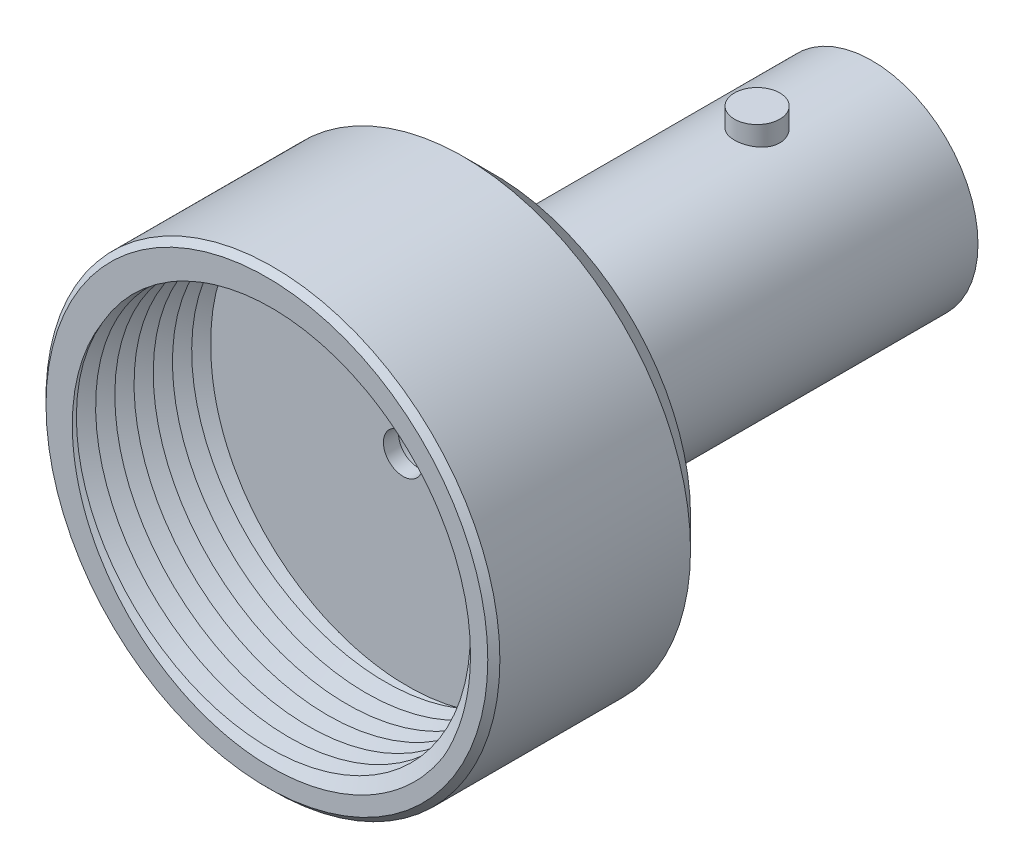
ISO-10303-21;
HEADER;
FILE_DESCRIPTION(('STEP AP214'),'2;1');
FILE_NAME('part.step','',(''),(''),'','','');
FILE_SCHEMA(('AUTOMOTIVE_DESIGN { 1 0 10303 214 1 1 1 1 }'));
ENDSEC;
DATA;
#1=APPLICATION_CONTEXT('core data for automotive mechanical design processes');
#2=APPLICATION_PROTOCOL_DEFINITION('international standard','automotive_design',2000,#1);
#3=PRODUCT_CONTEXT('',#1,'mechanical');
#4=PRODUCT('Part','Part','',(#3));
#5=PRODUCT_RELATED_PRODUCT_CATEGORY('part','',(#4));
#6=PRODUCT_DEFINITION_FORMATION('','',#4);
#7=PRODUCT_DEFINITION_CONTEXT('part definition',#1,'design');
#8=PRODUCT_DEFINITION('design','',#6,#7);
#9=PRODUCT_DEFINITION_SHAPE('','',#8);
#10=(LENGTH_UNIT() NAMED_UNIT(*) SI_UNIT(.MILLI.,.METRE.));
#11=(NAMED_UNIT(*) PLANE_ANGLE_UNIT() SI_UNIT($,.RADIAN.));
#12=(NAMED_UNIT(*) SI_UNIT($,.STERADIAN.) SOLID_ANGLE_UNIT());
#13=UNCERTAINTY_MEASURE_WITH_UNIT(LENGTH_MEASURE(1.E-05),#10,'distance_accuracy_value','');
#14=(GEOMETRIC_REPRESENTATION_CONTEXT(3) GLOBAL_UNCERTAINTY_ASSIGNED_CONTEXT((#13)) GLOBAL_UNIT_ASSIGNED_CONTEXT((#10,
#11,#12)) REPRESENTATION_CONTEXT('',''));
#15=CARTESIAN_POINT('',(0.,0.,0.));
#16=DIRECTION('',(0.,0.,1.));
#17=DIRECTION('',(1.,0.,0.));
#18=AXIS2_PLACEMENT_3D('',#15,#16,#17);
#19=CARTESIAN_POINT('',(0.,0.,7.5));
#20=DIRECTION('',(0.,0.,1.));
#21=DIRECTION('',(1.,0.,0.));
#22=AXIS2_PLACEMENT_3D('',#19,#20,#21);
#23=PLANE('',#22);
#24=CARTESIAN_POINT('',(0.,0.,7.5));
#25=DIRECTION('',(0.,0.,1.));
#26=DIRECTION('',(1.,0.,0.));
#27=AXIS2_PLACEMENT_3D('',#24,#25,#26);
#28=CIRCLE('',#27,7.3);
#29=CARTESIAN_POINT('',(7.3,0.,7.5));
#30=VERTEX_POINT('',#29);
#31=EDGE_CURVE('E169',#30,#30,#28,.T.);
#32=ORIENTED_EDGE('',*,*,#31,.T.);
#33=EDGE_LOOP('',(#32));
#34=FACE_BOUND('',#33,.T.);
#35=CARTESIAN_POINT('',(5.82689461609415,-3.51888450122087,7.5));
#36=CARTESIAN_POINT('',(5.71639534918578,-3.69299251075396,7.50000000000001));
#37=CARTESIAN_POINT('',(5.59793705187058,-3.86205147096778,7.5));
#38=CARTESIAN_POINT('',(5.34593809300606,-4.18906446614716,7.5));
#39=CARTESIAN_POINT('',(5.21236798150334,-4.34699580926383,7.49999999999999));
#40=CARTESIAN_POINT('',(4.9418295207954,-4.63882533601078,7.49999999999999));
#41=CARTESIAN_POINT('',(4.80584518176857,-4.77363717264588,7.5));
#42=CARTESIAN_POINT('',(4.52296335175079,-5.03137819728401,7.5));
#43=CARTESIAN_POINT('',(4.37606205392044,-5.15430320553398,7.5));
#44=CARTESIAN_POINT('',(4.07231217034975,-5.38743045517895,7.5));
#45=CARTESIAN_POINT('',(3.91545738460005,-5.49762464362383,7.5));
#46=CARTESIAN_POINT('',(3.67367855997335,-5.65267407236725,7.5));
#47=CARTESIAN_POINT('',(3.59199818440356,-5.70265270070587,7.5));
#48=CARTESIAN_POINT('',(3.42660815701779,-5.79913314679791,7.5));
#49=CARTESIAN_POINT('',(3.34289849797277,-5.84563495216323,7.5));
#50=CARTESIAN_POINT('',(3.08896328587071,-5.97960534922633,7.5));
#51=CARTESIAN_POINT('',(2.91581469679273,-6.06161406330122,7.5));
#52=CARTESIAN_POINT('',(2.56311691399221,-6.21040326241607,7.5));
#53=CARTESIAN_POINT('',(2.38356754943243,-6.27718334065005,7.5));
#54=CARTESIAN_POINT('',(2.01945653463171,-6.39500357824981,7.5));
#55=CARTESIAN_POINT('',(1.83489711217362,-6.44605061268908,7.5));
#56=CARTESIAN_POINT('',(1.46200376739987,-6.5320756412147,7.5));
#57=CARTESIAN_POINT('',(1.27366855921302,-6.56704806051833,7.5));
#58=CARTESIAN_POINT('',(0.898882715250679,-6.62004509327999,7.5));
#59=CARTESIAN_POINT('',(0.71248260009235,-6.63842761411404,7.5));
#60=CARTESIAN_POINT('',(0.338796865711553,-6.65942358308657,7.5));
#61=CARTESIAN_POINT('',(0.151511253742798,-6.66203716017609,7.5));
#62=CARTESIAN_POINT('',(-0.222660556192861,-6.65147527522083,7.5));
#63=CARTESIAN_POINT('',(-0.409546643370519,-6.63829589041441,7.5));
#64=CARTESIAN_POINT('',(-0.781479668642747,-6.59624265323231,7.5));
#65=CARTESIAN_POINT('',(-0.966527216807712,-6.56737419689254,7.5));
#66=CARTESIAN_POINT('',(-1.33353978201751,-6.49415038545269,7.5));
#67=CARTESIAN_POINT('',(-1.51550467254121,-6.44979439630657,7.5));
#68=CARTESIAN_POINT('',(-1.87505525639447,-6.34591052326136,7.5));
#69=CARTESIAN_POINT('',(-2.05264089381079,-6.28638244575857,7.5));
#70=CARTESIAN_POINT('',(-2.40215517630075,-6.15258118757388,7.5));
#71=CARTESIAN_POINT('',(-2.57408396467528,-6.07830838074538,7.5));
#72=CARTESIAN_POINT('',(-2.91109931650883,-5.91554151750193,7.5));
#73=CARTESIAN_POINT('',(-3.07618590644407,-5.82704751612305,7.5));
#74=CARTESIAN_POINT('',(-3.31782278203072,-5.68405986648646,7.5));
#75=CARTESIAN_POINT('',(-3.3974211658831,-5.63465280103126,7.5));
#76=CARTESIAN_POINT('',(-3.55439504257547,-5.53243761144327,7.5));
#77=CARTESIAN_POINT('',(-3.63177070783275,-5.47962975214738,7.5));
#78=CARTESIAN_POINT('',(-3.86036592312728,-5.31627070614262,7.5));
#79=CARTESIAN_POINT('',(-4.0080879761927,-5.20076376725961,7.5));
#80=CARTESIAN_POINT('',(-4.29296639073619,-4.95746709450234,7.5));
#81=CARTESIAN_POINT('',(-4.43012456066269,-4.82967947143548,7.5));
#82=CARTESIAN_POINT('',(-4.6929112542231,-4.5627411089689,7.5));
#83=CARTESIAN_POINT('',(-4.81853969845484,-4.42359029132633,7.5));
#84=CARTESIAN_POINT('',(-5.05456922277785,-4.13829400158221,7.5));
#85=CARTESIAN_POINT('',(-5.1652542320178,-3.99238324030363,7.5));
#86=CARTESIAN_POINT('',(-5.37392749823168,-3.69175285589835,7.5));
#87=CARTESIAN_POINT('',(-5.47191610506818,-3.53703347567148,7.5));
#88=CARTESIAN_POINT('',(-5.6545121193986,-3.21986516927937,7.5));
#89=CARTESIAN_POINT('',(-5.73911785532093,-3.05741528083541,7.5));
#90=CARTESIAN_POINT('',(-5.8943295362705,-2.72596403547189,7.5));
#91=CARTESIAN_POINT('',(-5.96493579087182,-2.55696282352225,7.5));
#92=CARTESIAN_POINT('',(-6.09159604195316,-2.21375053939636,7.5));
#93=CARTESIAN_POINT('',(-6.1476619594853,-2.03954386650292,7.5));
#94=CARTESIAN_POINT('',(-6.24491902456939,-1.68702659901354,7.5));
#95=CARTESIAN_POINT('',(-6.28611014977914,-1.50871599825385,7.5));
#96=CARTESIAN_POINT('',(-6.35332612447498,-1.14926101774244,7.5));
#97=CARTESIAN_POINT('',(-6.37935121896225,-0.968116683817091,7.5));
#98=CARTESIAN_POINT('',(-6.41604638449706,-0.604281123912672,7.5));
#99=CARTESIAN_POINT('',(-6.4267163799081,-0.421589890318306,7.5));
#100=CARTESIAN_POINT('',(-6.43265030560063,-0.0557395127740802,7.5));
#101=CARTESIAN_POINT('',(-6.42789656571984,0.127419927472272,7.5));
#102=CARTESIAN_POINT('',(-6.40254572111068,0.492646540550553,7.5));
#103=CARTESIAN_POINT('',(-6.38194838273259,0.674713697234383,7.5));
#104=CARTESIAN_POINT('',(-6.32513756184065,1.03627323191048,7.5));
#105=CARTESIAN_POINT('',(-6.28893472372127,1.21576727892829,7.5));
#106=CARTESIAN_POINT('',(-6.20117818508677,1.57096799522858,7.5));
#107=CARTESIAN_POINT('',(-6.14962156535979,1.74667393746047,7.5));
#108=CARTESIAN_POINT('',(-6.00898286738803,2.15904693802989,7.5));
#109=CARTESIAN_POINT('',(-5.91308732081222,2.39344614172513,7.5));
#110=CARTESIAN_POINT('',(-5.74896679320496,2.73495120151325,7.5));
#111=CARTESIAN_POINT('',(-5.69090481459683,2.84706561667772,7.5));
#112=CARTESIAN_POINT('',(-5.5681928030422,3.06766367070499,7.5));
#113=CARTESIAN_POINT('',(-5.50354122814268,3.1761464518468,7.5));
#114=CARTESIAN_POINT('',(-5.43569572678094,3.2826379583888,7.5));
#115=B_SPLINE_CURVE_WITH_KNOTS('',3,(#35,#36,#37,#38,#39,#40,#41,#42,#43,#44,#45,#46,#47,#48,
#49,#50,#51,#52,#53,#54,#55,#56,#57,#58,#59,#60,#61,#62,#63,#64,#65,#66,#67,#68,#69,#70,#71,#72,
#73,#74,#75,#76,#77,#78,#79,#80,#81,#82,#83,#84,#85,#86,#87,#88,#89,#90,#91,#92,#93,#94,#95,#96,
#97,#98,#99,#100,#101,#102,#103,#104,#105,#106,#107,#108,#109,#110,#111,#112,#113,#114),
.UNSPECIFIED.,.F.,.F.,(4,2,2,2,2,2,2,2,2,2,2,2,2,2,2,2,2,2,2,2,2,2,2,2,2,2,2,2,2,2,2,2,2,2,2,2,
2,2,2,4),(0.,0.618433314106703,1.2380932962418,1.81186874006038,2.38584521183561,
2.96018279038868,3.24738309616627,3.53458442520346,4.10857182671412,4.6825745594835,
5.25632610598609,5.83027648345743,6.39152609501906,6.95277111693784,7.51415557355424,
8.07534707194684,8.63656154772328,9.19778318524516,9.75899059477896,10.3201958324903,
10.601177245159,10.8821368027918,11.443936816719,12.0056404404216,12.5673479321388,
13.1161268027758,13.6648905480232,14.2137227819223,14.7625428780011,15.310911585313,
15.8592811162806,16.4076417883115,16.9560051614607,17.5049969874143,18.0539969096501,
18.6026229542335,19.1513533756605,19.9090626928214,20.2876465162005,20.6663191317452),.UNSPECIFIED.);
#116=CARTESIAN_POINT('',(5.82689461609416,-3.51888450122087,7.5));
#117=VERTEX_POINT('',#116);
#118=CARTESIAN_POINT('',(-5.43569572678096,3.28263795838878,7.5));
#119=VERTEX_POINT('',#118);
#120=EDGE_CURVE('E96',#117,#119,#115,.T.);
#121=ORIENTED_EDGE('',*,*,#120,.T.);
#122=CARTESIAN_POINT('',(-5.43569572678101,3.28263795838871,7.5));
#123=CARTESIAN_POINT('',(-5.33327802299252,3.4618783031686,7.5));
#124=CARTESIAN_POINT('',(-5.22204531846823,3.63609217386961,7.5));
#125=CARTESIAN_POINT('',(-4.98298403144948,3.97311566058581,7.5));
#126=CARTESIAN_POINT('',(-4.85513167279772,4.13590841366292,7.5));
#127=CARTESIAN_POINT('',(-4.60277114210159,4.42676976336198,7.5));
#128=CARTESIAN_POINT('',(-4.48021423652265,4.55653705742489,7.5));
#129=CARTESIAN_POINT('',(-4.22461981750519,4.80528435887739,7.5));
#130=CARTESIAN_POINT('',(-4.09158309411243,4.92426517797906,7.5));
#131=CARTESIAN_POINT('',(-3.81582519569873,5.15071054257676,7.5));
#132=CARTESIAN_POINT('',(-3.67309573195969,5.25816502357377,7.5));
#133=CARTESIAN_POINT('',(-3.45263593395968,5.41001357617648,7.5));
#134=CARTESIAN_POINT('',(-3.37808280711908,5.45907742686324,7.5));
#135=CARTESIAN_POINT('',(-3.22696944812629,5.55402199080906,7.5));
#136=CARTESIAN_POINT('',(-3.15040906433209,5.59990246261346,7.5));
#137=CARTESIAN_POINT('',(-2.91792882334,5.73280196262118,7.5));
#138=CARTESIAN_POINT('',(-2.75924800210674,5.81505291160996,7.5));
#139=CARTESIAN_POINT('',(-2.43566673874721,5.96619148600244,7.5));
#140=CARTESIAN_POINT('',(-2.27076626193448,6.03507903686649,7.5));
#141=CARTESIAN_POINT('',(-1.93584784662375,6.159046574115,7.5));
#142=CARTESIAN_POINT('',(-1.76582989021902,6.21412651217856,7.5));
#143=CARTESIAN_POINT('',(-1.42183675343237,6.31009745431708,7.5));
#144=CARTESIAN_POINT('',(-1.24786154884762,6.35098837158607,7.5));
#145=CARTESIAN_POINT('',(-0.893110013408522,6.41907653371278,7.5));
#146=CARTESIAN_POINT('',(-0.712269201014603,6.44593835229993,7.5));
#147=CARTESIAN_POINT('',(-0.348903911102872,6.4843395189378,7.5));
#148=CARTESIAN_POINT('',(-0.16637885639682,6.49587340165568,7.5));
#149=CARTESIAN_POINT('',(0.198950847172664,6.50351846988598,7.5));
#150=CARTESIAN_POINT('',(0.381755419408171,6.49963331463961,7.5));
#151=CARTESIAN_POINT('',(0.746387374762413,6.47647611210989,7.5));
#152=CARTESIAN_POINT('',(0.928214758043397,6.45720406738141,7.5));
#153=CARTESIAN_POINT('',(1.2896176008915,6.40340794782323,7.5));
#154=CARTESIAN_POINT('',(1.4691928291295,6.36888231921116,7.5));
#155=CARTESIAN_POINT('',(1.82473598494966,6.28483832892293,7.5));
#156=CARTESIAN_POINT('',(2.00070513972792,6.235325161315,7.5));
#157=CARTESIAN_POINT('',(2.3478790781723,6.12164563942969,7.5));
#158=CARTESIAN_POINT('',(2.51908284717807,6.05747619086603,7.5));
#159=CARTESIAN_POINT('',(2.8554988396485,5.91493452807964,7.5));
#160=CARTESIAN_POINT('',(3.02071107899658,5.83656235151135,7.49999999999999));
#161=CARTESIAN_POINT('',(3.26302768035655,5.70883017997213,7.5));
#162=CARTESIAN_POINT('',(3.34286012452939,5.66457172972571,7.5));
#163=CARTESIAN_POINT('',(3.50064129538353,5.57281778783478,7.5));
#164=CARTESIAN_POINT('',(3.57859003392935,5.52532231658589,7.5));
#165=CARTESIAN_POINT('',(3.80939998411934,5.37807990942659,7.5));
#166=CARTESIAN_POINT('',(3.95925504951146,5.27356108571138,7.5));
#167=CARTESIAN_POINT('',(4.24986202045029,5.0525529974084,7.5));
#168=CARTESIAN_POINT('',(4.39061277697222,4.93606222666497,7.5));
#169=CARTESIAN_POINT('',(4.66205744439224,4.69189595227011,7.5));
#170=CARTESIAN_POINT('',(4.79275147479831,4.56422058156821,7.5));
#171=CARTESIAN_POINT('',(5.04603145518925,4.29554072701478,7.5));
#172=CARTESIAN_POINT('',(5.16836670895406,4.15429983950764,7.5));
#173=CARTESIAN_POINT('',(5.40076630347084,3.86197211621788,7.5));
#174=CARTESIAN_POINT('',(5.51082592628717,3.71088152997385,7.5));
#175=CARTESIAN_POINT('',(5.71780047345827,3.40003351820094,7.5));
#176=CARTESIAN_POINT('',(5.81472038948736,3.24027941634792,7.5));
#177=CARTESIAN_POINT('',(5.9948081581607,2.91312914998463,7.5));
#178=CARTESIAN_POINT('',(6.07797136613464,2.74573042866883,7.49999999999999));
#179=CARTESIAN_POINT('',(6.23000198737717,2.40433672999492,7.49999999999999));
#180=CARTESIAN_POINT('',(6.29885319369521,2.23033453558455,7.5));
#181=CARTESIAN_POINT('',(6.42165210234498,1.87714814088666,7.5));
#182=CARTESIAN_POINT('',(6.47559991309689,1.69796397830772,7.5));
#183=CARTESIAN_POINT('',(6.56821988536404,1.3356549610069,7.5));
#184=CARTESIAN_POINT('',(6.60688870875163,1.15252925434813,7.5));
#185=CARTESIAN_POINT('',(6.66864304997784,0.783744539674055,7.5));
#186=CARTESIAN_POINT('',(6.69173681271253,0.598086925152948,7.5));
#187=CARTESIAN_POINT('',(6.71459251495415,0.318705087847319,7.5));
#188=CARTESIAN_POINT('',(6.72024692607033,0.225428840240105,7.5));
#189=CARTESIAN_POINT('',(6.72761662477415,0.0387379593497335,7.5));
#190=CARTESIAN_POINT('',(6.72933260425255,-0.0546766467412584,7.5));
#191=CARTESIAN_POINT('',(6.72871381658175,-0.334930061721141,7.5));
#192=CARTESIAN_POINT('',(6.72061311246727,-0.521788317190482,7.5));
#193=CARTESIAN_POINT('',(6.68905327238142,-0.894188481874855,7.5));
#194=CARTESIAN_POINT('',(6.66559334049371,-1.07973032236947,7.5));
#195=CARTESIAN_POINT('',(6.60348399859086,-1.44823893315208,7.5));
#196=CARTESIAN_POINT('',(6.56483695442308,-1.63120609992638,7.5));
#197=CARTESIAN_POINT('',(6.48071950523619,-1.96152181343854,7.5));
#198=CARTESIAN_POINT('',(6.43763812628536,-2.10948432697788,7.5));
#199=CARTESIAN_POINT('',(6.34153311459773,-2.40214443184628,7.5));
#200=CARTESIAN_POINT('',(6.28850988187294,-2.54684215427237,7.5));
#201=CARTESIAN_POINT('',(6.17283053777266,-2.83213604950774,7.5));
#202=CARTESIAN_POINT('',(6.11018573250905,-2.97273680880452,7.5));
#203=CARTESIAN_POINT('',(5.97550721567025,-3.24938843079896,7.5));
#204=CARTESIAN_POINT('',(5.90347235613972,-3.38543873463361,7.5));
#205=CARTESIAN_POINT('',(5.82689461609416,-3.51888450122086,7.5));
#206=B_SPLINE_CURVE_WITH_KNOTS('',3,(#122,#123,#124,#125,#126,#127,#128,#129,#130,#131,#132,
#133,#134,#135,#136,#137,#138,#139,#140,#141,#142,#143,#144,#145,#146,#147,#148,#149,#150,#151,
#152,#153,#154,#155,#156,#157,#158,#159,#160,#161,#162,#163,#164,#165,#166,#167,#168,#169,#170,
#171,#172,#173,#174,#175,#176,#177,#178,#179,#180,#181,#182,#183,#184,#185,#186,#187,#188,#189,
#190,#191,#192,#193,#194,#195,#196,#197,#198,#199,#200,#201,#202,#203,#204,#205),.UNSPECIFIED.,
.F.,.F.,(4,2,2,2,2,2,2,2,2,2,2,2,2,2,2,2,2,2,2,2,2,2,2,2,2,2,2,2,2,2,2,2,2,2,2,2,2,2,2,2,2,4),
(0.,0.61909076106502,1.23907714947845,1.77393469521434,2.30875195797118,2.84403247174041,
3.11171125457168,3.37941031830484,3.91494673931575,4.45048614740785,4.98602742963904,
5.52157198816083,6.06939419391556,6.61741167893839,7.16529911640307,7.71318646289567,
8.26112963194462,8.80888312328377,9.35675236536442,9.90462015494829,10.1783921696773,
10.4521624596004,10.9996011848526,11.5471088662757,12.0946100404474,12.6545120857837,
13.2146285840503,13.7745316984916,14.3346234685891,14.8953460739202,15.4560645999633,
16.0169055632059,16.5774494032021,16.8577197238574,17.1379408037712,17.6983534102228,
18.2587950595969,18.819149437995,19.2811289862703,19.7430899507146,20.2045121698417,
20.6659908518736),.UNSPECIFIED.);
#207=EDGE_CURVE('E104',#119,#117,#206,.T.);
#208=ORIENTED_EDGE('',*,*,#207,.T.);
#209=EDGE_LOOP('',(#121,#208));
#210=FACE_BOUND('',#209,.T.);
#211=ADVANCED_FACE('F36',(#34,#210),#23,.T.);
#212=CARTESIAN_POINT('',(0.,0.,-12.5));
#213=DIRECTION('',(0.,0.,1.));
#214=DIRECTION('',(1.,0.,0.));
#215=AXIS2_PLACEMENT_3D('',#212,#213,#214);
#216=CYLINDRICAL_SURFACE('',#215,3.5);
#217=CARTESIAN_POINT('',(0.,0.,0.));
#218=DIRECTION('',(0.,0.,1.));
#219=DIRECTION('',(1.,0.,0.));
#220=AXIS2_PLACEMENT_3D('',#217,#218,#219);
#221=CIRCLE('',#220,3.5);
#222=CARTESIAN_POINT('',(3.5,0.,0.));
#223=VERTEX_POINT('',#222);
#224=EDGE_CURVE('E187',#223,#223,#221,.F.);
#225=ORIENTED_EDGE('',*,*,#224,.T.);
#226=EDGE_LOOP('',(#225));
#227=FACE_BOUND('',#226,.T.);
#228=CARTESIAN_POINT('',(0.,0.,-12.5));
#229=DIRECTION('',(0.,0.,-1.));
#230=DIRECTION('',(-1.,0.,0.));
#231=AXIS2_PLACEMENT_3D('',#228,#229,#230);
#232=CIRCLE('',#231,3.5);
#233=CARTESIAN_POINT('',(-3.44818792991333,0.6,-12.5));
#234=VERTEX_POINT('',#233);
#235=CARTESIAN_POINT('',(-3.44818792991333,-0.6,-12.5));
#236=VERTEX_POINT('',#235);
#237=EDGE_CURVE('E172',#234,#236,#232,.T.);
#238=ORIENTED_EDGE('',*,*,#237,.F.);
#239=DIRECTION('',(0.,0.,1.));
#240=VECTOR('',#239,1.);
#241=CARTESIAN_POINT('',(-3.44818792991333,0.6,-12.5));
#242=LINE('',#241,#240);
#243=CARTESIAN_POINT('',(-3.44818792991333,0.6,-5.9));
#244=VERTEX_POINT('',#243);
#245=EDGE_CURVE('E234',#234,#244,#242,.T.);
#246=ORIENTED_EDGE('',*,*,#245,.T.);
#247=CARTESIAN_POINT('',(-3.44818792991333,0.6,-5.9));
#248=CARTESIAN_POINT('',(-3.44816884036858,0.600029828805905,-5.86650812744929));
#249=CARTESIAN_POINT('',(-3.44867537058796,0.597197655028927,-5.83303047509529));
#250=CARTESIAN_POINT('',(-3.45059687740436,0.586036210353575,-5.76707543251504));
#251=CARTESIAN_POINT('',(-3.45201063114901,0.577714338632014,-5.73459675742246));
#252=CARTESIAN_POINT('',(-3.45560487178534,0.555797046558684,-5.67150993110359));
#253=CARTESIAN_POINT('',(-3.45778551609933,0.542200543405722,-5.64090216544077));
#254=CARTESIAN_POINT('',(-3.46266104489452,0.510139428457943,-5.58239983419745));
#255=CARTESIAN_POINT('',(-3.46535594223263,0.491674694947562,-5.55450533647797));
#256=CARTESIAN_POINT('',(-3.47098880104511,0.450196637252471,-5.50193666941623));
#257=CARTESIAN_POINT('',(-3.47392877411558,0.42714295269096,-5.47729455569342));
#258=CARTESIAN_POINT('',(-3.47970261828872,0.377226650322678,-5.4322058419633));
#259=CARTESIAN_POINT('',(-3.4825364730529,0.3503634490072,-5.41175988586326));
#260=CARTESIAN_POINT('',(-3.48780010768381,0.293381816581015,-5.37552491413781));
#261=CARTESIAN_POINT('',(-3.49022722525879,0.263243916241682,-5.35976609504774));
#262=CARTESIAN_POINT('',(-3.49438116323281,0.20070183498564,-5.33354770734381));
#263=CARTESIAN_POINT('',(-3.49610807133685,0.168297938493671,-5.32308747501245));
#264=CARTESIAN_POINT('',(-3.49865290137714,0.102476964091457,-5.30786117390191));
#265=CARTESIAN_POINT('',(-3.49947951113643,0.0690728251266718,-5.30304064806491));
#266=CARTESIAN_POINT('',(-3.50016048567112,0.00191953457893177,-5.29906115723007));
#267=CARTESIAN_POINT('',(-3.50001489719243,-0.0318296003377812,-5.29990192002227));
#268=CARTESIAN_POINT('',(-3.49877470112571,-0.0983405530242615,-5.30717903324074));
#269=CARTESIAN_POINT('',(-3.49769006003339,-0.131109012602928,-5.31355662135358));
#270=CARTESIAN_POINT('',(-3.49470476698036,-0.195103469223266,-5.33163369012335));
#271=CARTESIAN_POINT('',(-3.49280409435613,-0.22632942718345,-5.34333330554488));
#272=CARTESIAN_POINT('',(-3.48838335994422,-0.286527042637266,-5.37178040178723));
#273=CARTESIAN_POINT('',(-3.48586034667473,-0.315487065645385,-5.38855202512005));
#274=CARTESIAN_POINT('',(-3.4804750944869,-0.370202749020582,-5.42664876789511));
#275=CARTESIAN_POINT('',(-3.47761283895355,-0.395958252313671,-5.44797411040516));
#276=CARTESIAN_POINT('',(-3.47182404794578,-0.443879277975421,-5.49489515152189));
#277=CARTESIAN_POINT('',(-3.46889715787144,-0.46599500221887,-5.52054168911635));
#278=CARTESIAN_POINT('',(-3.46334324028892,-0.505623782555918,-5.5752162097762));
#279=CARTESIAN_POINT('',(-3.46071629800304,-0.523135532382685,-5.60424514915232));
#280=CARTESIAN_POINT('',(-3.45605905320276,-0.553070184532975,-5.66492412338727));
#281=CARTESIAN_POINT('',(-3.45402983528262,-0.5654838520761,-5.69657879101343));
#282=CARTESIAN_POINT('',(-3.45081478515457,-0.584786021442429,-5.76154516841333));
#283=CARTESIAN_POINT('',(-3.44962769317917,-0.591682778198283,-5.79485432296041));
#284=CARTESIAN_POINT('',(-3.44868314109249,-0.597147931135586,-5.8403487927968));
#285=CARTESIAN_POINT('',(-3.44849760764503,-0.598217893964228,-5.8522637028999));
#286=CARTESIAN_POINT('',(-3.44825012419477,-0.599643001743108,-5.87611733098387));
#287=CARTESIAN_POINT('',(-3.4481879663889,-0.599999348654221,-5.88805597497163));
#288=CARTESIAN_POINT('',(-3.44818792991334,-0.600000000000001,-5.9));
#289=B_SPLINE_CURVE_WITH_KNOTS('',3,(#247,#248,#249,#250,#251,#252,#253,#254,#255,#256,#257,
#258,#259,#260,#261,#262,#263,#264,#265,#266,#267,#268,#269,#270,#271,#272,#273,#274,#275,#276,
#277,#278,#279,#280,#281,#282,#283,#284,#285,#286,#287,#288),.UNSPECIFIED.,.F.,.F.,(4,2,2,2,2,2,
2,2,2,2,2,2,2,2,2,2,2,2,2,2,4),(0.,0.100330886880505,0.200526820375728,0.300743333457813,
0.400962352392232,0.502105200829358,0.603263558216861,0.70506016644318,0.806844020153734,
0.907636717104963,1.00842456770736,1.10815565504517,1.20788926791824,1.30810528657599,
1.40832621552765,1.50982116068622,1.61134487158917,1.71305168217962,1.81460602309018,
1.8504823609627,1.88629822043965),.UNSPECIFIED.);
#290=CARTESIAN_POINT('',(-3.44818792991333,-0.6,-5.9));
#291=VERTEX_POINT('',#290);
#292=EDGE_CURVE('E226',#244,#291,#289,.T.);
#293=ORIENTED_EDGE('',*,*,#292,.T.);
#294=DIRECTION('',(0.,0.,1.));
#295=VECTOR('',#294,1.);
#296=CARTESIAN_POINT('',(-3.44818792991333,-0.6,-12.5));
#297=LINE('',#296,#295);
#298=EDGE_CURVE('E489',#291,#236,#297,.F.);
#299=ORIENTED_EDGE('',*,*,#298,.T.);
#300=EDGE_LOOP('',(#238,#246,#293,#299));
#301=FACE_BOUND('',#300,.T.);
#302=CARTESIAN_POINT('',(0.,3.5,-7.95));
#303=CARTESIAN_POINT('',(0.0416179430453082,3.49999923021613,-7.95000144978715));
#304=CARTESIAN_POINT('',(0.0832535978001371,3.49925012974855,-7.95347580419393));
#305=CARTESIAN_POINT('',(0.165343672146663,3.49633414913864,-7.9672678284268));
#306=CARTESIAN_POINT('',(0.205797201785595,3.4941662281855,-7.97759052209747));
#307=CARTESIAN_POINT('',(0.284324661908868,3.48865415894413,-8.00474218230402));
#308=CARTESIAN_POINT('',(0.322400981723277,3.48531121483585,-8.02156448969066));
#309=CARTESIAN_POINT('',(0.395189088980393,3.47781053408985,-8.06121704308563));
#310=CARTESIAN_POINT('',(0.429900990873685,3.4736528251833,-8.08404708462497));
#311=CARTESIAN_POINT('',(0.495512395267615,3.46490684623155,-8.13544014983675));
#312=CARTESIAN_POINT('',(0.526352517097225,3.4603134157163,-8.16407811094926));
#313=CARTESIAN_POINT('',(0.582830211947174,3.45125034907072,-8.2261131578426));
#314=CARTESIAN_POINT('',(0.608467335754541,3.44678072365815,-8.25951065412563));
#315=CARTESIAN_POINT('',(0.654071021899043,3.43842058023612,-8.33055287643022));
#316=CARTESIAN_POINT('',(0.673974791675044,3.4345366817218,-8.36823875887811));
#317=CARTESIAN_POINT('',(0.707144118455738,3.42786162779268,-8.44651722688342));
#318=CARTESIAN_POINT('',(0.720410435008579,3.42507034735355,-8.48710947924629));
#319=CARTESIAN_POINT('',(0.739732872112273,3.42094904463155,-8.56940554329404));
#320=CARTESIAN_POINT('',(0.745893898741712,3.41959778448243,-8.61108363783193));
#321=CARTESIAN_POINT('',(0.751156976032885,3.41844569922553,-8.6949021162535));
#322=CARTESIAN_POINT('',(0.750259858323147,3.41864469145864,-8.73704244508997));
#323=CARTESIAN_POINT('',(0.741516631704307,3.42055138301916,-8.8198123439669));
#324=CARTESIAN_POINT('',(0.733791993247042,3.42223270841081,-8.86045544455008));
#325=CARTESIAN_POINT('',(0.711805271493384,3.42687296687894,-8.93985512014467));
#326=CARTESIAN_POINT('',(0.697542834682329,3.42983196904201,-8.97861159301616));
#327=CARTESIAN_POINT('',(0.662772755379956,3.43672040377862,-9.05348143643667));
#328=CARTESIAN_POINT('',(0.642218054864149,3.44065710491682,-9.08957225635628));
#329=CARTESIAN_POINT('',(0.595480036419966,3.44905286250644,-9.15783758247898));
#330=CARTESIAN_POINT('',(0.569295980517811,3.45351198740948,-9.1900115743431));
#331=CARTESIAN_POINT('',(0.511397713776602,3.46256359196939,-9.2502296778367));
#332=CARTESIAN_POINT('',(0.479580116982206,3.46715691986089,-9.27817435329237));
#333=CARTESIAN_POINT('',(0.411658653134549,3.4758750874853,-9.32834686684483));
#334=CARTESIAN_POINT('',(0.3755547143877,3.47999991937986,-9.3505746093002));
#335=CARTESIAN_POINT('',(0.29996673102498,3.48732889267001,-9.38870533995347));
#336=CARTESIAN_POINT('',(0.260476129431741,3.49053119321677,-9.40459570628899));
#337=CARTESIAN_POINT('',(0.179301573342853,3.49564054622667,-9.42948782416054));
#338=CARTESIAN_POINT('',(0.137617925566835,3.49754777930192,-9.43849053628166));
#339=CARTESIAN_POINT('',(0.0540938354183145,3.49982653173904,-9.44920810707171));
#340=CARTESIAN_POINT('',(0.0122715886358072,3.50022668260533,-9.45105885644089));
#341=CARTESIAN_POINT('',(-0.0710844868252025,3.49952624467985,-9.44778771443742));
#342=CARTESIAN_POINT('',(-0.112618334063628,3.49842575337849,-9.44266627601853));
#343=CARTESIAN_POINT('',(-0.193771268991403,3.49486571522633,-9.42570887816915));
#344=CARTESIAN_POINT('',(-0.233405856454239,3.4924205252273,-9.41394381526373));
#345=CARTESIAN_POINT('',(-0.310139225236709,3.48644462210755,-9.38411152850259));
#346=CARTESIAN_POINT('',(-0.34723779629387,3.48291381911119,-9.36604378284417));
#347=CARTESIAN_POINT('',(-0.418410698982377,3.475087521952,-9.32383322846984));
#348=CARTESIAN_POINT('',(-0.45243628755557,3.47078215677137,-9.29961010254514));
#349=CARTESIAN_POINT('',(-0.515988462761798,3.46190516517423,-9.24588258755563));
#350=CARTESIAN_POINT('',(-0.545514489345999,3.45733350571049,-9.21637754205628));
#351=CARTESIAN_POINT('',(-0.599763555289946,3.44834086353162,-9.15230131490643));
#352=CARTESIAN_POINT('',(-0.624392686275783,3.44392396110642,-9.11764995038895));
#353=CARTESIAN_POINT('',(-0.667482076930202,3.4358332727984,-9.044622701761));
#354=CARTESIAN_POINT('',(-0.685942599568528,3.43215945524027,-9.00624697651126));
#355=CARTESIAN_POINT('',(-0.716048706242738,3.42600504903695,-8.9270638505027));
#356=CARTESIAN_POINT('',(-0.727731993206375,3.42351787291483,-8.88627132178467));
#357=CARTESIAN_POINT('',(-0.744063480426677,3.42000593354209,-8.80324220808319));
#358=CARTESIAN_POINT('',(-0.748712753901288,3.41898094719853,-8.76100584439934));
#359=CARTESIAN_POINT('',(-0.750799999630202,3.41852309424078,-8.67723382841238));
#360=CARTESIAN_POINT('',(-0.748386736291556,3.41905738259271,-8.63570199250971));
#361=CARTESIAN_POINT('',(-0.736748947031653,3.42158381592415,-8.55365137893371));
#362=CARTESIAN_POINT('',(-0.727524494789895,3.42357594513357,-8.51313259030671));
#363=CARTESIAN_POINT('',(-0.702596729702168,3.42877790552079,-8.43437067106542));
#364=CARTESIAN_POINT('',(-0.686914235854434,3.43198382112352,-8.39612067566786));
#365=CARTESIAN_POINT('',(-0.649533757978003,3.43925382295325,-8.32277231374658));
#366=CARTESIAN_POINT('',(-0.627835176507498,3.44331799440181,-8.28767426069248));
#367=CARTESIAN_POINT('',(-0.578541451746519,3.45194527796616,-8.22089090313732));
#368=CARTESIAN_POINT('',(-0.550839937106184,3.45651654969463,-8.18928515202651));
#369=CARTESIAN_POINT('',(-0.490543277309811,3.46558724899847,-8.13112186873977));
#370=CARTESIAN_POINT('',(-0.457947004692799,3.47008665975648,-8.1045655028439));
#371=CARTESIAN_POINT('',(-0.388301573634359,3.47857245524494,-8.05694202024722));
#372=CARTESIAN_POINT('',(-0.351202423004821,3.48255182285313,-8.03594669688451));
#373=CARTESIAN_POINT('',(-0.2739250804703,3.48947913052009,-8.00052273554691));
#374=CARTESIAN_POINT('',(-0.233749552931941,3.49242795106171,-7.98608848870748));
#375=CARTESIAN_POINT('',(-0.161267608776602,3.49642424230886,-7.96682390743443));
#376=CARTESIAN_POINT('',(-0.12935860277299,3.49775695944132,-7.96052678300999));
#377=CARTESIAN_POINT('',(-0.0649699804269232,3.4995451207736,-7.95211434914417));
#378=CARTESIAN_POINT('',(-0.0324903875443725,3.50000060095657,-7.94999886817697));
#379=CARTESIAN_POINT('',(0.,3.5,-7.95));
#380=B_SPLINE_CURVE_WITH_KNOTS('',3,(#302,#303,#304,#305,#306,#307,#308,#309,#310,#311,#312,
#313,#314,#315,#316,#317,#318,#319,#320,#321,#322,#323,#324,#325,#326,#327,#328,#329,#330,#331,
#332,#333,#334,#335,#336,#337,#338,#339,#340,#341,#342,#343,#344,#345,#346,#347,#348,#349,#350,
#351,#352,#353,#354,#355,#356,#357,#358,#359,#360,#361,#362,#363,#364,#365,#366,#367,#368,#369,
#370,#371,#372,#373,#374,#375,#376,#377,#378,#379),.UNSPECIFIED.,.T.,.F.,(4,2,2,2,2,2,2,2,2,2,2,
2,2,2,2,2,2,2,2,2,2,2,2,2,2,2,2,2,2,2,2,2,2,2,2,2,2,2,4),(0.,0.124734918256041,
0.249561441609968,0.374260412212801,0.498955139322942,0.62537480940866,0.751805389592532,
0.879572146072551,1.00732427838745,1.13316504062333,1.25899097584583,1.38262237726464,
1.50626046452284,1.63084678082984,1.75544943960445,1.88263505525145,2.00982279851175,
2.13726260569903,2.26468463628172,2.38967332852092,2.51465390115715,2.63832530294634,
2.76200694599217,2.88739366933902,3.01279598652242,3.14041031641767,3.26801920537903,
3.39491120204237,3.52178383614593,3.64600340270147,3.77022162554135,3.89404249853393,
4.01787567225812,4.14411475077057,4.27038295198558,4.39820955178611,4.52592667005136,
4.62330899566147,4.72068732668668),.UNSPECIFIED.);
#381=CARTESIAN_POINT('',(0.,3.5,-7.95));
#382=VERTEX_POINT('',#381);
#383=EDGE_CURVE('E278',#382,#382,#380,.T.);
#384=ORIENTED_EDGE('',*,*,#383,.F.);
#385=EDGE_LOOP('',(#384));
#386=FACE_BOUND('',#385,.T.);
#387=CARTESIAN_POINT('',(0.,-3.5,-9.45));
#388=CARTESIAN_POINT('',(0.0416179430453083,-3.49999923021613,-9.44999855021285));
#389=CARTESIAN_POINT('',(0.0832535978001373,-3.49925012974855,-9.44652419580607));
#390=CARTESIAN_POINT('',(0.165343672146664,-3.49633414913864,-9.4327321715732));
#391=CARTESIAN_POINT('',(0.205797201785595,-3.4941662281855,-9.42240947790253));
#392=CARTESIAN_POINT('',(0.284324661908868,-3.48865415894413,-9.39525781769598));
#393=CARTESIAN_POINT('',(0.322400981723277,-3.48531121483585,-9.37843551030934));
#394=CARTESIAN_POINT('',(0.395189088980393,-3.47781053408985,-9.33878295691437));
#395=CARTESIAN_POINT('',(0.429900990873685,-3.4736528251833,-9.31595291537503));
#396=CARTESIAN_POINT('',(0.495512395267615,-3.46490684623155,-9.26455985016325));
#397=CARTESIAN_POINT('',(0.526352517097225,-3.4603134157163,-9.23592188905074));
#398=CARTESIAN_POINT('',(0.582830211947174,-3.45125034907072,-9.1738868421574));
#399=CARTESIAN_POINT('',(0.608467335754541,-3.44678072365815,-9.14048934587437));
#400=CARTESIAN_POINT('',(0.654071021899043,-3.43842058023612,-9.06944712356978));
#401=CARTESIAN_POINT('',(0.673974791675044,-3.4345366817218,-9.03176124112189));
#402=CARTESIAN_POINT('',(0.707144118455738,-3.42786162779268,-8.95348277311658));
#403=CARTESIAN_POINT('',(0.720410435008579,-3.42507034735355,-8.91289052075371));
#404=CARTESIAN_POINT('',(0.739732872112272,-3.42094904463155,-8.83059445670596));
#405=CARTESIAN_POINT('',(0.745893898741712,-3.41959778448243,-8.78891636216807));
#406=CARTESIAN_POINT('',(0.751156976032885,-3.41844569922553,-8.7050978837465));
#407=CARTESIAN_POINT('',(0.750259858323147,-3.41864469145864,-8.66295755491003));
#408=CARTESIAN_POINT('',(0.741516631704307,-3.42055138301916,-8.5801876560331));
#409=CARTESIAN_POINT('',(0.733791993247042,-3.42223270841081,-8.53954455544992));
#410=CARTESIAN_POINT('',(0.711805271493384,-3.42687296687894,-8.46014487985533));
#411=CARTESIAN_POINT('',(0.697542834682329,-3.42983196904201,-8.42138840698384));
#412=CARTESIAN_POINT('',(0.662772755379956,-3.43672040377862,-8.34651856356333));
#413=CARTESIAN_POINT('',(0.642218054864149,-3.44065710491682,-8.31042774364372));
#414=CARTESIAN_POINT('',(0.595480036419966,-3.44905286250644,-8.24216241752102));
#415=CARTESIAN_POINT('',(0.569295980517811,-3.45351198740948,-8.2099884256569));
#416=CARTESIAN_POINT('',(0.511397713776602,-3.46256359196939,-8.1497703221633));
#417=CARTESIAN_POINT('',(0.479580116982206,-3.46715691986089,-8.12182564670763));
#418=CARTESIAN_POINT('',(0.411658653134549,-3.4758750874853,-8.07165313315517));
#419=CARTESIAN_POINT('',(0.3755547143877,-3.47999991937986,-8.0494253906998));
#420=CARTESIAN_POINT('',(0.29996673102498,-3.48732889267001,-8.01129466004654));
#421=CARTESIAN_POINT('',(0.260476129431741,-3.49053119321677,-7.99540429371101));
#422=CARTESIAN_POINT('',(0.179301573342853,-3.49564054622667,-7.97051217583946));
#423=CARTESIAN_POINT('',(0.137617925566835,-3.49754777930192,-7.96150946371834));
#424=CARTESIAN_POINT('',(0.0540938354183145,-3.49982653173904,-7.95079189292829));
#425=CARTESIAN_POINT('',(0.0122715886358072,-3.50022668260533,-7.94894114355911));
#426=CARTESIAN_POINT('',(-0.0710844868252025,-3.49952624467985,-7.95221228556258));
#427=CARTESIAN_POINT('',(-0.112618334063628,-3.49842575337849,-7.95733372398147));
#428=CARTESIAN_POINT('',(-0.193771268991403,-3.49486571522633,-7.97429112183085));
#429=CARTESIAN_POINT('',(-0.233405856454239,-3.4924205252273,-7.98605618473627));
#430=CARTESIAN_POINT('',(-0.310139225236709,-3.48644462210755,-8.01588847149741));
#431=CARTESIAN_POINT('',(-0.34723779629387,-3.48291381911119,-8.03395621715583));
#432=CARTESIAN_POINT('',(-0.418410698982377,-3.475087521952,-8.07616677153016));
#433=CARTESIAN_POINT('',(-0.45243628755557,-3.47078215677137,-8.10038989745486));
#434=CARTESIAN_POINT('',(-0.515988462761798,-3.46190516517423,-8.15411741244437));
#435=CARTESIAN_POINT('',(-0.545514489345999,-3.45733350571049,-8.18362245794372));
#436=CARTESIAN_POINT('',(-0.599763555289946,-3.44834086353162,-8.24769868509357));
#437=CARTESIAN_POINT('',(-0.624392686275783,-3.44392396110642,-8.28235004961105));
#438=CARTESIAN_POINT('',(-0.667482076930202,-3.4358332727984,-8.355377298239));
#439=CARTESIAN_POINT('',(-0.685942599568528,-3.43215945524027,-8.39375302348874));
#440=CARTESIAN_POINT('',(-0.716048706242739,-3.42600504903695,-8.4729361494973));
#441=CARTESIAN_POINT('',(-0.727731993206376,-3.42351787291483,-8.51372867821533));
#442=CARTESIAN_POINT('',(-0.744063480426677,-3.42000593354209,-8.59675779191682));
#443=CARTESIAN_POINT('',(-0.748712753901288,-3.41898094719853,-8.63899415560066));
#444=CARTESIAN_POINT('',(-0.750799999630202,-3.41852309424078,-8.72276617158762));
#445=CARTESIAN_POINT('',(-0.748386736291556,-3.41905738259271,-8.76429800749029));
#446=CARTESIAN_POINT('',(-0.736748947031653,-3.42158381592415,-8.84634862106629));
#447=CARTESIAN_POINT('',(-0.727524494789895,-3.42357594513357,-8.88686740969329));
#448=CARTESIAN_POINT('',(-0.702596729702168,-3.42877790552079,-8.96562932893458));
#449=CARTESIAN_POINT('',(-0.686914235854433,-3.43198382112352,-9.00387932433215));
#450=CARTESIAN_POINT('',(-0.649533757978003,-3.43925382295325,-9.07722768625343));
#451=CARTESIAN_POINT('',(-0.627835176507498,-3.44331799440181,-9.11232573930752));
#452=CARTESIAN_POINT('',(-0.578541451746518,-3.45194527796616,-9.17910909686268));
#453=CARTESIAN_POINT('',(-0.550839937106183,-3.45651654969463,-9.21071484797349));
#454=CARTESIAN_POINT('',(-0.490543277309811,-3.46558724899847,-9.26887813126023));
#455=CARTESIAN_POINT('',(-0.457947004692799,-3.47008665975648,-9.2954344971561));
#456=CARTESIAN_POINT('',(-0.388301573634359,-3.47857245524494,-9.34305797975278));
#457=CARTESIAN_POINT('',(-0.351202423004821,-3.48255182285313,-9.36405330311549));
#458=CARTESIAN_POINT('',(-0.2739250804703,-3.48947913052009,-9.39947726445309));
#459=CARTESIAN_POINT('',(-0.233749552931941,-3.49242795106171,-9.41391151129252));
#460=CARTESIAN_POINT('',(-0.161267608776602,-3.49642424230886,-9.43317609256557));
#461=CARTESIAN_POINT('',(-0.12935860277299,-3.49775695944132,-9.43947321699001));
#462=CARTESIAN_POINT('',(-0.0649699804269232,-3.4995451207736,-9.44788565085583));
#463=CARTESIAN_POINT('',(-0.0324903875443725,-3.50000060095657,-9.45000113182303));
#464=CARTESIAN_POINT('',(0.,-3.5,-9.45));
#465=B_SPLINE_CURVE_WITH_KNOTS('',3,(#387,#388,#389,#390,#391,#392,#393,#394,#395,#396,#397,
#398,#399,#400,#401,#402,#403,#404,#405,#406,#407,#408,#409,#410,#411,#412,#413,#414,#415,#416,
#417,#418,#419,#420,#421,#422,#423,#424,#425,#426,#427,#428,#429,#430,#431,#432,#433,#434,#435,
#436,#437,#438,#439,#440,#441,#442,#443,#444,#445,#446,#447,#448,#449,#450,#451,#452,#453,#454,
#455,#456,#457,#458,#459,#460,#461,#462,#463,#464),.UNSPECIFIED.,.T.,.F.,(4,2,2,2,2,2,2,2,2,2,2,
2,2,2,2,2,2,2,2,2,2,2,2,2,2,2,2,2,2,2,2,2,2,2,2,2,2,2,4),(0.,0.124734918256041,
0.249561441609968,0.374260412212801,0.498955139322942,0.62537480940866,0.751805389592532,
0.879572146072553,1.00732427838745,1.13316504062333,1.25899097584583,1.38262237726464,
1.50626046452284,1.63084678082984,1.75544943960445,1.88263505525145,2.00982279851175,
2.13726260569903,2.26468463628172,2.38967332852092,2.51465390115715,2.63832530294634,
2.76200694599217,2.88739366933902,3.01279598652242,3.14041031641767,3.26801920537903,
3.39491120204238,3.52178383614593,3.64600340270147,3.77022162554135,3.89404249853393,
4.01787567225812,4.14411475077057,4.27038295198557,4.39820955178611,4.52592667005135,
4.62330899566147,4.72068732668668),.UNSPECIFIED.);
#466=CARTESIAN_POINT('',(0.,-3.5,-9.45));
#467=VERTEX_POINT('',#466);
#468=EDGE_CURVE('E11',#467,#467,#465,.T.);
#469=ORIENTED_EDGE('',*,*,#468,.F.);
#470=EDGE_LOOP('',(#469));
#471=FACE_BOUND('',#470,.T.);
#472=ADVANCED_FACE('F158',(#227,#301,#386,#471),#216,.T.);
#473=CARTESIAN_POINT('',(0.,0.,2.5));
#474=DIRECTION('',(0.,0.,-1.));
#475=DIRECTION('',(-1.,0.,0.));
#476=AXIS2_PLACEMENT_3D('',#473,#474,#475);
#477=CYLINDRICAL_SURFACE('',#476,1.25);
#478=CARTESIAN_POINT('',(0.,0.,-4.2));
#479=DIRECTION('',(0.,0.,-1.));
#480=DIRECTION('',(-1.,0.,0.));
#481=AXIS2_PLACEMENT_3D('',#478,#479,#480);
#482=CIRCLE('',#481,1.25);
#483=CARTESIAN_POINT('',(-1.25,0.,-4.2));
#484=VERTEX_POINT('',#483);
#485=EDGE_CURVE('E197',#484,#484,#482,.T.);
#486=ORIENTED_EDGE('',*,*,#485,.T.);
#487=EDGE_LOOP('',(#486));
#488=FACE_BOUND('',#487,.T.);
#489=CARTESIAN_POINT('',(0.,0.,2.5));
#490=DIRECTION('',(0.,0.,-1.));
#491=DIRECTION('',(-1.,0.,0.));
#492=AXIS2_PLACEMENT_3D('',#489,#490,#491);
#493=CIRCLE('',#492,1.25);
#494=CARTESIAN_POINT('',(-1.25,0.,2.5));
#495=VERTEX_POINT('',#494);
#496=EDGE_CURVE('E194',#495,#495,#493,.T.);
#497=ORIENTED_EDGE('',*,*,#496,.F.);
#498=EDGE_LOOP('',(#497));
#499=FACE_BOUND('',#498,.T.);
#500=ADVANCED_FACE('F164',(#488,#499),#477,.F.);
#501=CARTESIAN_POINT('',(0.,0.,7.5));
#502=DIRECTION('',(0.,0.,-1.));
#503=DIRECTION('',(-1.,0.,0.));
#504=AXIS2_PLACEMENT_3D('',#501,#502,#503);
#505=CYLINDRICAL_SURFACE('',#504,0.65);
#506=CARTESIAN_POINT('',(0.,0.,3.));
#507=DIRECTION('',(0.,0.,1.));
#508=DIRECTION('',(1.,0.,0.));
#509=AXIS2_PLACEMENT_3D('',#506,#507,#508);
#510=CIRCLE('',#509,0.65);
#511=CARTESIAN_POINT('',(0.65,0.,3.));
#512=VERTEX_POINT('',#511);
#513=EDGE_CURVE('E178',#512,#512,#510,.T.);
#514=ORIENTED_EDGE('',*,*,#513,.T.);
#515=EDGE_LOOP('',(#514));
#516=FACE_BOUND('',#515,.T.);
#517=CARTESIAN_POINT('',(0.,0.,2.5));
#518=DIRECTION('',(0.,0.,-1.));
#519=DIRECTION('',(-1.,0.,0.));
#520=AXIS2_PLACEMENT_3D('',#517,#518,#519);
#521=CIRCLE('',#520,0.65);
#522=CARTESIAN_POINT('',(-0.65,0.,2.5));
#523=VERTEX_POINT('',#522);
#524=EDGE_CURVE('E191',#523,#523,#521,.F.);
#525=ORIENTED_EDGE('',*,*,#524,.F.);
#526=EDGE_LOOP('',(#525));
#527=FACE_BOUND('',#526,.T.);
#528=ADVANCED_FACE('F262',(#516,#527),#505,.F.);
#529=CARTESIAN_POINT('',(0.,0.,0.));
#530=DIRECTION('',(0.,0.,1.));
#531=DIRECTION('',(1.,0.,0.));
#532=AXIS2_PLACEMENT_3D('',#529,#530,#531);
#533=PLANE('',#532);
#534=CARTESIAN_POINT('',(0.,0.,0.));
#535=DIRECTION('',(0.,0.,1.));
#536=DIRECTION('',(1.,0.,0.));
#537=AXIS2_PLACEMENT_3D('',#534,#535,#536);
#538=CIRCLE('',#537,6.49999999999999);
#539=CARTESIAN_POINT('',(6.49999999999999,0.,0.));
#540=VERTEX_POINT('',#539);
#541=EDGE_CURVE('E184',#540,#540,#538,.F.);
#542=ORIENTED_EDGE('',*,*,#541,.T.);
#543=EDGE_LOOP('',(#542));
#544=FACE_BOUND('',#543,.T.);
#545=ORIENTED_EDGE('',*,*,#224,.F.);
#546=EDGE_LOOP('',(#545));
#547=FACE_BOUND('',#546,.T.);
#548=ADVANCED_FACE('F125',(#544,#547),#533,.F.);
#549=CARTESIAN_POINT('',(0.,0.,7.5));
#550=DIRECTION('',(0.,0.,-1.));
#551=DIRECTION('',(-1.,0.,0.));
#552=AXIS2_PLACEMENT_3D('',#549,#550,#551);
#553=CYLINDRICAL_SURFACE('',#552,7.5);
#554=CARTESIAN_POINT('',(0.,0.,1.));
#555=DIRECTION('',(0.,0.,1.));
#556=DIRECTION('',(1.,0.,0.));
#557=AXIS2_PLACEMENT_3D('',#554,#555,#556);
#558=CIRCLE('',#557,7.5);
#559=CARTESIAN_POINT('',(7.5,0.,1.));
#560=VERTEX_POINT('',#559);
#561=EDGE_CURVE('E175',#560,#560,#558,.T.);
#562=ORIENTED_EDGE('',*,*,#561,.T.);
#563=EDGE_LOOP('',(#562));
#564=FACE_BOUND('',#563,.T.);
#565=CARTESIAN_POINT('',(0.,0.,7.3));
#566=DIRECTION('',(0.,0.,1.));
#567=DIRECTION('',(1.,0.,0.));
#568=AXIS2_PLACEMENT_3D('',#565,#566,#567);
#569=CIRCLE('',#568,7.5);
#570=CARTESIAN_POINT('',(7.5,0.,7.3));
#571=VERTEX_POINT('',#570);
#572=EDGE_CURVE('E171',#571,#571,#569,.F.);
#573=ORIENTED_EDGE('',*,*,#572,.T.);
#574=EDGE_LOOP('',(#573));
#575=FACE_BOUND('',#574,.T.);
#576=ADVANCED_FACE('F38',(#564,#575),#553,.T.);
#577=CARTESIAN_POINT('',(0.,0.,3.));
#578=DIRECTION('',(0.,0.,1.));
#579=DIRECTION('',(1.,0.,0.));
#580=AXIS2_PLACEMENT_3D('',#577,#578,#579);
#581=PLANE('',#580);
#582=ORIENTED_EDGE('',*,*,#513,.F.);
#583=EDGE_LOOP('',(#582));
#584=FACE_BOUND('',#583,.T.);
#585=CARTESIAN_POINT('',(6.80699999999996,0.,2.99999999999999));
#586=CARTESIAN_POINT('',(6.80303386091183,0.2062181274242,3.));
#587=CARTESIAN_POINT('',(6.78952880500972,0.412256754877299,3.));
#588=CARTESIAN_POINT('',(6.74364375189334,0.82259972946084,3.));
#589=CARTESIAN_POINT('',(6.71122966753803,1.02690026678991,2.99999999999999));
#590=CARTESIAN_POINT('',(6.63128671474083,1.41446544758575,2.99999999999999));
#591=CARTESIAN_POINT('',(6.58527340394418,1.59804431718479,3.));
#592=CARTESIAN_POINT('',(6.4779371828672,1.96073845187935,3.));
#593=CARTESIAN_POINT('',(6.41660940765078,2.13985227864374,3.));
#594=CARTESIAN_POINT('',(6.27906049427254,2.49234041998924,3.));
#595=CARTESIAN_POINT('',(6.20283398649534,2.66571263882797,3.));
#596=CARTESIAN_POINT('',(6.0360062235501,3.00549501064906,3.));
#597=CARTESIAN_POINT('',(5.94539848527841,3.17190198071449,3.));
#598=CARTESIAN_POINT('',(5.75051765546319,3.49641920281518,3.));
#599=CARTESIAN_POINT('',(5.6462501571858,3.65453281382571,3.));
#600=CARTESIAN_POINT('',(5.4248129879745,3.96134227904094,3.));
#601=CARTESIAN_POINT('',(5.30764918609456,4.11004236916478,3.));
#602=CARTESIAN_POINT('',(5.06118267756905,4.39708284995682,3.));
#603=CARTESIAN_POINT('',(4.93187687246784,4.53542058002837,3.));
#604=CARTESIAN_POINT('',(4.66206867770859,4.80071207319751,3.));
#605=CARTESIAN_POINT('',(4.52156624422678,4.92766579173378,3.));
#606=CARTESIAN_POINT('',(4.23033280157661,5.1693171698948,3.));
#607=CARTESIAN_POINT('',(4.07959901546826,5.28401148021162,3.));
#608=CARTESIAN_POINT('',(3.76897824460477,5.50029858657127,3.));
#609=CARTESIAN_POINT('',(3.60909118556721,5.6018912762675,3.));
#610=CARTESIAN_POINT('',(3.36332809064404,5.7438913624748,3.));
#611=CARTESIAN_POINT('',(3.28041524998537,5.78949467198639,3.));
#612=CARTESIAN_POINT('',(3.11269691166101,5.87707577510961,3.));
#613=CARTESIAN_POINT('',(3.02789143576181,5.91905361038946,3.));
#614=CARTESIAN_POINT('',(2.77088909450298,6.03943365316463,3.));
#615=CARTESIAN_POINT('',(2.5960627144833,6.11230760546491,3.));
#616=CARTESIAN_POINT('',(2.24247905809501,6.24208861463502,3.));
#617=CARTESIAN_POINT('',(2.06377438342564,6.29913973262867,3.));
#618=CARTESIAN_POINT('',(1.70213519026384,6.3977796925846,3.));
#619=CARTESIAN_POINT('',(1.51920056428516,6.43936814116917,3.));
#620=CARTESIAN_POINT('',(1.15044669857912,6.50677226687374,3.));
#621=CARTESIAN_POINT('',(0.964627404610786,6.53258764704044,3.));
#622=CARTESIAN_POINT('',(0.591465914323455,6.56825624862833,3.));
#623=CARTESIAN_POINT('',(0.404123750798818,6.57810981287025,3.));
#624=CARTESIAN_POINT('',(0.0318130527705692,6.58175886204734,3.));
#625=CARTESIAN_POINT('',(-0.153153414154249,6.57576914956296,3.));
#626=CARTESIAN_POINT('',(-0.521927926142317,6.54822870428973,3.));
#627=CARTESIAN_POINT('',(-0.705735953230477,6.52667773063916,3.));
#628=CARTESIAN_POINT('',(-1.07089514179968,6.46816614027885,3.));
#629=CARTESIAN_POINT('',(-1.2522461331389,6.43120446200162,3.));
#630=CARTESIAN_POINT('',(-1.61119041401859,6.34213305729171,3.));
#631=CARTESIAN_POINT('',(-1.78878371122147,6.29002336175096,3.));
#632=CARTESIAN_POINT('',(-2.13897252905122,6.17102308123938,3.));
#633=CARTESIAN_POINT('',(-2.31156723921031,6.10413011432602,3.));
#634=CARTESIAN_POINT('',(-2.65052348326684,5.95602323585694,3.));
#635=CARTESIAN_POINT('',(-2.81688505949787,5.87480942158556,3.));
#636=CARTESIAN_POINT('',(-3.06082220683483,5.74273167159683,3.));
#637=CARTESIAN_POINT('',(-3.14120974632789,5.69699011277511,3.));
#638=CARTESIAN_POINT('',(-3.299950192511,5.6021482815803,3.));
#639=CARTESIAN_POINT('',(-3.37830363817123,5.55304891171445,3.));
#640=CARTESIAN_POINT('',(-3.61007205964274,5.40072623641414,3.));
#641=CARTESIAN_POINT('',(-3.76021933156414,5.29246529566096,3.));
#642=CARTESIAN_POINT('',(-4.0494955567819,5.06429887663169,3.));
#643=CARTESIAN_POINT('',(-4.18869987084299,4.94448859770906,3.));
#644=CARTESIAN_POINT('',(-4.45635408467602,4.69338328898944,3.));
#645=CARTESIAN_POINT('',(-4.58480356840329,4.56208781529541,3.));
#646=CARTESIAN_POINT('',(-4.82999880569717,4.28898111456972,3.));
#647=CARTESIAN_POINT('',(-4.94674403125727,4.14716941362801,3.));
#648=CARTESIAN_POINT('',(-5.16766473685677,3.854078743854,3.));
#649=CARTESIAN_POINT('',(-5.27184070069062,3.7028001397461,3.));
#650=CARTESIAN_POINT('',(-5.46535048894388,3.39429258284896,3.));
#651=CARTESIAN_POINT('',(-5.55488926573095,3.23719213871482,3.));
#652=CARTESIAN_POINT('',(-5.72041091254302,2.91600601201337,3.));
#653=CARTESIAN_POINT('',(-5.79639372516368,2.75192029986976,3.));
#654=CARTESIAN_POINT('',(-5.93423976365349,2.4179765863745,3.));
#655=CARTESIAN_POINT('',(-5.99610768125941,2.24812052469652,3.));
#656=CARTESIAN_POINT('',(-6.10530337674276,1.90386750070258,3.));
#657=CARTESIAN_POINT('',(-6.15263396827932,1.72947142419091,3.));
#658=CARTESIAN_POINT('',(-6.25020600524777,1.29879868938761,3.));
#659=CARTESIAN_POINT('',(-6.29236887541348,1.04062232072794,3.));
#660=CARTESIAN_POINT('',(-6.3318160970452,0.651301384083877,3.));
#661=CARTESIAN_POINT('',(-6.34100009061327,0.52123852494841,3.));
#662=CARTESIAN_POINT('',(-6.35144597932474,0.260769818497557,3.));
#663=CARTESIAN_POINT('',(-6.3527063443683,0.13036390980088,3.));
#664=CARTESIAN_POINT('',(-6.34999999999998,0.,2.99999999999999));
#665=B_SPLINE_CURVE_WITH_KNOTS('',3,(#585,#586,#587,#588,#589,#590,#591,#592,#593,#594,#595,
#596,#597,#598,#599,#600,#601,#602,#603,#604,#605,#606,#607,#608,#609,#610,#611,#612,#613,#614,
#615,#616,#617,#618,#619,#620,#621,#622,#623,#624,#625,#626,#627,#628,#629,#630,#631,#632,#633,
#634,#635,#636,#637,#638,#639,#640,#641,#642,#643,#644,#645,#646,#647,#648,#649,#650,#651,#652,
#653,#654,#655,#656,#657,#658,#659,#660,#661,#662,#663,#664),.UNSPECIFIED.,.F.,.F.,(4,2,2,2,2,2,
2,2,2,2,2,2,2,2,2,2,2,2,2,2,2,2,2,2,2,2,2,2,2,2,2,2,2,2,2,2,2,2,2,4),(0.,0.618563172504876,
1.23824488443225,1.80535555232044,2.3726466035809,2.94014248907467,3.50789493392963,
4.07541562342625,4.64267909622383,5.21008772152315,5.77749856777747,6.34506403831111,
6.91263411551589,7.1964393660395,7.48024135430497,8.04769474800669,8.60979808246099,
9.17191571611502,9.73404393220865,10.2961600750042,10.850694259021,11.4052370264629,
11.9598179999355,12.5143978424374,13.0690671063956,13.6237326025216,13.901132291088,
14.1784577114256,14.7330262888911,15.2833614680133,15.8337179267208,16.3840992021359,
16.9344592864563,17.4762922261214,18.0181274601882,18.5597823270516,19.1013322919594,
19.8838894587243,20.2748489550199,20.6658839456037),.UNSPECIFIED.);
#666=CARTESIAN_POINT('',(6.80699999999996,0.,2.99999999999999));
#667=VERTEX_POINT('',#666);
#668=CARTESIAN_POINT('',(-6.35,-4.56834570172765E-13,3.));
#669=VERTEX_POINT('',#668);
#670=EDGE_CURVE('E62',#667,#669,#665,.T.);
#671=ORIENTED_EDGE('',*,*,#670,.T.);
#672=CARTESIAN_POINT('',(-6.34999999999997,0.,2.99999999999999));
#673=CARTESIAN_POINT('',(-6.35213427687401,-0.102705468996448,3.));
#674=CARTESIAN_POINT('',(-6.35180401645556,-0.205450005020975,3.));
#675=CARTESIAN_POINT('',(-6.34621555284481,-0.410964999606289,3.));
#676=CARTESIAN_POINT('',(-6.34094968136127,-0.51373524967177,3.));
#677=CARTESIAN_POINT('',(-6.31965831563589,-0.796230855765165,3.));
#678=CARTESIAN_POINT('',(-6.29851532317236,-0.975595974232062,3.));
#679=CARTESIAN_POINT('',(-6.24119800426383,-1.33198206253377,3.));
#680=CARTESIAN_POINT('',(-6.20501598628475,-1.50900178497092,3.));
#681=CARTESIAN_POINT('',(-6.1178137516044,-1.85962014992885,3.));
#682=CARTESIAN_POINT('',(-6.06677258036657,-2.03321358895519,3.));
#683=CARTESIAN_POINT('',(-5.95023354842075,-2.37548200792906,3.));
#684=CARTESIAN_POINT('',(-5.88473527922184,-2.5441568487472,3.));
#685=CARTESIAN_POINT('',(-5.73979453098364,-2.87527967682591,3.));
#686=CARTESIAN_POINT('',(-5.66036079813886,-3.03773149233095,3.));
#687=CARTESIAN_POINT('',(-5.48808496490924,-3.35536589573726,3.));
#688=CARTESIAN_POINT('',(-5.39524265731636,-3.51054837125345,3.));
#689=CARTESIAN_POINT('',(-5.19685784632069,-3.8124665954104,3.));
#690=CARTESIAN_POINT('',(-5.0913213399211,-3.95920628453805,3.));
#691=CARTESIAN_POINT('',(-4.86826643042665,-4.24327180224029,3.));
#692=CARTESIAN_POINT('',(-4.75074827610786,-4.38059782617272,3.));
#693=CARTESIAN_POINT('',(-4.50454072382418,-4.64488857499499,3.));
#694=CARTESIAN_POINT('',(-4.37584937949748,-4.77185148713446,3.));
#695=CARTESIAN_POINT('',(-4.10826869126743,-5.01444925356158,3.));
#696=CARTESIAN_POINT('',(-3.96938200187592,-5.13008703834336,3.));
#697=CARTESIAN_POINT('',(-3.68237212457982,-5.34925615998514,3.));
#698=CARTESIAN_POINT('',(-3.53425053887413,-5.45278958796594,3.));
#699=CARTESIAN_POINT('',(-3.30588886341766,-5.59846233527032,3.));
#700=CARTESIAN_POINT('',(-3.22869427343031,-5.64543852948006,3.));
#701=CARTESIAN_POINT('',(-3.07242396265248,-5.7361826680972,3.));
#702=CARTESIAN_POINT('',(-2.99334790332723,-5.77995002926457,3.));
#703=CARTESIAN_POINT('',(-2.75310625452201,-5.9065197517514,3.));
#704=CARTESIAN_POINT('',(-2.58928943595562,-5.98435892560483,3.));
#705=CARTESIAN_POINT('',(-2.25574028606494,-6.12626828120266,3.));
#706=CARTESIAN_POINT('',(-2.08600551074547,-6.190332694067,3.));
#707=CARTESIAN_POINT('',(-1.74185580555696,-6.30421486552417,3.));
#708=CARTESIAN_POINT('',(-1.56744188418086,-6.35403566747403,3.));
#709=CARTESIAN_POINT('',(-1.21509552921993,-6.43910503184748,3.));
#710=CARTESIAN_POINT('',(-1.0371630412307,-6.47435336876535,3.));
#711=CARTESIAN_POINT('',(-0.675271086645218,-6.53061519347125,3.));
#712=CARTESIAN_POINT('',(-0.49126319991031,-6.55131780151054,3.));
#713=CARTESIAN_POINT('',(-0.122329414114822,-6.57712720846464,3.));
#714=CARTESIAN_POINT('',(0.0625954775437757,-6.58224842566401,3.));
#715=CARTESIAN_POINT('',(0.432272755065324,-6.57689907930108,3.));
#716=CARTESIAN_POINT('',(0.617025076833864,-6.56642407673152,3.));
#717=CARTESIAN_POINT('',(0.985033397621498,-6.52994476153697,3.));
#718=CARTESIAN_POINT('',(1.16828903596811,-6.50393681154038,3.));
#719=CARTESIAN_POINT('',(1.53193527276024,-6.43657714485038,3.));
#720=CARTESIAN_POINT('',(1.71232624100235,-6.39522742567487,3.));
#721=CARTESIAN_POINT('',(2.06896437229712,-6.29748663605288,3.));
#722=CARTESIAN_POINT('',(2.24521186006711,-6.24109674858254,3.));
#723=CARTESIAN_POINT('',(2.59236043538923,-6.11365529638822,3.));
#724=CARTESIAN_POINT('',(2.76326122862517,-6.04260292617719,3.));
#725=CARTESIAN_POINT('',(3.0146338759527,-5.92544579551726,3.));
#726=CARTESIAN_POINT('',(3.09760524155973,-5.88462445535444,3.));
#727=CARTESIAN_POINT('',(3.26174873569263,-5.79951091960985,3.));
#728=CARTESIAN_POINT('',(3.34292084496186,-5.75521868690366,3.));
#729=CARTESIAN_POINT('',(3.58361147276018,-5.61737055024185,3.));
#730=CARTESIAN_POINT('',(3.74031582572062,-5.51883780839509,3.));
#731=CARTESIAN_POINT('',(4.04505860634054,-5.30921447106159,3.));
#732=CARTESIAN_POINT('',(4.19309706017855,-5.19812391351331,3.));
#733=CARTESIAN_POINT('',(4.47957901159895,-4.9640850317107,3.));
#734=CARTESIAN_POINT('',(4.61801911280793,-4.84113254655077,3.));
#735=CARTESIAN_POINT('',(4.88429597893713,-4.584244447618,3.));
#736=CARTESIAN_POINT('',(5.01213289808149,-4.4503089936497,3.));
#737=CARTESIAN_POINT('',(5.25918905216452,-4.16911716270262,3.));
#738=CARTESIAN_POINT('',(5.37813777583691,-4.02162296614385,3.));
#739=CARTESIAN_POINT('',(5.60317826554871,-3.71713191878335,3.));
#740=CARTESIAN_POINT('',(5.70926990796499,-3.56013497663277,3.));
#741=CARTESIAN_POINT('',(5.90773852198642,-3.23792171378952,3.));
#742=CARTESIAN_POINT('',(6.00012953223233,-3.07271404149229,3.));
#743=CARTESIAN_POINT('',(6.17063991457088,-2.73516776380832,3.));
#744=CARTESIAN_POINT('',(6.24876429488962,-2.56283168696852,3.));
#745=CARTESIAN_POINT('',(6.39465560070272,-2.20121491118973,3.));
#746=CARTESIAN_POINT('',(6.46146890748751,-2.01154861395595,3.));
#747=CARTESIAN_POINT('',(6.5778034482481,-1.6272100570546,3.));
#748=CARTESIAN_POINT('',(6.62734295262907,-1.43254332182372,3.));
#749=CARTESIAN_POINT('',(6.7100518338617,-1.03364662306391,3.));
#750=CARTESIAN_POINT('',(6.74268420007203,-0.829305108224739,3.));
#751=CARTESIAN_POINT('',(6.78923526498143,-0.416718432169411,3.));
#752=CARTESIAN_POINT('',(6.8029903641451,-0.208454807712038,3.));
#753=CARTESIAN_POINT('',(6.80699999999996,0.,2.99999999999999));
#754=B_SPLINE_CURVE_WITH_KNOTS('',3,(#672,#673,#674,#675,#676,#677,#678,#679,#680,#681,#682,
#683,#684,#685,#686,#687,#688,#689,#690,#691,#692,#693,#694,#695,#696,#697,#698,#699,#700,#701,
#702,#703,#704,#705,#706,#707,#708,#709,#710,#711,#712,#713,#714,#715,#716,#717,#718,#719,#720,
#721,#722,#723,#724,#725,#726,#727,#728,#729,#730,#731,#732,#733,#734,#735,#736,#737,#738,#739,
#740,#741,#742,#743,#744,#745,#746,#747,#748,#749,#750,#751,#752,#753),.UNSPECIFIED.,.F.,.F.,(4,
2,2,2,2,2,2,2,2,2,2,2,2,2,2,2,2,2,2,2,2,2,2,2,2,2,2,2,2,2,2,2,2,2,2,2,2,2,2,2,4),(0.,
0.308129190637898,0.616737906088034,1.15787077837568,1.69928074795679,2.24145794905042,
2.78365047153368,3.32550391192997,3.86736572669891,4.40897255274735,4.95056813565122,
5.49225825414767,6.03380783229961,6.57526371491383,6.84628987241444,7.11736517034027,
7.66080041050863,8.20446280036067,8.74800894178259,9.29156349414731,9.84640823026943,
10.4007393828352,10.9552283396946,11.5098471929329,12.0643938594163,12.6188969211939,
13.1734304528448,13.4507678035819,13.7281081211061,14.2827506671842,14.8373915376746,
15.3922276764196,15.9470557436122,16.5148234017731,17.0825965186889,17.6497837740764,
18.216771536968,18.8192271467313,19.4210435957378,20.040955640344,20.666206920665),.UNSPECIFIED.);
#755=EDGE_CURVE('E94',#669,#667,#754,.T.);
#756=ORIENTED_EDGE('',*,*,#755,.T.);
#757=EDGE_LOOP('',(#671,#756));
#758=FACE_BOUND('',#757,.T.);
#759=ADVANCED_FACE('F102',(#584,#758),#581,.T.);
#760=CARTESIAN_POINT('',(0.,0.,7.5));
#761=DIRECTION('',(0.,0.,-1.));
#762=DIRECTION('',(-1.,0.,0.));
#763=AXIS2_PLACEMENT_3D('',#760,#761,#762);
#764=CONICAL_SURFACE('',#763,7.3,0.785398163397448);
#765=ORIENTED_EDGE('',*,*,#572,.F.);
#766=EDGE_LOOP('',(#765));
#767=FACE_BOUND('',#766,.T.);
#768=ORIENTED_EDGE('',*,*,#31,.F.);
#769=EDGE_LOOP('',(#768));
#770=FACE_BOUND('',#769,.T.);
#771=ADVANCED_FACE('F122',(#767,#770),#764,.T.);
#772=CARTESIAN_POINT('',(0.,0.,1.));
#773=DIRECTION('',(0.,0.,1.));
#774=DIRECTION('',(1.,0.,0.));
#775=AXIS2_PLACEMENT_3D('',#772,#773,#774);
#776=CONICAL_SURFACE('',#775,7.5,0.78539816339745);
#777=ORIENTED_EDGE('',*,*,#541,.F.);
#778=EDGE_LOOP('',(#777));
#779=FACE_BOUND('',#778,.T.);
#780=ORIENTED_EDGE('',*,*,#561,.F.);
#781=EDGE_LOOP('',(#780));
#782=FACE_BOUND('',#781,.T.);
#783=ADVANCED_FACE('F241',(#779,#782),#776,.T.);
#784=CARTESIAN_POINT('',(0.,0.,-12.5));
#785=DIRECTION('',(0.,0.,-1.));
#786=DIRECTION('',(-1.,0.,0.));
#787=AXIS2_PLACEMENT_3D('',#784,#785,#786);
#788=PLANE('',#787);
#789=DIRECTION('',(1.,0.,0.));
#790=VECTOR('',#789,1.);
#791=CARTESIAN_POINT('',(-5.,0.6,-12.5));
#792=LINE('',#791,#790);
#793=CARTESIAN_POINT('',(-2.78612634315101,0.6,-12.5));
#794=VERTEX_POINT('',#793);
#795=EDGE_CURVE('E313',#234,#794,#792,.T.);
#796=ORIENTED_EDGE('',*,*,#795,.F.);
#797=ORIENTED_EDGE('',*,*,#237,.T.);
#798=DIRECTION('',(1.,0.,0.));
#799=VECTOR('',#798,1.);
#800=CARTESIAN_POINT('',(-5.,-0.6,-12.5));
#801=LINE('',#800,#799);
#802=CARTESIAN_POINT('',(-2.78612634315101,-0.6,-12.5));
#803=VERTEX_POINT('',#802);
#804=EDGE_CURVE('E318',#236,#803,#801,.T.);
#805=ORIENTED_EDGE('',*,*,#804,.T.);
#806=CARTESIAN_POINT('',(0.,0.,-12.5));
#807=DIRECTION('',(0.,0.,-1.));
#808=DIRECTION('',(-1.,0.,0.));
#809=AXIS2_PLACEMENT_3D('',#806,#807,#808);
#810=CIRCLE('',#809,2.85);
#811=EDGE_CURVE('E233',#794,#803,#810,.T.);
#812=ORIENTED_EDGE('',*,*,#811,.F.);
#813=EDGE_LOOP('',(#796,#797,#805,#812));
#814=FACE_BOUND('',#813,.T.);
#815=ADVANCED_FACE('F239',(#814),#788,.T.);
#816=CARTESIAN_POINT('',(0.,0.,2.5));
#817=DIRECTION('',(0.,0.,-1.));
#818=DIRECTION('',(-1.,0.,0.));
#819=AXIS2_PLACEMENT_3D('',#816,#817,#818);
#820=PLANE('',#819);
#821=ORIENTED_EDGE('',*,*,#496,.T.);
#822=EDGE_LOOP('',(#821));
#823=FACE_BOUND('',#822,.T.);
#824=ORIENTED_EDGE('',*,*,#524,.T.);
#825=EDGE_LOOP('',(#824));
#826=FACE_BOUND('',#825,.T.);
#827=ADVANCED_FACE('F249',(#823,#826),#820,.T.);
#828=CARTESIAN_POINT('',(0.,0.,-5.));
#829=DIRECTION('',(0.,0.,-1.));
#830=DIRECTION('',(-1.,0.,0.));
#831=AXIS2_PLACEMENT_3D('',#828,#829,#830);
#832=PLANE('',#831);
#833=CARTESIAN_POINT('',(0.,0.,-5.));
#834=DIRECTION('',(0.,0.,-1.));
#835=DIRECTION('',(-1.,0.,0.));
#836=AXIS2_PLACEMENT_3D('',#833,#834,#835);
#837=CIRCLE('',#836,2.05);
#838=CARTESIAN_POINT('',(-2.05,0.,-5.));
#839=VERTEX_POINT('',#838);
#840=EDGE_CURVE('E190',#839,#839,#837,.F.);
#841=ORIENTED_EDGE('',*,*,#840,.T.);
#842=EDGE_LOOP('',(#841));
#843=FACE_BOUND('',#842,.T.);
#844=CARTESIAN_POINT('',(0.,0.,-5.));
#845=DIRECTION('',(0.,0.,-1.));
#846=DIRECTION('',(-1.,0.,0.));
#847=AXIS2_PLACEMENT_3D('',#844,#845,#846);
#848=CIRCLE('',#847,2.85);
#849=CARTESIAN_POINT('',(-2.85,0.,-5.));
#850=VERTEX_POINT('',#849);
#851=EDGE_CURVE('E323',#850,#850,#848,.T.);
#852=ORIENTED_EDGE('',*,*,#851,.T.);
#853=EDGE_LOOP('',(#852));
#854=FACE_BOUND('',#853,.T.);
#855=ADVANCED_FACE('F335',(#843,#854),#832,.T.);
#856=CARTESIAN_POINT('',(0.,0.,-5.));
#857=DIRECTION('',(0.,0.,-1.));
#858=DIRECTION('',(-1.,0.,0.));
#859=AXIS2_PLACEMENT_3D('',#856,#857,#858);
#860=CYLINDRICAL_SURFACE('',#859,2.85);
#861=ORIENTED_EDGE('',*,*,#851,.F.);
#862=EDGE_LOOP('',(#861));
#863=FACE_BOUND('',#862,.T.);
#864=CARTESIAN_POINT('',(-2.78612634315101,-0.6,-5.9));
#865=CARTESIAN_POINT('',(-2.78610273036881,-0.600030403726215,-5.86664224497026));
#866=CARTESIAN_POINT('',(-2.78672480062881,-0.597220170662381,-5.83330164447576));
#867=CARTESIAN_POINT('',(-2.78908253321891,-0.586153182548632,-5.76763167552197));
#868=CARTESIAN_POINT('',(-2.79081635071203,-0.577905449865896,-5.73530072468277));
#869=CARTESIAN_POINT('',(-2.79522104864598,-0.556196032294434,-5.67250821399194));
#870=CARTESIAN_POINT('',(-2.79789199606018,-0.542733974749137,-5.6420467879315));
#871=CARTESIAN_POINT('',(-2.80386153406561,-0.511001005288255,-5.58380811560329));
#872=CARTESIAN_POINT('',(-2.8071602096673,-0.492729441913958,-5.55603123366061));
#873=CARTESIAN_POINT('',(-2.81407243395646,-0.451592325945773,-5.50352524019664));
#874=CARTESIAN_POINT('',(-2.81768972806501,-0.428666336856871,-5.47884396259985));
#875=CARTESIAN_POINT('',(-2.82479865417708,-0.378999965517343,-5.43364539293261));
#876=CARTESIAN_POINT('',(-2.82829026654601,-0.352258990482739,-5.41312874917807));
#877=CARTESIAN_POINT('',(-2.83479509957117,-0.29540155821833,-5.37665547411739));
#878=CARTESIAN_POINT('',(-2.83780335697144,-0.26525490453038,-5.36074495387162));
#879=CARTESIAN_POINT('',(-2.8429598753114,-0.202643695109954,-5.33423427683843));
#880=CARTESIAN_POINT('',(-2.84510827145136,-0.170179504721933,-5.32363328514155));
#881=CARTESIAN_POINT('',(-2.84827661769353,-0.104354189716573,-5.30819228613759));
#882=CARTESIAN_POINT('',(-2.84931252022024,-0.0710129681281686,-5.30327076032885));
#883=CARTESIAN_POINT('',(-2.8501943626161,-0.00396231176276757,-5.29907373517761));
#884=CARTESIAN_POINT('',(-2.85004040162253,0.0297470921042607,-5.29979776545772));
#885=CARTESIAN_POINT('',(-2.84857208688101,0.0960144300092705,-5.30681029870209));
#886=CARTESIAN_POINT('',(-2.84727608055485,0.128582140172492,-5.31301082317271));
#887=CARTESIAN_POINT('',(-2.84369011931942,0.192203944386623,-5.33066037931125));
#888=CARTESIAN_POINT('',(-2.84140012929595,0.223257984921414,-5.34210959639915));
#889=CARTESIAN_POINT('',(-2.83605363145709,0.283218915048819,-5.37001118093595));
#890=CARTESIAN_POINT('',(-2.83299195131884,0.312109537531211,-5.38649747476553));
#891=CARTESIAN_POINT('',(-2.82643873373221,0.366745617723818,-5.42397957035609));
#892=CARTESIAN_POINT('',(-2.82294715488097,0.392490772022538,-5.44497580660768));
#893=CARTESIAN_POINT('',(-2.81583966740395,0.440625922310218,-5.49135934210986));
#894=CARTESIAN_POINT('',(-2.81222265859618,0.462942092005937,-5.51682314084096));
#895=CARTESIAN_POINT('',(-2.80533410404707,0.503006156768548,-5.57117687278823));
#896=CARTESIAN_POINT('',(-2.80206265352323,0.52075279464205,-5.60006774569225));
#897=CARTESIAN_POINT('',(-2.79623245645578,0.551204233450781,-5.66057324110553));
#898=CARTESIAN_POINT('',(-2.79367597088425,0.563893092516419,-5.69219609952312));
#899=CARTESIAN_POINT('',(-2.78959754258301,0.583737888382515,-5.75717141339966));
#900=CARTESIAN_POINT('',(-2.78807405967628,0.59090206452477,-5.79052121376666));
#901=CARTESIAN_POINT('',(-2.78681468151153,0.596796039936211,-5.83678512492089));
#902=CARTESIAN_POINT('',(-2.78655685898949,0.597997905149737,-5.84940777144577));
#903=CARTESIAN_POINT('',(-2.7862128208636,0.599598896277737,-5.87468502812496));
#904=CARTESIAN_POINT('',(-2.78612631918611,0.59999936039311,-5.88733954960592));
#905=CARTESIAN_POINT('',(-2.78612634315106,0.600000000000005,-5.9));
#906=B_SPLINE_CURVE_WITH_KNOTS('',3,(#864,#865,#866,#867,#868,#869,#870,#871,#872,#873,#874,
#875,#876,#877,#878,#879,#880,#881,#882,#883,#884,#885,#886,#887,#888,#889,#890,#891,#892,#893,
#894,#895,#896,#897,#898,#899,#900,#901,#902,#903,#904,#905),.UNSPECIFIED.,.F.,.F.,(4,2,2,2,2,2,
2,2,2,2,2,2,2,2,2,2,2,2,2,2,4),(0.,0.0999232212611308,0.199681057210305,0.299446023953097,
0.399224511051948,0.500392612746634,0.601576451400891,0.70374072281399,0.805888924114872,
0.906551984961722,1.00720665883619,1.10627316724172,1.20534317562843,1.30509573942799,
1.40485791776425,1.50653361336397,1.60823725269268,1.71025896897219,1.81212823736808,
1.85015469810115,1.88811760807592),.UNSPECIFIED.);
#907=CARTESIAN_POINT('',(-2.78612634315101,-0.6,-5.9));
#908=VERTEX_POINT('',#907);
#909=CARTESIAN_POINT('',(-2.78612634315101,0.6,-5.9));
#910=VERTEX_POINT('',#909);
#911=EDGE_CURVE('E203',#908,#910,#906,.T.);
#912=ORIENTED_EDGE('',*,*,#911,.T.);
#913=DIRECTION('',(0.,0.,-1.));
#914=VECTOR('',#913,1.);
#915=CARTESIAN_POINT('',(-2.78612634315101,0.6,-5.));
#916=LINE('',#915,#914);
#917=EDGE_CURVE('E48',#910,#794,#916,.T.);
#918=ORIENTED_EDGE('',*,*,#917,.T.);
#919=ORIENTED_EDGE('',*,*,#811,.T.);
#920=DIRECTION('',(0.,0.,-1.));
#921=VECTOR('',#920,1.);
#922=CARTESIAN_POINT('',(-2.78612634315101,-0.6,-5.));
#923=LINE('',#922,#921);
#924=EDGE_CURVE('E200',#803,#908,#923,.F.);
#925=ORIENTED_EDGE('',*,*,#924,.T.);
#926=EDGE_LOOP('',(#912,#918,#919,#925));
#927=FACE_BOUND('',#926,.T.);
#928=ADVANCED_FACE('F210',(#863,#927),#860,.F.);
#929=CARTESIAN_POINT('',(0.,0.,-5.));
#930=DIRECTION('',(0.,0.,-1.));
#931=DIRECTION('',(-1.,0.,0.));
#932=AXIS2_PLACEMENT_3D('',#929,#930,#931);
#933=CONICAL_SURFACE('',#932,2.05,0.785398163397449);
#934=ORIENTED_EDGE('',*,*,#485,.F.);
#935=EDGE_LOOP('',(#934));
#936=FACE_BOUND('',#935,.T.);
#937=ORIENTED_EDGE('',*,*,#840,.F.);
#938=EDGE_LOOP('',(#937));
#939=FACE_BOUND('',#938,.T.);
#940=ADVANCED_FACE('F220',(#936,#939),#933,.F.);
#941=CARTESIAN_POINT('',(-5.,0.,-5.9));
#942=DIRECTION('',(1.,0.,0.));
#943=DIRECTION('',(0.,0.,-1.));
#944=AXIS2_PLACEMENT_3D('',#941,#942,#943);
#945=CYLINDRICAL_SURFACE('',#944,0.6);
#946=DIRECTION('',(1.,0.,0.));
#947=VECTOR('',#946,1.);
#948=CARTESIAN_POINT('',(-5.,0.6,-5.9));
#949=LINE('',#948,#947);
#950=EDGE_CURVE('E301',#244,#910,#949,.T.);
#951=ORIENTED_EDGE('',*,*,#950,.T.);
#952=ORIENTED_EDGE('',*,*,#911,.F.);
#953=DIRECTION('',(1.,0.,0.));
#954=VECTOR('',#953,1.);
#955=CARTESIAN_POINT('',(-5.,-0.6,-5.9));
#956=LINE('',#955,#954);
#957=EDGE_CURVE('E299',#291,#908,#956,.T.);
#958=ORIENTED_EDGE('',*,*,#957,.F.);
#959=ORIENTED_EDGE('',*,*,#292,.F.);
#960=EDGE_LOOP('',(#951,#952,#958,#959));
#961=FACE_BOUND('',#960,.T.);
#962=ADVANCED_FACE('F214',(#961),#945,.F.);
#963=CARTESIAN_POINT('',(-5.,0.6,-5.9));
#964=DIRECTION('',(0.,1.,0.));
#965=DIRECTION('',(0.,0.,1.));
#966=AXIS2_PLACEMENT_3D('',#963,#964,#965);
#967=PLANE('',#966);
#968=ORIENTED_EDGE('',*,*,#795,.T.);
#969=ORIENTED_EDGE('',*,*,#917,.F.);
#970=ORIENTED_EDGE('',*,*,#950,.F.);
#971=ORIENTED_EDGE('',*,*,#245,.F.);
#972=EDGE_LOOP('',(#968,#969,#970,#971));
#973=FACE_BOUND('',#972,.T.);
#974=ADVANCED_FACE('F219',(#973),#967,.F.);
#975=CARTESIAN_POINT('',(-5.,-0.6,-12.5));
#976=DIRECTION('',(0.,-1.,0.));
#977=DIRECTION('',(0.,0.,-1.));
#978=AXIS2_PLACEMENT_3D('',#975,#976,#977);
#979=PLANE('',#978);
#980=ORIENTED_EDGE('',*,*,#957,.T.);
#981=ORIENTED_EDGE('',*,*,#924,.F.);
#982=ORIENTED_EDGE('',*,*,#804,.F.);
#983=ORIENTED_EDGE('',*,*,#298,.F.);
#984=EDGE_LOOP('',(#980,#981,#982,#983));
#985=FACE_BOUND('',#984,.T.);
#986=ADVANCED_FACE('F222',(#985),#979,.F.);
#987=CARTESIAN_POINT('',(0.,4.1,-8.7));
#988=DIRECTION('',(0.,1.,0.));
#989=DIRECTION('',(0.,0.,1.));
#990=AXIS2_PLACEMENT_3D('',#987,#988,#989);
#991=PLANE('',#990);
#992=CARTESIAN_POINT('',(0.,4.1,-8.7));
#993=DIRECTION('',(0.,1.,0.));
#994=DIRECTION('',(0.,0.,1.));
#995=AXIS2_PLACEMENT_3D('',#992,#993,#994);
#996=CIRCLE('',#995,0.75);
#997=CARTESIAN_POINT('',(0.,4.1,-7.95));
#998=VERTEX_POINT('',#997);
#999=EDGE_CURVE('E300',#998,#998,#996,.T.);
#1000=ORIENTED_EDGE('',*,*,#999,.T.);
#1001=EDGE_LOOP('',(#1000));
#1002=FACE_BOUND('',#1001,.T.);
#1003=ADVANCED_FACE('F293',(#1002),#991,.T.);
#1004=CARTESIAN_POINT('',(0.,-7.501,-8.7));
#1005=DIRECTION('',(0.,1.,0.));
#1006=DIRECTION('',(0.,0.,1.));
#1007=AXIS2_PLACEMENT_3D('',#1004,#1005,#1006);
#1008=CYLINDRICAL_SURFACE('',#1007,0.75);
#1009=ORIENTED_EDGE('',*,*,#999,.F.);
#1010=EDGE_LOOP('',(#1009));
#1011=FACE_BOUND('',#1010,.T.);
#1012=ORIENTED_EDGE('',*,*,#383,.T.);
#1013=EDGE_LOOP('',(#1012));
#1014=FACE_BOUND('',#1013,.T.);
#1015=ADVANCED_FACE('F286',(#1011,#1014),#1008,.T.);
#1016=CARTESIAN_POINT('',(0.,-4.1,-8.7));
#1017=DIRECTION('',(0.,1.,0.));
#1018=DIRECTION('',(0.,0.,1.));
#1019=AXIS2_PLACEMENT_3D('',#1016,#1017,#1018);
#1020=PLANE('',#1019);
#1021=CARTESIAN_POINT('',(0.,-4.1,-8.7));
#1022=DIRECTION('',(0.,1.,0.));
#1023=DIRECTION('',(0.,0.,1.));
#1024=AXIS2_PLACEMENT_3D('',#1021,#1022,#1023);
#1025=CIRCLE('',#1024,0.75);
#1026=CARTESIAN_POINT('',(0.,-4.1,-7.95));
#1027=VERTEX_POINT('',#1026);
#1028=EDGE_CURVE('E154',#1027,#1027,#1025,.T.);
#1029=ORIENTED_EDGE('',*,*,#1028,.F.);
#1030=EDGE_LOOP('',(#1029));
#1031=FACE_BOUND('',#1030,.T.);
#1032=ADVANCED_FACE('F142',(#1031),#1020,.F.);
#1033=CARTESIAN_POINT('',(0.,7.501,-8.7));
#1034=DIRECTION('',(0.,-1.,0.));
#1035=DIRECTION('',(0.,0.,-1.));
#1036=AXIS2_PLACEMENT_3D('',#1033,#1034,#1035);
#1037=CYLINDRICAL_SURFACE('',#1036,0.75);
#1038=ORIENTED_EDGE('',*,*,#1028,.T.);
#1039=EDGE_LOOP('',(#1038));
#1040=FACE_BOUND('',#1039,.T.);
#1041=ORIENTED_EDGE('',*,*,#468,.T.);
#1042=EDGE_LOOP('',(#1041));
#1043=FACE_BOUND('',#1042,.T.);
#1044=ADVANCED_FACE('F141',(#1040,#1043),#1037,.T.);
#1045=CARTESIAN_POINT('',(-6.80699999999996,0.,9.03249999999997));
#1046=CARTESIAN_POINT('',(-6.80699999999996,-3.93002328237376,8.97958333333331));
#1047=CARTESIAN_POINT('',(-3.40349999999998,-5.89503492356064,8.92666666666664));
#1048=CARTESIAN_POINT('',(0.,-7.86004656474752,8.87374999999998));
#1049=CARTESIAN_POINT('',(3.40349999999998,-5.89503492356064,8.82083333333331));
#1050=CARTESIAN_POINT('',(6.80699999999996,-3.93002328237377,8.76791666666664));
#1051=CARTESIAN_POINT('',(6.80699999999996,0.,8.71499999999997));
#1052=CARTESIAN_POINT('',(6.80699999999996,3.93002328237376,8.66208333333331));
#1053=CARTESIAN_POINT('',(3.40349999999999,5.89503492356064,8.60916666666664));
#1054=CARTESIAN_POINT('',(0.,7.86004656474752,8.55624999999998));
#1055=CARTESIAN_POINT('',(-3.40349999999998,5.89503492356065,8.50333333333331));
#1056=CARTESIAN_POINT('',(-6.80699999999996,3.93002328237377,8.45041666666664));
#1057=CARTESIAN_POINT('',(-6.80699999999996,0.,8.39749999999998));
#1058=CARTESIAN_POINT('',(-6.80699999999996,-3.93002328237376,8.34458333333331));
#1059=CARTESIAN_POINT('',(-3.40349999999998,-5.89503492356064,8.29166666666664));
#1060=CARTESIAN_POINT('',(0.,-7.86004656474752,8.23874999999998));
#1061=CARTESIAN_POINT('',(3.40349999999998,-5.89503492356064,8.18583333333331));
#1062=CARTESIAN_POINT('',(6.80699999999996,-3.93002328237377,8.13291666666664));
#1063=CARTESIAN_POINT('',(6.80699999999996,0.,8.07999999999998));
#1064=CARTESIAN_POINT('',(6.80699999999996,3.93002328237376,8.02708333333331));
#1065=CARTESIAN_POINT('',(3.40349999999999,5.89503492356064,7.97416666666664));
#1066=CARTESIAN_POINT('',(0.,7.86004656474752,7.92124999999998));
#1067=CARTESIAN_POINT('',(-3.40349999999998,5.89503492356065,7.86833333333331));
#1068=CARTESIAN_POINT('',(-6.80699999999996,3.93002328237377,7.81541666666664));
#1069=CARTESIAN_POINT('',(-6.80699999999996,0.,7.76249999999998));
#1070=CARTESIAN_POINT('',(-6.80699999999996,-3.93002328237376,7.70958333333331));
#1071=CARTESIAN_POINT('',(-3.40349999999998,-5.89503492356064,7.65666666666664));
#1072=CARTESIAN_POINT('',(0.,-7.86004656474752,7.60374999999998));
#1073=CARTESIAN_POINT('',(3.40349999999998,-5.89503492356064,7.55083333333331));
#1074=CARTESIAN_POINT('',(6.80699999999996,-3.93002328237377,7.49791666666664));
#1075=CARTESIAN_POINT('',(6.80699999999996,0.,7.44499999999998));
#1076=CARTESIAN_POINT('',(6.80699999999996,3.93002328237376,7.39208333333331));
#1077=CARTESIAN_POINT('',(3.40349999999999,5.89503492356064,7.33916666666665));
#1078=CARTESIAN_POINT('',(0.,7.86004656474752,7.28624999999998));
#1079=CARTESIAN_POINT('',(-3.40349999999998,5.89503492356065,7.23333333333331));
#1080=CARTESIAN_POINT('',(-6.80699999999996,3.93002328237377,7.18041666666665));
#1081=CARTESIAN_POINT('',(-6.80699999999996,0.,7.12749999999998));
#1082=CARTESIAN_POINT('',(-6.80699999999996,-3.93002328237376,7.07458333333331));
#1083=CARTESIAN_POINT('',(-3.40349999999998,-5.89503492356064,7.02166666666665));
#1084=CARTESIAN_POINT('',(0.,-7.86004656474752,6.96874999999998));
#1085=CARTESIAN_POINT('',(3.40349999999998,-5.89503492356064,6.91583333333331));
#1086=CARTESIAN_POINT('',(6.80699999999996,-3.93002328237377,6.86291666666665));
#1087=CARTESIAN_POINT('',(6.80699999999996,0.,6.80999999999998));
#1088=CARTESIAN_POINT('',(6.80699999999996,3.93002328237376,6.75708333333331));
#1089=CARTESIAN_POINT('',(3.40349999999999,5.89503492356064,6.70416666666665));
#1090=CARTESIAN_POINT('',(0.,7.86004656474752,6.65124999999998));
#1091=CARTESIAN_POINT('',(-3.40349999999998,5.89503492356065,6.59833333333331));
#1092=CARTESIAN_POINT('',(-6.80699999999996,3.93002328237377,6.54541666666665));
#1093=CARTESIAN_POINT('',(-6.80699999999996,0.,6.49249999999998));
#1094=CARTESIAN_POINT('',(-6.80699999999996,-3.93002328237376,6.43958333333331));
#1095=CARTESIAN_POINT('',(-3.40349999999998,-5.89503492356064,6.38666666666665));
#1096=CARTESIAN_POINT('',(0.,-7.86004656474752,6.33374999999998));
#1097=CARTESIAN_POINT('',(3.40349999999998,-5.89503492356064,6.28083333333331));
#1098=CARTESIAN_POINT('',(6.80699999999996,-3.93002328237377,6.22791666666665));
#1099=CARTESIAN_POINT('',(6.80699999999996,0.,6.17499999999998));
#1100=CARTESIAN_POINT('',(6.80699999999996,3.93002328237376,6.12208333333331));
#1101=CARTESIAN_POINT('',(3.40349999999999,5.89503492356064,6.06916666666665));
#1102=CARTESIAN_POINT('',(0.,7.86004656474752,6.01624999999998));
#1103=CARTESIAN_POINT('',(-3.40349999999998,5.89503492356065,5.96333333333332));
#1104=CARTESIAN_POINT('',(-6.80699999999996,3.93002328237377,5.91041666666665));
#1105=CARTESIAN_POINT('',(-6.80699999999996,0.,5.85749999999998));
#1106=CARTESIAN_POINT('',(-6.80699999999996,-3.93002328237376,5.80458333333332));
#1107=CARTESIAN_POINT('',(-3.40349999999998,-5.89503492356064,5.75166666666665));
#1108=CARTESIAN_POINT('',(0.,-7.86004656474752,5.69874999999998));
#1109=CARTESIAN_POINT('',(3.40349999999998,-5.89503492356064,5.64583333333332));
#1110=CARTESIAN_POINT('',(6.80699999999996,-3.93002328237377,5.59291666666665));
#1111=CARTESIAN_POINT('',(6.80699999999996,0.,5.53999999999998));
#1112=CARTESIAN_POINT('',(6.80699999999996,3.93002328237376,5.48708333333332));
#1113=CARTESIAN_POINT('',(3.40349999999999,5.89503492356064,5.43416666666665));
#1114=CARTESIAN_POINT('',(0.,7.86004656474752,5.38124999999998));
#1115=CARTESIAN_POINT('',(-3.40349999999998,5.89503492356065,5.32833333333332));
#1116=CARTESIAN_POINT('',(-6.80699999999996,3.93002328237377,5.27541666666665));
#1117=CARTESIAN_POINT('',(-6.80699999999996,0.,5.22249999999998));
#1118=CARTESIAN_POINT('',(-6.80699999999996,-3.93002328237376,5.16958333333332));
#1119=CARTESIAN_POINT('',(-3.40349999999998,-5.89503492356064,5.11666666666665));
#1120=CARTESIAN_POINT('',(0.,-7.86004656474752,5.06374999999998));
#1121=CARTESIAN_POINT('',(3.40349999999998,-5.89503492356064,5.01083333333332));
#1122=CARTESIAN_POINT('',(6.80699999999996,-3.93002328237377,4.95791666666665));
#1123=CARTESIAN_POINT('',(6.80699999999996,0.,4.90499999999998));
#1124=CARTESIAN_POINT('',(6.80699999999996,3.93002328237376,4.85208333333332));
#1125=CARTESIAN_POINT('',(3.40349999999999,5.89503492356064,4.79916666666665));
#1126=CARTESIAN_POINT('',(0.,7.86004656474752,4.74624999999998));
#1127=CARTESIAN_POINT('',(-3.40349999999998,5.89503492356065,4.69333333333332));
#1128=CARTESIAN_POINT('',(-6.80699999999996,3.93002328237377,4.64041666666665));
#1129=CARTESIAN_POINT('',(-6.80699999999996,0.,4.58749999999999));
#1130=CARTESIAN_POINT('',(-6.80699999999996,-3.93002328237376,4.53458333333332));
#1131=CARTESIAN_POINT('',(-3.40349999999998,-5.89503492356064,4.48166666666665));
#1132=CARTESIAN_POINT('',(0.,-7.86004656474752,4.42874999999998));
#1133=CARTESIAN_POINT('',(3.40349999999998,-5.89503492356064,4.37583333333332));
#1134=CARTESIAN_POINT('',(6.80699999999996,-3.93002328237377,4.32291666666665));
#1135=CARTESIAN_POINT('',(6.80699999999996,0.,4.26999999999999));
#1136=CARTESIAN_POINT('',(6.80699999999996,3.93002328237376,4.21708333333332));
#1137=CARTESIAN_POINT('',(3.40349999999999,5.89503492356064,4.16416666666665));
#1138=CARTESIAN_POINT('',(0.,7.86004656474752,4.11124999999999));
#1139=CARTESIAN_POINT('',(-3.40349999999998,5.89503492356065,4.05833333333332));
#1140=CARTESIAN_POINT('',(-6.80699999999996,3.93002328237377,4.00541666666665));
#1141=CARTESIAN_POINT('',(-6.80699999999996,0.,3.95249999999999));
#1142=CARTESIAN_POINT('',(-6.80699999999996,-3.93002328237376,3.89958333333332));
#1143=CARTESIAN_POINT('',(-3.40349999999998,-5.89503492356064,3.84666666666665));
#1144=CARTESIAN_POINT('',(0.,-7.86004656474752,3.79374999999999));
#1145=CARTESIAN_POINT('',(3.40349999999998,-5.89503492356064,3.74083333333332));
#1146=CARTESIAN_POINT('',(6.80699999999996,-3.93002328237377,3.68791666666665));
#1147=CARTESIAN_POINT('',(6.80699999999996,0.,3.63499999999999));
#1148=CARTESIAN_POINT('',(6.80699999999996,3.93002328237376,3.58208333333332));
#1149=CARTESIAN_POINT('',(3.40349999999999,5.89503492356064,3.52916666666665));
#1150=CARTESIAN_POINT('',(0.,7.86004656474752,3.47624999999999));
#1151=CARTESIAN_POINT('',(-3.40349999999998,5.89503492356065,3.42333333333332));
#1152=CARTESIAN_POINT('',(-6.80699999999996,3.93002328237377,3.37041666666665));
#1153=CARTESIAN_POINT('',(-6.80699999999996,0.,3.31749999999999));
#1154=CARTESIAN_POINT('',(-6.80699999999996,-3.93002328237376,3.26458333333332));
#1155=CARTESIAN_POINT('',(-3.40349999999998,-5.89503492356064,3.21166666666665));
#1156=CARTESIAN_POINT('',(0.,-7.86004656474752,3.15874999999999));
#1157=CARTESIAN_POINT('',(3.40349999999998,-5.89503492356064,3.10583333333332));
#1158=CARTESIAN_POINT('',(6.80699999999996,-3.93002328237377,3.05291666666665));
#1159=CARTESIAN_POINT('',(6.80699999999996,0.,2.99999999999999));
#1160=CARTESIAN_POINT('',(6.80699999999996,3.93002328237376,2.94708333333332));
#1161=CARTESIAN_POINT('',(3.40349999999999,5.89503492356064,2.89416666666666));
#1162=CARTESIAN_POINT('',(0.,7.86004656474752,2.84124999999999));
#1163=CARTESIAN_POINT('',(-3.40349999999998,5.89503492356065,2.78833333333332));
#1164=CARTESIAN_POINT('',(-6.80699999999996,3.93002328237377,2.73541666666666));
#1165=CARTESIAN_POINT('',(-6.80699999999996,0.,2.68249999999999));
#1166=CARTESIAN_POINT('',(-6.80699999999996,-3.93002328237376,2.62958333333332));
#1167=CARTESIAN_POINT('',(-3.40349999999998,-5.89503492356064,2.57666666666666));
#1168=CARTESIAN_POINT('',(0.,-7.86004656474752,2.52374999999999));
#1169=CARTESIAN_POINT('',(3.40349999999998,-5.89503492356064,2.47083333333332));
#1170=CARTESIAN_POINT('',(6.80699999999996,-3.93002328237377,2.41791666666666));
#1171=CARTESIAN_POINT('',(6.80699999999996,0.,2.36499999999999));
#1172=CARTESIAN_POINT('',(6.80699999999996,3.93002328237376,2.31208333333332));
#1173=CARTESIAN_POINT('',(3.40349999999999,5.89503492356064,2.25916666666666));
#1174=CARTESIAN_POINT('',(0.,7.86004656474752,2.20624999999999));
#1175=CARTESIAN_POINT('',(-3.40349999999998,5.89503492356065,2.15333333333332));
#1176=CARTESIAN_POINT('',(-6.80699999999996,3.93002328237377,2.10041666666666));
#1177=CARTESIAN_POINT('',(-6.80699999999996,0.,2.04749999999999));
#1178=CARTESIAN_POINT('',(-6.80699999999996,-3.93002328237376,1.99458333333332));
#1179=CARTESIAN_POINT('',(-3.40349999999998,-5.89503492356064,1.94166666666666));
#1180=CARTESIAN_POINT('',(0.,-7.86004656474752,1.88874999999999));
#1181=CARTESIAN_POINT('',(3.40349999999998,-5.89503492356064,1.83583333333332));
#1182=CARTESIAN_POINT('',(6.80699999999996,-3.93002328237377,1.78291666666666));
#1183=CARTESIAN_POINT('',(6.80699999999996,0.,1.72999999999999));
#1184=CARTESIAN_POINT('',(6.80699999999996,3.93002328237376,1.67708333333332));
#1185=CARTESIAN_POINT('',(3.40349999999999,5.89503492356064,1.62416666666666));
#1186=CARTESIAN_POINT('',(0.,7.86004656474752,1.57124999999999));
#1187=CARTESIAN_POINT('',(-3.40349999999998,5.89503492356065,1.51833333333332));
#1188=CARTESIAN_POINT('',(-6.80699999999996,3.93002328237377,1.46541666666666));
#1189=CARTESIAN_POINT('',(-6.80699999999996,0.,1.41249999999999));
#1190=CARTESIAN_POINT('',(-6.34999999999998,0.,9.34999999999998));
#1191=CARTESIAN_POINT('',(-6.34999999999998,-3.66617420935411,9.29708333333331));
#1192=CARTESIAN_POINT('',(-3.17499999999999,-5.49926131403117,9.24416666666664));
#1193=CARTESIAN_POINT('',(0.,-7.33234841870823,9.19124999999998));
#1194=CARTESIAN_POINT('',(3.17499999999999,-5.49926131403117,9.13833333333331));
#1195=CARTESIAN_POINT('',(6.34999999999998,-3.66617420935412,9.08541666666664));
#1196=CARTESIAN_POINT('',(6.34999999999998,0.,9.03249999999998));
#1197=CARTESIAN_POINT('',(6.34999999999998,3.66617420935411,8.97958333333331));
#1198=CARTESIAN_POINT('',(3.17499999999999,5.49926131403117,8.92666666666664));
#1199=CARTESIAN_POINT('',(0.,7.33234841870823,8.87374999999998));
#1200=CARTESIAN_POINT('',(-3.17499999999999,5.49926131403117,8.82083333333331));
#1201=CARTESIAN_POINT('',(-6.34999999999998,3.66617420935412,8.76791666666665));
#1202=CARTESIAN_POINT('',(-6.34999999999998,0.,8.71499999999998));
#1203=CARTESIAN_POINT('',(-6.34999999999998,-3.66617420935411,8.66208333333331));
#1204=CARTESIAN_POINT('',(-3.17499999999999,-5.49926131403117,8.60916666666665));
#1205=CARTESIAN_POINT('',(0.,-7.33234841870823,8.55624999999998));
#1206=CARTESIAN_POINT('',(3.17499999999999,-5.49926131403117,8.50333333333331));
#1207=CARTESIAN_POINT('',(6.34999999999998,-3.66617420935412,8.45041666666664));
#1208=CARTESIAN_POINT('',(6.34999999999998,0.,8.39749999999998));
#1209=CARTESIAN_POINT('',(6.34999999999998,3.66617420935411,8.34458333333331));
#1210=CARTESIAN_POINT('',(3.17499999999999,5.49926131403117,8.29166666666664));
#1211=CARTESIAN_POINT('',(0.,7.33234841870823,8.23874999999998));
#1212=CARTESIAN_POINT('',(-3.17499999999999,5.49926131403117,8.18583333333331));
#1213=CARTESIAN_POINT('',(-6.34999999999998,3.66617420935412,8.13291666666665));
#1214=CARTESIAN_POINT('',(-6.34999999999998,0.,8.07999999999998));
#1215=CARTESIAN_POINT('',(-6.34999999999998,-3.66617420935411,8.02708333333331));
#1216=CARTESIAN_POINT('',(-3.17499999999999,-5.49926131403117,7.97416666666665));
#1217=CARTESIAN_POINT('',(0.,-7.33234841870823,7.92124999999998));
#1218=CARTESIAN_POINT('',(3.17499999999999,-5.49926131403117,7.86833333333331));
#1219=CARTESIAN_POINT('',(6.34999999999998,-3.66617420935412,7.81541666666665));
#1220=CARTESIAN_POINT('',(6.34999999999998,0.,7.76249999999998));
#1221=CARTESIAN_POINT('',(6.34999999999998,3.66617420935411,7.70958333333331));
#1222=CARTESIAN_POINT('',(3.17499999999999,5.49926131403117,7.65666666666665));
#1223=CARTESIAN_POINT('',(0.,7.33234841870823,7.60374999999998));
#1224=CARTESIAN_POINT('',(-3.17499999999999,5.49926131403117,7.55083333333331));
#1225=CARTESIAN_POINT('',(-6.34999999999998,3.66617420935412,7.49791666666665));
#1226=CARTESIAN_POINT('',(-6.34999999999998,0.,7.44499999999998));
#1227=CARTESIAN_POINT('',(-6.34999999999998,-3.66617420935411,7.39208333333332));
#1228=CARTESIAN_POINT('',(-3.17499999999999,-5.49926131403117,7.33916666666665));
#1229=CARTESIAN_POINT('',(0.,-7.33234841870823,7.28624999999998));
#1230=CARTESIAN_POINT('',(3.17499999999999,-5.49926131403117,7.23333333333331));
#1231=CARTESIAN_POINT('',(6.34999999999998,-3.66617420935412,7.18041666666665));
#1232=CARTESIAN_POINT('',(6.34999999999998,0.,7.12749999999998));
#1233=CARTESIAN_POINT('',(6.34999999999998,3.66617420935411,7.07458333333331));
#1234=CARTESIAN_POINT('',(3.17499999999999,5.49926131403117,7.02166666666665));
#1235=CARTESIAN_POINT('',(0.,7.33234841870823,6.96874999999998));
#1236=CARTESIAN_POINT('',(-3.17499999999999,5.49926131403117,6.91583333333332));
#1237=CARTESIAN_POINT('',(-6.34999999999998,3.66617420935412,6.86291666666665));
#1238=CARTESIAN_POINT('',(-6.34999999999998,0.,6.80999999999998));
#1239=CARTESIAN_POINT('',(-6.34999999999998,-3.66617420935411,6.75708333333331));
#1240=CARTESIAN_POINT('',(-3.17499999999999,-5.49926131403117,6.70416666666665));
#1241=CARTESIAN_POINT('',(0.,-7.33234841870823,6.65124999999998));
#1242=CARTESIAN_POINT('',(3.17499999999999,-5.49926131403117,6.59833333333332));
#1243=CARTESIAN_POINT('',(6.34999999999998,-3.66617420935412,6.54541666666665));
#1244=CARTESIAN_POINT('',(6.34999999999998,0.,6.49249999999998));
#1245=CARTESIAN_POINT('',(6.34999999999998,3.66617420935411,6.43958333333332));
#1246=CARTESIAN_POINT('',(3.17499999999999,5.49926131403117,6.38666666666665));
#1247=CARTESIAN_POINT('',(0.,7.33234841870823,6.33374999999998));
#1248=CARTESIAN_POINT('',(-3.17499999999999,5.49926131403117,6.28083333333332));
#1249=CARTESIAN_POINT('',(-6.34999999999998,3.66617420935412,6.22791666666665));
#1250=CARTESIAN_POINT('',(-6.34999999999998,0.,6.17499999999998));
#1251=CARTESIAN_POINT('',(-6.34999999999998,-3.66617420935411,6.12208333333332));
#1252=CARTESIAN_POINT('',(-3.17499999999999,-5.49926131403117,6.06916666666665));
#1253=CARTESIAN_POINT('',(0.,-7.33234841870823,6.01624999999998));
#1254=CARTESIAN_POINT('',(3.17499999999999,-5.49926131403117,5.96333333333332));
#1255=CARTESIAN_POINT('',(6.34999999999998,-3.66617420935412,5.91041666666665));
#1256=CARTESIAN_POINT('',(6.34999999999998,0.,5.85749999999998));
#1257=CARTESIAN_POINT('',(6.34999999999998,3.66617420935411,5.80458333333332));
#1258=CARTESIAN_POINT('',(3.17499999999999,5.49926131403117,5.75166666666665));
#1259=CARTESIAN_POINT('',(0.,7.33234841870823,5.69874999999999));
#1260=CARTESIAN_POINT('',(-3.17499999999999,5.49926131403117,5.64583333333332));
#1261=CARTESIAN_POINT('',(-6.34999999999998,3.66617420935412,5.59291666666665));
#1262=CARTESIAN_POINT('',(-6.34999999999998,0.,5.53999999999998));
#1263=CARTESIAN_POINT('',(-6.34999999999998,-3.66617420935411,5.48708333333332));
#1264=CARTESIAN_POINT('',(-3.17499999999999,-5.49926131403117,5.43416666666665));
#1265=CARTESIAN_POINT('',(0.,-7.33234841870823,5.38124999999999));
#1266=CARTESIAN_POINT('',(3.17499999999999,-5.49926131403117,5.32833333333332));
#1267=CARTESIAN_POINT('',(6.34999999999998,-3.66617420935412,5.27541666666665));
#1268=CARTESIAN_POINT('',(6.34999999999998,0.,5.22249999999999));
#1269=CARTESIAN_POINT('',(6.34999999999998,3.66617420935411,5.16958333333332));
#1270=CARTESIAN_POINT('',(3.17499999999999,5.49926131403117,5.11666666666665));
#1271=CARTESIAN_POINT('',(0.,7.33234841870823,5.06374999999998));
#1272=CARTESIAN_POINT('',(-3.17499999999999,5.49926131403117,5.01083333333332));
#1273=CARTESIAN_POINT('',(-6.34999999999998,3.66617420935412,4.95791666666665));
#1274=CARTESIAN_POINT('',(-6.34999999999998,0.,4.90499999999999));
#1275=CARTESIAN_POINT('',(-6.34999999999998,-3.66617420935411,4.85208333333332));
#1276=CARTESIAN_POINT('',(-3.17499999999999,-5.49926131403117,4.79916666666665));
#1277=CARTESIAN_POINT('',(0.,-7.33234841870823,4.74624999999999));
#1278=CARTESIAN_POINT('',(3.17499999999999,-5.49926131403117,4.69333333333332));
#1279=CARTESIAN_POINT('',(6.34999999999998,-3.66617420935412,4.64041666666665));
#1280=CARTESIAN_POINT('',(6.34999999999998,0.,4.58749999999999));
#1281=CARTESIAN_POINT('',(6.34999999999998,3.66617420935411,4.53458333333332));
#1282=CARTESIAN_POINT('',(3.17499999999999,5.49926131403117,4.48166666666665));
#1283=CARTESIAN_POINT('',(0.,7.33234841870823,4.42874999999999));
#1284=CARTESIAN_POINT('',(-3.17499999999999,5.49926131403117,4.37583333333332));
#1285=CARTESIAN_POINT('',(-6.34999999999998,3.66617420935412,4.32291666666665));
#1286=CARTESIAN_POINT('',(-6.34999999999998,0.,4.26999999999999));
#1287=CARTESIAN_POINT('',(-6.34999999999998,-3.66617420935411,4.21708333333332));
#1288=CARTESIAN_POINT('',(-3.17499999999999,-5.49926131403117,4.16416666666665));
#1289=CARTESIAN_POINT('',(0.,-7.33234841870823,4.11124999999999));
#1290=CARTESIAN_POINT('',(3.17499999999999,-5.49926131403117,4.05833333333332));
#1291=CARTESIAN_POINT('',(6.34999999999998,-3.66617420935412,4.00541666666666));
#1292=CARTESIAN_POINT('',(6.34999999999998,0.,3.95249999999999));
#1293=CARTESIAN_POINT('',(6.34999999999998,3.66617420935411,3.89958333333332));
#1294=CARTESIAN_POINT('',(3.17499999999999,5.49926131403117,3.84666666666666));
#1295=CARTESIAN_POINT('',(0.,7.33234841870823,3.79374999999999));
#1296=CARTESIAN_POINT('',(-3.17499999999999,5.49926131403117,3.74083333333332));
#1297=CARTESIAN_POINT('',(-6.34999999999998,3.66617420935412,3.68791666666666));
#1298=CARTESIAN_POINT('',(-6.34999999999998,0.,3.63499999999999));
#1299=CARTESIAN_POINT('',(-6.34999999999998,-3.66617420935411,3.58208333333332));
#1300=CARTESIAN_POINT('',(-3.17499999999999,-5.49926131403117,3.52916666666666));
#1301=CARTESIAN_POINT('',(0.,-7.33234841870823,3.47624999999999));
#1302=CARTESIAN_POINT('',(3.17499999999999,-5.49926131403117,3.42333333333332));
#1303=CARTESIAN_POINT('',(6.34999999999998,-3.66617420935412,3.37041666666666));
#1304=CARTESIAN_POINT('',(6.34999999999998,0.,3.31749999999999));
#1305=CARTESIAN_POINT('',(6.34999999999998,3.66617420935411,3.26458333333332));
#1306=CARTESIAN_POINT('',(3.17499999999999,5.49926131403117,3.21166666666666));
#1307=CARTESIAN_POINT('',(0.,7.33234841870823,3.15874999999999));
#1308=CARTESIAN_POINT('',(-3.17499999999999,5.49926131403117,3.10583333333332));
#1309=CARTESIAN_POINT('',(-6.34999999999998,3.66617420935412,3.05291666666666));
#1310=CARTESIAN_POINT('',(-6.34999999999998,0.,2.99999999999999));
#1311=CARTESIAN_POINT('',(-6.34999999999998,-3.66617420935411,2.94708333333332));
#1312=CARTESIAN_POINT('',(-3.17499999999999,-5.49926131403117,2.89416666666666));
#1313=CARTESIAN_POINT('',(0.,-7.33234841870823,2.84124999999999));
#1314=CARTESIAN_POINT('',(3.17499999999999,-5.49926131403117,2.78833333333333));
#1315=CARTESIAN_POINT('',(6.34999999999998,-3.66617420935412,2.73541666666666));
#1316=CARTESIAN_POINT('',(6.34999999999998,0.,2.68249999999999));
#1317=CARTESIAN_POINT('',(6.34999999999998,3.66617420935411,2.62958333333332));
#1318=CARTESIAN_POINT('',(3.17499999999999,5.49926131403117,2.57666666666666));
#1319=CARTESIAN_POINT('',(0.,7.33234841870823,2.52374999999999));
#1320=CARTESIAN_POINT('',(-3.17499999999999,5.49926131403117,2.47083333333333));
#1321=CARTESIAN_POINT('',(-6.34999999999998,3.66617420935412,2.41791666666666));
#1322=CARTESIAN_POINT('',(-6.34999999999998,0.,2.36499999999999));
#1323=CARTESIAN_POINT('',(-6.34999999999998,-3.66617420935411,2.31208333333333));
#1324=CARTESIAN_POINT('',(-3.17499999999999,-5.49926131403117,2.25916666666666));
#1325=CARTESIAN_POINT('',(0.,-7.33234841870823,2.20624999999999));
#1326=CARTESIAN_POINT('',(3.17499999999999,-5.49926131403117,2.15333333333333));
#1327=CARTESIAN_POINT('',(6.34999999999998,-3.66617420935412,2.10041666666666));
#1328=CARTESIAN_POINT('',(6.34999999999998,0.,2.04749999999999));
#1329=CARTESIAN_POINT('',(6.34999999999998,3.66617420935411,1.99458333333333));
#1330=CARTESIAN_POINT('',(3.17499999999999,5.49926131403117,1.94166666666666));
#1331=CARTESIAN_POINT('',(0.,7.33234841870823,1.88874999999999));
#1332=CARTESIAN_POINT('',(-3.17499999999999,5.49926131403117,1.83583333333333));
#1333=CARTESIAN_POINT('',(-6.34999999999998,3.66617420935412,1.78291666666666));
#1334=CARTESIAN_POINT('',(-6.34999999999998,0.,1.72999999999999));
#1335=(BOUNDED_SURFACE() B_SPLINE_SURFACE(1,2,((#1045,#1046,#1047,#1048,#1049,#1050,#1051,#1052,
#1053,#1054,#1055,#1056,#1057,#1058,#1059,#1060,#1061,#1062,#1063,#1064,#1065,#1066,#1067,#1068,
#1069,#1070,#1071,#1072,#1073,#1074,#1075,#1076,#1077,#1078,#1079,#1080,#1081,#1082,#1083,#1084,
#1085,#1086,#1087,#1088,#1089,#1090,#1091,#1092,#1093,#1094,#1095,#1096,#1097,#1098,#1099,#1100,
#1101,#1102,#1103,#1104,#1105,#1106,#1107,#1108,#1109,#1110,#1111,#1112,#1113,#1114,#1115,#1116,
#1117,#1118,#1119,#1120,#1121,#1122,#1123,#1124,#1125,#1126,#1127,#1128,#1129,#1130,#1131,#1132,
#1133,#1134,#1135,#1136,#1137,#1138,#1139,#1140,#1141,#1142,#1143,#1144,#1145,#1146,#1147,#1148,
#1149,#1150,#1151,#1152,#1153,#1154,#1155,#1156,#1157,#1158,#1159,#1160,#1161,#1162,#1163,#1164,
#1165,#1166,#1167,#1168,#1169,#1170,#1171,#1172,#1173,#1174,#1175,#1176,#1177,#1178,#1179,#1180,
#1181,#1182,#1183,#1184,#1185,#1186,#1187,#1188,#1189),(#1190,#1191,#1192,#1193,#1194,#1195,
#1196,#1197,#1198,#1199,#1200,#1201,#1202,#1203,#1204,#1205,#1206,#1207,#1208,#1209,#1210,#1211,
#1212,#1213,#1214,#1215,#1216,#1217,#1218,#1219,#1220,#1221,#1222,#1223,#1224,#1225,#1226,#1227,
#1228,#1229,#1230,#1231,#1232,#1233,#1234,#1235,#1236,#1237,#1238,#1239,#1240,#1241,#1242,#1243,
#1244,#1245,#1246,#1247,#1248,#1249,#1250,#1251,#1252,#1253,#1254,#1255,#1256,#1257,#1258,#1259,
#1260,#1261,#1262,#1263,#1264,#1265,#1266,#1267,#1268,#1269,#1270,#1271,#1272,#1273,#1274,#1275,
#1276,#1277,#1278,#1279,#1280,#1281,#1282,#1283,#1284,#1285,#1286,#1287,#1288,#1289,#1290,#1291,
#1292,#1293,#1294,#1295,#1296,#1297,#1298,#1299,#1300,#1301,#1302,#1303,#1304,#1305,#1306,#1307,
#1308,#1309,#1310,#1311,#1312,#1313,#1314,#1315,#1316,#1317,#1318,#1319,#1320,#1321,#1322,#1323,
#1324,#1325,#1326,#1327,#1328,#1329,#1330,#1331,#1332,#1333,#1334)),.UNSPECIFIED.,.F.,.F.,
.F.) B_SPLINE_SURFACE_WITH_KNOTS((2,2),(3,2,2,2,2,2,2,2,2,2,2,2,2,2,2,2,2,2,2,2,2,2,2,2,2,2,2,2,
2,2,2,2,2,2,2,2,2,2,2,2,2,2,2,2,2,2,2,2,2,2,2,2,2,2,2,2,2,2,2,2,2,2,2,2,2,2,2,2,2,2,2,2,3),(0.,
1.),(0.,0.0138888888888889,0.0277777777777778,0.0416666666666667,0.0555555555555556,
0.0694444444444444,0.0833333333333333,0.0972222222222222,0.111111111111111,0.125,
0.138888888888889,0.152777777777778,0.166666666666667,0.180555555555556,0.194444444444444,
0.208333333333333,0.222222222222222,0.236111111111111,0.25,0.263888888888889,0.277777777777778,
0.291666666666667,0.305555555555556,0.319444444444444,0.333333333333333,0.347222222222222,
0.361111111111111,0.375,0.388888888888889,0.402777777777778,0.416666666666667,0.430555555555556,
0.444444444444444,0.458333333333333,0.472222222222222,0.486111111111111,0.5,0.513888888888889,
0.527777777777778,0.541666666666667,0.555555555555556,0.569444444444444,0.583333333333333,
0.597222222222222,0.611111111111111,0.625,0.638888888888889,0.652777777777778,0.666666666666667,
0.680555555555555,0.694444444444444,0.708333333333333,0.722222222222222,0.736111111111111,0.75,
0.763888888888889,0.777777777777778,0.791666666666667,0.805555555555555,0.819444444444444,
0.833333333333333,0.847222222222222,0.861111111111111,0.875,0.888888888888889,0.902777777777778,
0.916666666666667,0.930555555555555,0.944444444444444,0.958333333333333,0.972222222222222,
0.986111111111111,1.),
.UNSPECIFIED.) GEOMETRIC_REPRESENTATION_ITEM() RATIONAL_B_SPLINE_SURFACE(((1.,0.866025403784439,
1.,0.866025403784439,1.,0.866025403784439,1.,0.866025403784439,1.,0.866025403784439,1.,
0.866025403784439,1.,0.866025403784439,1.,0.866025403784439,1.,0.866025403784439,1.,
0.866025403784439,1.,0.866025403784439,1.,0.866025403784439,1.,0.866025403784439,1.,
0.866025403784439,1.,0.866025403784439,1.,0.866025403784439,1.,0.866025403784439,1.,
0.866025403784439,1.,0.866025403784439,1.,0.866025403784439,1.,0.866025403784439,1.,
0.866025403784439,1.,0.866025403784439,1.,0.866025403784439,1.,0.866025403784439,1.,
0.866025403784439,1.,0.866025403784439,1.,0.866025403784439,1.,0.866025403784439,1.,
0.866025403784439,1.,0.866025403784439,1.,0.866025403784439,1.,0.866025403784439,1.,
0.866025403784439,1.,0.866025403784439,1.,0.866025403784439,1.,0.866025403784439,1.,
0.866025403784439,1.,0.866025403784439,1.,0.866025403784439,1.,0.866025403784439,1.,
0.866025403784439,1.,0.866025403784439,1.,0.866025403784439,1.,0.866025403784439,1.,
0.866025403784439,1.,0.866025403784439,1.,0.866025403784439,1.,0.866025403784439,1.,
0.866025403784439,1.,0.866025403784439,1.,0.866025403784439,1.,0.866025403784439,1.,
0.866025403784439,1.,0.866025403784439,1.,0.866025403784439,1.,0.866025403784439,1.,
0.866025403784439,1.,0.866025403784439,1.,0.866025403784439,1.,0.866025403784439,1.,
0.866025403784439,1.,0.866025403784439,1.,0.866025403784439,1.,0.866025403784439,1.,
0.866025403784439,1.,0.866025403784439,1.,0.866025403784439,1.,0.866025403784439,1.,
0.866025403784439,1.,0.866025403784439,1.,0.866025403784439,1.),(1.,0.866025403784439,1.,
0.866025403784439,1.,0.866025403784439,1.,0.866025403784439,1.,0.866025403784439,1.,
0.866025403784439,1.,0.866025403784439,1.,0.866025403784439,1.,0.866025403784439,1.,
0.866025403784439,1.,0.866025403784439,1.,0.866025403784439,1.,0.866025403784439,1.,
0.866025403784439,1.,0.866025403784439,1.,0.866025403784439,1.,0.866025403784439,1.,
0.866025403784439,1.,0.866025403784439,1.,0.866025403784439,1.,0.866025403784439,1.,
0.866025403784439,1.,0.866025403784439,1.,0.866025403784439,1.,0.866025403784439,1.,
0.866025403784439,1.,0.866025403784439,1.,0.866025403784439,1.,0.866025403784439,1.,
0.866025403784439,1.,0.866025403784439,1.,0.866025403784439,1.,0.866025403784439,1.,
0.866025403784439,1.,0.866025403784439,1.,0.866025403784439,1.,0.866025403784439,1.,
0.866025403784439,1.,0.866025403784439,1.,0.866025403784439,1.,0.866025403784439,1.,
0.866025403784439,1.,0.866025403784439,1.,0.866025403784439,1.,0.866025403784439,1.,
0.866025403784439,1.,0.866025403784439,1.,0.866025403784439,1.,0.866025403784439,1.,
0.866025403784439,1.,0.866025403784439,1.,0.866025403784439,1.,0.866025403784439,1.,
0.866025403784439,1.,0.866025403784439,1.,0.866025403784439,1.,0.866025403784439,1.,
0.866025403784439,1.,0.866025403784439,1.,0.866025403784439,1.,0.866025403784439,1.,
0.866025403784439,1.,0.866025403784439,1.,0.866025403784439,1.,0.866025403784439,1.,
0.866025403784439,1.,0.866025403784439,1.,0.866025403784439,1.,0.866025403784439,1.,
0.866025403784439,1.,0.866025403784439,1.,0.866025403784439,1.))) REPRESENTATION_ITEM('') SURFACE());
#1336=CARTESIAN_POINT('',(-6.34999999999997,0.,8.71499999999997));
#1337=CARTESIAN_POINT('',(-6.34999999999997,-3.6661742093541,8.66208333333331));
#1338=CARTESIAN_POINT('',(-3.17499999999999,-5.49926131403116,8.60916666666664));
#1339=CARTESIAN_POINT('',(0.,-7.33234841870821,8.55624999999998));
#1340=CARTESIAN_POINT('',(3.17499999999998,-5.49926131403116,8.50333333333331));
#1341=CARTESIAN_POINT('',(6.34999999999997,-3.66617420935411,8.45041666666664));
#1342=CARTESIAN_POINT('',(6.34999999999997,0.,8.39749999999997));
#1343=CARTESIAN_POINT('',(6.34999999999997,3.6661742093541,8.34458333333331));
#1344=CARTESIAN_POINT('',(3.17499999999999,5.49926131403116,8.29166666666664));
#1345=CARTESIAN_POINT('',(0.,7.33234841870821,8.23874999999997));
#1346=CARTESIAN_POINT('',(-3.17499999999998,5.49926131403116,8.18583333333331));
#1347=CARTESIAN_POINT('',(-6.34999999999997,3.66617420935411,8.13291666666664));
#1348=CARTESIAN_POINT('',(-6.34999999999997,0.,8.07999999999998));
#1349=CARTESIAN_POINT('',(-6.34999999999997,-3.6661742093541,8.02708333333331));
#1350=CARTESIAN_POINT('',(-3.17499999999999,-5.49926131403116,7.97416666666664));
#1351=CARTESIAN_POINT('',(0.,-7.33234841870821,7.92124999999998));
#1352=CARTESIAN_POINT('',(3.17499999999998,-5.49926131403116,7.86833333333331));
#1353=CARTESIAN_POINT('',(6.34999999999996,-3.66617420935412,7.81541666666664));
#1354=CARTESIAN_POINT('',(6.34999999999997,0.,7.76249999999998));
#1355=CARTESIAN_POINT('',(6.34999999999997,3.6661742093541,7.70958333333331));
#1356=CARTESIAN_POINT('',(3.17499999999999,5.49926131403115,7.65666666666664));
#1357=CARTESIAN_POINT('',(0.,7.33234841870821,7.60374999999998));
#1358=CARTESIAN_POINT('',(-3.17499999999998,5.49926131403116,7.55083333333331));
#1359=CARTESIAN_POINT('',(-6.34999999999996,3.66617420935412,7.49791666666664));
#1360=CARTESIAN_POINT('',(-6.34999999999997,0.,7.44499999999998));
#1361=CARTESIAN_POINT('',(-6.34999999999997,-3.6661742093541,7.39208333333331));
#1362=CARTESIAN_POINT('',(-3.17499999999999,-5.49926131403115,7.33916666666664));
#1363=CARTESIAN_POINT('',(0.,-7.33234841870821,7.28624999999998));
#1364=CARTESIAN_POINT('',(3.17499999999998,-5.49926131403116,7.23333333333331));
#1365=CARTESIAN_POINT('',(6.34999999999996,-3.66617420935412,7.18041666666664));
#1366=CARTESIAN_POINT('',(6.34999999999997,0.,7.12749999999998));
#1367=CARTESIAN_POINT('',(6.34999999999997,3.6661742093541,7.07458333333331));
#1368=CARTESIAN_POINT('',(3.17499999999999,5.49926131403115,7.02166666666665));
#1369=CARTESIAN_POINT('',(0.,7.33234841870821,6.96874999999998));
#1370=CARTESIAN_POINT('',(-3.17499999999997,5.49926131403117,6.91583333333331));
#1371=CARTESIAN_POINT('',(-6.34999999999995,3.66617420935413,6.86291666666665));
#1372=CARTESIAN_POINT('',(-6.34999999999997,0.,6.80999999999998));
#1373=CARTESIAN_POINT('',(-6.34999999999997,-3.6661742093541,6.75708333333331));
#1374=CARTESIAN_POINT('',(-3.17499999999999,-5.49926131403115,6.70416666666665));
#1375=CARTESIAN_POINT('',(0.,-7.33234841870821,6.65124999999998));
#1376=CARTESIAN_POINT('',(3.17499999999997,-5.49926131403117,6.59833333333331));
#1377=CARTESIAN_POINT('',(6.34999999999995,-3.66617420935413,6.54541666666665));
#1378=CARTESIAN_POINT('',(6.34999999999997,0.,6.49249999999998));
#1379=CARTESIAN_POINT('',(6.34999999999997,3.6661742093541,6.43958333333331));
#1380=CARTESIAN_POINT('',(3.175,5.49926131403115,6.38666666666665));
#1381=CARTESIAN_POINT('',(0.,7.33234841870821,6.33374999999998));
#1382=CARTESIAN_POINT('',(-3.17499999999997,5.49926131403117,6.28083333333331));
#1383=CARTESIAN_POINT('',(-6.34999999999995,3.66617420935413,6.22791666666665));
#1384=CARTESIAN_POINT('',(-6.34999999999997,0.,6.17499999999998));
#1385=CARTESIAN_POINT('',(-6.34999999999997,-3.6661742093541,6.12208333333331));
#1386=CARTESIAN_POINT('',(-3.175,-5.49926131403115,6.06916666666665));
#1387=CARTESIAN_POINT('',(0.,-7.33234841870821,6.01624999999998));
#1388=CARTESIAN_POINT('',(3.17499999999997,-5.49926131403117,5.96333333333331));
#1389=CARTESIAN_POINT('',(6.34999999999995,-3.66617420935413,5.91041666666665));
#1390=CARTESIAN_POINT('',(6.34999999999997,0.,5.85749999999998));
#1391=CARTESIAN_POINT('',(6.34999999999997,3.66617420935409,5.80458333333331));
#1392=CARTESIAN_POINT('',(3.175,5.49926131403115,5.75166666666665));
#1393=CARTESIAN_POINT('',(0.,7.33234841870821,5.69874999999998));
#1394=CARTESIAN_POINT('',(-3.17499999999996,5.49926131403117,5.64583333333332));
#1395=CARTESIAN_POINT('',(-6.34999999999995,3.66617420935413,5.59291666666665));
#1396=CARTESIAN_POINT('',(-6.34999999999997,0.,5.53999999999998));
#1397=CARTESIAN_POINT('',(-6.34999999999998,-3.66617420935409,5.48708333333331));
#1398=CARTESIAN_POINT('',(-3.175,-5.49926131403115,5.43416666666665));
#1399=CARTESIAN_POINT('',(0.,-7.33234841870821,5.38124999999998));
#1400=CARTESIAN_POINT('',(3.17499999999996,-5.49926131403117,5.32833333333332));
#1401=CARTESIAN_POINT('',(6.34999999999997,-3.66617420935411,5.27541666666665));
#1402=CARTESIAN_POINT('',(6.34999999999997,0.,5.22249999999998));
#1403=CARTESIAN_POINT('',(6.34999999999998,3.66617420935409,5.16958333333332));
#1404=CARTESIAN_POINT('',(3.17500000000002,5.49926131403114,5.11666666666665));
#1405=CARTESIAN_POINT('',(0.,7.33234841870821,5.06374999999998));
#1406=CARTESIAN_POINT('',(-3.17499999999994,5.49926131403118,5.01083333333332));
#1407=CARTESIAN_POINT('',(-6.34999999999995,3.66617420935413,4.95791666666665));
#1408=CARTESIAN_POINT('',(-6.34999999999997,0.,4.90499999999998));
#1409=CARTESIAN_POINT('',(-6.34999999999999,-3.66617420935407,4.85208333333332));
#1410=CARTESIAN_POINT('',(-3.175,-5.49926131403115,4.79916666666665));
#1411=CARTESIAN_POINT('',(0.,-7.33234841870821,4.74624999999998));
#1412=CARTESIAN_POINT('',(3.17499999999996,-5.49926131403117,4.69333333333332));
#1413=CARTESIAN_POINT('',(6.34999999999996,-3.66617420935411,4.64041666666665));
#1414=CARTESIAN_POINT('',(6.34999999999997,0.,4.58749999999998));
#1415=CARTESIAN_POINT('',(6.34999999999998,3.66617420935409,4.53458333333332));
#1416=CARTESIAN_POINT('',(3.17500000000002,5.49926131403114,4.48166666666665));
#1417=CARTESIAN_POINT('',(0.,7.33234841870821,4.42874999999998));
#1418=CARTESIAN_POINT('',(-3.17499999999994,5.49926131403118,4.37583333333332));
#1419=CARTESIAN_POINT('',(-6.34999999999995,3.66617420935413,4.32291666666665));
#1420=CARTESIAN_POINT('',(-6.34999999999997,0.,4.26999999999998));
#1421=CARTESIAN_POINT('',(-6.34999999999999,-3.66617420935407,4.21708333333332));
#1422=CARTESIAN_POINT('',(-3.175,-5.49926131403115,4.16416666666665));
#1423=CARTESIAN_POINT('',(0.,-7.33234841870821,4.11124999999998));
#1424=CARTESIAN_POINT('',(3.17499999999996,-5.49926131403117,4.05833333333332));
#1425=CARTESIAN_POINT('',(6.34999999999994,-3.66617420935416,4.00541666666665));
#1426=CARTESIAN_POINT('',(6.34999999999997,0.,3.95249999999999));
#1427=CARTESIAN_POINT('',(6.34999999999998,3.66617420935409,3.89958333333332));
#1428=CARTESIAN_POINT('',(3.17500000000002,5.49926131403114,3.84666666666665));
#1429=CARTESIAN_POINT('',(0.,7.33234841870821,3.79374999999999));
#1430=CARTESIAN_POINT('',(-3.17499999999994,5.49926131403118,3.74083333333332));
#1431=CARTESIAN_POINT('',(-6.34999999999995,3.66617420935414,3.68791666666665));
#1432=CARTESIAN_POINT('',(-6.34999999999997,0.,3.63499999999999));
#1433=CARTESIAN_POINT('',(-6.34999999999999,-3.66617420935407,3.58208333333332));
#1434=CARTESIAN_POINT('',(-3.175,-5.49926131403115,3.52916666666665));
#1435=CARTESIAN_POINT('',(0.,-7.33234841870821,3.47624999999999));
#1436=CARTESIAN_POINT('',(3.17499999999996,-5.49926131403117,3.42333333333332));
#1437=CARTESIAN_POINT('',(6.34999999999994,-3.66617420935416,3.37041666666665));
#1438=CARTESIAN_POINT('',(6.34999999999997,0.,3.31749999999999));
#1439=CARTESIAN_POINT('',(6.34999999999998,3.66617420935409,3.26458333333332));
#1440=CARTESIAN_POINT('',(3.17500000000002,5.49926131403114,3.21166666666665));
#1441=CARTESIAN_POINT('',(0.,7.33234841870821,3.15874999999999));
#1442=CARTESIAN_POINT('',(-3.17499999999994,5.49926131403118,3.10583333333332));
#1443=CARTESIAN_POINT('',(-6.34999999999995,3.66617420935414,3.05291666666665));
#1444=CARTESIAN_POINT('',(-6.34999999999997,0.,2.99999999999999));
#1445=CARTESIAN_POINT('',(-6.34999999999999,-3.66617420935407,2.94708333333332));
#1446=CARTESIAN_POINT('',(-3.175,-5.49926131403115,2.89416666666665));
#1447=CARTESIAN_POINT('',(0.,-7.33234841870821,2.84124999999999));
#1448=CARTESIAN_POINT('',(3.17499999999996,-5.49926131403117,2.78833333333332));
#1449=CARTESIAN_POINT('',(6.34999999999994,-3.66617420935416,2.73541666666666));
#1450=CARTESIAN_POINT('',(6.34999999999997,0.,2.68249999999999));
#1451=CARTESIAN_POINT('',(6.35,3.66617420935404,2.62958333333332));
#1452=CARTESIAN_POINT('',(3.17500000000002,5.49926131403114,2.57666666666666));
#1453=CARTESIAN_POINT('',(0.,7.33234841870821,2.52374999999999));
#1454=CARTESIAN_POINT('',(-3.17499999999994,5.49926131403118,2.47083333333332));
#1455=CARTESIAN_POINT('',(-6.34999999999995,3.66617420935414,2.41791666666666));
#1456=CARTESIAN_POINT('',(-6.34999999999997,0.,2.36499999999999));
#1457=CARTESIAN_POINT('',(-6.34999999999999,-3.66617420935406,2.31208333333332));
#1458=CARTESIAN_POINT('',(-3.175,-5.49926131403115,2.25916666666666));
#1459=CARTESIAN_POINT('',(0.,-7.33234841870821,2.20624999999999));
#1460=CARTESIAN_POINT('',(3.17499999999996,-5.49926131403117,2.15333333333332));
#1461=CARTESIAN_POINT('',(6.34999999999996,-3.66617420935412,2.10041666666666));
#1462=CARTESIAN_POINT('',(6.34999999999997,0.,2.04749999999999));
#1463=CARTESIAN_POINT('',(6.35,3.66617420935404,1.99458333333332));
#1464=CARTESIAN_POINT('',(3.17500000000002,5.49926131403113,1.94166666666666));
#1465=CARTESIAN_POINT('',(0.,7.33234841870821,1.88874999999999));
#1466=CARTESIAN_POINT('',(-3.17499999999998,5.49926131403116,1.83583333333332));
#1467=CARTESIAN_POINT('',(-6.34999999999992,3.66617420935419,1.78291666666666));
#1468=CARTESIAN_POINT('',(-6.34999999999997,0.,1.72999999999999));
#1469=CARTESIAN_POINT('',(-6.34999999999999,-3.66617420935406,1.67708333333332));
#1470=CARTESIAN_POINT('',(-3.17500000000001,-5.49926131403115,1.62416666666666));
#1471=CARTESIAN_POINT('',(0.,-7.33234841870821,1.57124999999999));
#1472=CARTESIAN_POINT('',(3.17499999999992,-5.4992613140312,1.51833333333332));
#1473=CARTESIAN_POINT('',(6.34999999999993,-3.66617420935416,1.46541666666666));
#1474=CARTESIAN_POINT('',(6.34999999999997,0.,1.41249999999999));
#1475=CARTESIAN_POINT('',(6.34999999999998,3.66617420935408,1.35958333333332));
#1476=CARTESIAN_POINT('',(3.17500000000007,5.49926131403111,1.30666666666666));
#1477=CARTESIAN_POINT('',(0.,7.33234841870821,1.25374999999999));
#1478=CARTESIAN_POINT('',(-3.17499999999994,5.49926131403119,1.20083333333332));
#1479=CARTESIAN_POINT('',(-6.34999999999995,3.66617420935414,1.14791666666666));
#1480=CARTESIAN_POINT('',(-6.34999999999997,0.,1.09499999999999));
#1481=(BOUNDED_CURVE() B_SPLINE_CURVE(2,(#1336,#1337,#1338,#1339,#1340,#1341,#1342,#1343,#1344,
#1345,#1346,#1347,#1348,#1349,#1350,#1351,#1352,#1353,#1354,#1355,#1356,#1357,#1358,#1359,#1360,
#1361,#1362,#1363,#1364,#1365,#1366,#1367,#1368,#1369,#1370,#1371,#1372,#1373,#1374,#1375,#1376,
#1377,#1378,#1379,#1380,#1381,#1382,#1383,#1384,#1385,#1386,#1387,#1388,#1389,#1390,#1391,#1392,
#1393,#1394,#1395,#1396,#1397,#1398,#1399,#1400,#1401,#1402,#1403,#1404,#1405,#1406,#1407,#1408,
#1409,#1410,#1411,#1412,#1413,#1414,#1415,#1416,#1417,#1418,#1419,#1420,#1421,#1422,#1423,#1424,
#1425,#1426,#1427,#1428,#1429,#1430,#1431,#1432,#1433,#1434,#1435,#1436,#1437,#1438,#1439,#1440,
#1441,#1442,#1443,#1444,#1445,#1446,#1447,#1448,#1449,#1450,#1451,#1452,#1453,#1454,#1455,#1456,
#1457,#1458,#1459,#1460,#1461,#1462,#1463,#1464,#1465,#1466,#1467,#1468,#1469,#1470,#1471,#1472,
#1473,#1474,#1475,#1476,#1477,#1478,#1479,#1480),.UNSPECIFIED.,.F.,
.F.) B_SPLINE_CURVE_WITH_KNOTS((3,2,2,2,2,2,2,2,2,2,2,2,2,2,2,2,2,2,2,2,2,2,2,2,2,2,2,2,2,2,2,2,
2,2,2,2,2,2,2,2,2,2,2,2,2,2,2,2,2,2,2,2,2,2,2,2,2,2,2,2,2,2,2,2,2,2,2,2,2,2,2,2,3),(0.,
0.0138888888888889,0.0277777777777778,0.0416666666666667,0.0555555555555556,0.0694444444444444,
0.0833333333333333,0.0972222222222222,0.111111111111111,0.125,0.138888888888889,
0.152777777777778,0.166666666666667,0.180555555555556,0.194444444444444,0.208333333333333,
0.222222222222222,0.236111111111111,0.25,0.263888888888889,0.277777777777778,0.291666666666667,
0.305555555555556,0.319444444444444,0.333333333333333,0.347222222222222,0.361111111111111,0.375,
0.388888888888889,0.402777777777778,0.416666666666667,0.430555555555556,0.444444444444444,
0.458333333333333,0.472222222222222,0.486111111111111,0.5,0.513888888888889,0.527777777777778,
0.541666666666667,0.555555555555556,0.569444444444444,0.583333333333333,0.597222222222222,
0.611111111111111,0.625,0.638888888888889,0.652777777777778,0.666666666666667,0.680555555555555,
0.694444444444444,0.708333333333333,0.722222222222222,0.736111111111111,0.75,0.763888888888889,
0.777777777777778,0.791666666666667,0.805555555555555,0.819444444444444,0.833333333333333,
0.847222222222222,0.861111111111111,0.875,0.888888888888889,0.902777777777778,0.916666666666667,
0.930555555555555,0.944444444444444,0.958333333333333,0.972222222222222,0.986111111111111,1.),
.UNSPECIFIED.) CURVE() GEOMETRIC_REPRESENTATION_ITEM() RATIONAL_B_SPLINE_CURVE((1.,
0.866025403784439,1.,0.866025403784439,1.,0.866025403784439,1.,0.866025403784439,1.,
0.866025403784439,1.,0.866025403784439,1.,0.866025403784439,1.,0.866025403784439,1.,
0.866025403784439,1.,0.866025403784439,1.,0.866025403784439,1.,0.866025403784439,1.,
0.866025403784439,1.,0.866025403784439,1.,0.866025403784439,1.,0.866025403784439,1.,
0.866025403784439,1.,0.866025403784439,1.,0.866025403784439,1.,0.866025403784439,1.,
0.866025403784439,1.,0.866025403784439,1.,0.866025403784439,1.,0.866025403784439,1.,
0.866025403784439,1.,0.866025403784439,1.,0.866025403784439,1.,0.866025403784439,1.,
0.866025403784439,1.,0.866025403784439,1.,0.866025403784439,1.,0.866025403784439,1.,
0.866025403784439,1.,0.866025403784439,1.,0.866025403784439,1.,0.866025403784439,1.,
0.866025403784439,1.,0.866025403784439,1.,0.866025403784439,1.,0.866025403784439,1.,
0.866025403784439,1.,0.866025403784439,1.,0.866025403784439,1.,0.866025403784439,1.,
0.866025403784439,1.,0.866025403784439,1.,0.866025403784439,1.,0.866025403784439,1.,
0.866025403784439,1.,0.866025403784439,1.,0.866025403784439,1.,0.866025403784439,1.,
0.866025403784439,1.,0.866025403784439,1.,0.866025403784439,1.,0.866025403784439,1.,
0.866025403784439,1.,0.866025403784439,1.,0.866025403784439,1.,0.866025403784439,1.,
0.866025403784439,1.,0.866025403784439,1.,0.866025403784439,1.,0.866025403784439,1.,
0.866025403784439,1.,0.866025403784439,1.,0.866025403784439,1.,0.866025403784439,1.,
0.866025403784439,1.,0.866025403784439,1.,0.866025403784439,1.,0.866025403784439,1.)) REPRESENTATION_ITEM(''));
#1482=EDGE_CURVE('E55',#119,#669,#1481,.T.);
#1483=CARTESIAN_POINT('',(-6.80699999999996,0.,9.03249999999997));
#1484=CARTESIAN_POINT('',(-6.80699999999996,-3.93002328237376,8.97958333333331));
#1485=CARTESIAN_POINT('',(-3.40349999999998,-5.89503492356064,8.92666666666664));
#1486=CARTESIAN_POINT('',(0.,-7.86004656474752,8.87374999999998));
#1487=CARTESIAN_POINT('',(3.40349999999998,-5.89503492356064,8.82083333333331));
#1488=CARTESIAN_POINT('',(6.80699999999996,-3.93002328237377,8.76791666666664));
#1489=CARTESIAN_POINT('',(6.80699999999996,0.,8.71499999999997));
#1490=CARTESIAN_POINT('',(6.80699999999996,3.93002328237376,8.66208333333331));
#1491=CARTESIAN_POINT('',(3.40349999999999,5.89503492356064,8.60916666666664));
#1492=CARTESIAN_POINT('',(0.,7.86004656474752,8.55624999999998));
#1493=CARTESIAN_POINT('',(-3.40349999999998,5.89503492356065,8.50333333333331));
#1494=CARTESIAN_POINT('',(-6.80699999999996,3.93002328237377,8.45041666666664));
#1495=CARTESIAN_POINT('',(-6.80699999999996,0.,8.39749999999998));
#1496=CARTESIAN_POINT('',(-6.80699999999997,-3.93002328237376,8.34458333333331));
#1497=CARTESIAN_POINT('',(-3.40349999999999,-5.89503492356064,8.29166666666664));
#1498=CARTESIAN_POINT('',(0.,-7.86004656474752,8.23874999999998));
#1499=CARTESIAN_POINT('',(3.40349999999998,-5.89503492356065,8.18583333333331));
#1500=CARTESIAN_POINT('',(6.80699999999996,-3.93002328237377,8.13291666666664));
#1501=CARTESIAN_POINT('',(6.80699999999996,0.,8.07999999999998));
#1502=CARTESIAN_POINT('',(6.80699999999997,3.93002328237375,8.02708333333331));
#1503=CARTESIAN_POINT('',(3.40349999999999,5.89503492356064,7.97416666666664));
#1504=CARTESIAN_POINT('',(0.,7.86004656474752,7.92124999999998));
#1505=CARTESIAN_POINT('',(-3.40349999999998,5.89503492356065,7.86833333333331));
#1506=CARTESIAN_POINT('',(-6.80699999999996,3.93002328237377,7.81541666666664));
#1507=CARTESIAN_POINT('',(-6.80699999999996,0.,7.76249999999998));
#1508=CARTESIAN_POINT('',(-6.80699999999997,-3.93002328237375,7.70958333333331));
#1509=CARTESIAN_POINT('',(-3.40349999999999,-5.89503492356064,7.65666666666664));
#1510=CARTESIAN_POINT('',(0.,-7.86004656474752,7.60374999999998));
#1511=CARTESIAN_POINT('',(3.40349999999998,-5.89503492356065,7.55083333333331));
#1512=CARTESIAN_POINT('',(6.80699999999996,-3.93002328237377,7.49791666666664));
#1513=CARTESIAN_POINT('',(6.80699999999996,0.,7.44499999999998));
#1514=CARTESIAN_POINT('',(6.80699999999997,3.93002328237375,7.39208333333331));
#1515=CARTESIAN_POINT('',(3.40349999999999,5.89503492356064,7.33916666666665));
#1516=CARTESIAN_POINT('',(0.,7.86004656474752,7.28624999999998));
#1517=CARTESIAN_POINT('',(-3.40349999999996,5.89503492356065,7.23333333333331));
#1518=CARTESIAN_POINT('',(-6.80699999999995,3.93002328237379,7.18041666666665));
#1519=CARTESIAN_POINT('',(-6.80699999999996,0.,7.12749999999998));
#1520=CARTESIAN_POINT('',(-6.80699999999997,-3.93002328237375,7.07458333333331));
#1521=CARTESIAN_POINT('',(-3.40349999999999,-5.89503492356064,7.02166666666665));
#1522=CARTESIAN_POINT('',(0.,-7.86004656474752,6.96874999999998));
#1523=CARTESIAN_POINT('',(3.40349999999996,-5.89503492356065,6.91583333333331));
#1524=CARTESIAN_POINT('',(6.80699999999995,-3.93002328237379,6.86291666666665));
#1525=CARTESIAN_POINT('',(6.80699999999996,0.,6.80999999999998));
#1526=CARTESIAN_POINT('',(6.80699999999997,3.93002328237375,6.75708333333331));
#1527=CARTESIAN_POINT('',(3.40349999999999,5.89503492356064,6.70416666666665));
#1528=CARTESIAN_POINT('',(0.,7.86004656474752,6.65124999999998));
#1529=CARTESIAN_POINT('',(-3.40349999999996,5.89503492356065,6.59833333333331));
#1530=CARTESIAN_POINT('',(-6.80699999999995,3.93002328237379,6.54541666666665));
#1531=CARTESIAN_POINT('',(-6.80699999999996,0.,6.49249999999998));
#1532=CARTESIAN_POINT('',(-6.80699999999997,-3.93002328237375,6.43958333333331));
#1533=CARTESIAN_POINT('',(-3.4035,-5.89503492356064,6.38666666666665));
#1534=CARTESIAN_POINT('',(0.,-7.86004656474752,6.33374999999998));
#1535=CARTESIAN_POINT('',(3.40349999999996,-5.89503492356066,6.28083333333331));
#1536=CARTESIAN_POINT('',(6.80699999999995,-3.93002328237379,6.22791666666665));
#1537=CARTESIAN_POINT('',(6.80699999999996,0.,6.17499999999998));
#1538=CARTESIAN_POINT('',(6.80699999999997,3.93002328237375,6.12208333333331));
#1539=CARTESIAN_POINT('',(3.4035,5.89503492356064,6.06916666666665));
#1540=CARTESIAN_POINT('',(0.,7.86004656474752,6.01624999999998));
#1541=CARTESIAN_POINT('',(-3.40349999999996,5.89503492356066,5.96333333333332));
#1542=CARTESIAN_POINT('',(-6.80699999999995,3.93002328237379,5.91041666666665));
#1543=CARTESIAN_POINT('',(-6.80699999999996,0.,5.85749999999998));
#1544=CARTESIAN_POINT('',(-6.80699999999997,-3.93002328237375,5.80458333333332));
#1545=CARTESIAN_POINT('',(-3.4035,-5.89503492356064,5.75166666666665));
#1546=CARTESIAN_POINT('',(0.,-7.86004656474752,5.69874999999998));
#1547=CARTESIAN_POINT('',(3.40349999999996,-5.89503492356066,5.64583333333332));
#1548=CARTESIAN_POINT('',(6.80699999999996,-3.93002328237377,5.59291666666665));
#1549=CARTESIAN_POINT('',(6.80699999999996,0.,5.53999999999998));
#1550=CARTESIAN_POINT('',(6.80699999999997,3.93002328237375,5.48708333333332));
#1551=CARTESIAN_POINT('',(3.40350000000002,5.89503492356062,5.43416666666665));
#1552=CARTESIAN_POINT('',(0.,7.86004656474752,5.38124999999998));
#1553=CARTESIAN_POINT('',(-3.40349999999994,5.89503492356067,5.32833333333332));
#1554=CARTESIAN_POINT('',(-6.80699999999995,3.93002328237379,5.27541666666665));
#1555=CARTESIAN_POINT('',(-6.80699999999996,0.,5.22249999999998));
#1556=CARTESIAN_POINT('',(-6.80699999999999,-3.93002328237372,5.16958333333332));
#1557=CARTESIAN_POINT('',(-3.4035,-5.89503492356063,5.11666666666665));
#1558=CARTESIAN_POINT('',(0.,-7.86004656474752,5.06374999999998));
#1559=CARTESIAN_POINT('',(3.40349999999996,-5.89503492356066,5.01083333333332));
#1560=CARTESIAN_POINT('',(6.80699999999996,-3.93002328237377,4.95791666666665));
#1561=CARTESIAN_POINT('',(6.80699999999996,0.,4.90499999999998));
#1562=CARTESIAN_POINT('',(6.80699999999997,3.93002328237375,4.85208333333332));
#1563=CARTESIAN_POINT('',(3.40350000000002,5.89503492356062,4.79916666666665));
#1564=CARTESIAN_POINT('',(0.,7.86004656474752,4.74624999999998));
#1565=CARTESIAN_POINT('',(-3.40349999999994,5.89503492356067,4.69333333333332));
#1566=CARTESIAN_POINT('',(-6.80699999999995,3.93002328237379,4.64041666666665));
#1567=CARTESIAN_POINT('',(-6.80699999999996,0.,4.58749999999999));
#1568=CARTESIAN_POINT('',(-6.80699999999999,-3.93002328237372,4.53458333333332));
#1569=CARTESIAN_POINT('',(-3.4035,-5.89503492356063,4.48166666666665));
#1570=CARTESIAN_POINT('',(0.,-7.86004656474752,4.42874999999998));
#1571=CARTESIAN_POINT('',(3.40349999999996,-5.89503492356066,4.37583333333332));
#1572=CARTESIAN_POINT('',(6.80699999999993,-3.93002328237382,4.32291666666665));
#1573=CARTESIAN_POINT('',(6.80699999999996,0.,4.26999999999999));
#1574=CARTESIAN_POINT('',(6.80699999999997,3.93002328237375,4.21708333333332));
#1575=CARTESIAN_POINT('',(3.40350000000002,5.89503492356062,4.16416666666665));
#1576=CARTESIAN_POINT('',(0.,7.86004656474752,4.11124999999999));
#1577=CARTESIAN_POINT('',(-3.40349999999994,5.89503492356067,4.05833333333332));
#1578=CARTESIAN_POINT('',(-6.80699999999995,3.9300232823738,4.00541666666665));
#1579=CARTESIAN_POINT('',(-6.80699999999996,0.,3.95249999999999));
#1580=CARTESIAN_POINT('',(-6.80699999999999,-3.93002328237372,3.89958333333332));
#1581=CARTESIAN_POINT('',(-3.4035,-5.89503492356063,3.84666666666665));
#1582=CARTESIAN_POINT('',(0.,-7.86004656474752,3.79374999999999));
#1583=CARTESIAN_POINT('',(3.40349999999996,-5.89503492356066,3.74083333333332));
#1584=CARTESIAN_POINT('',(6.80699999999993,-3.93002328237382,3.68791666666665));
#1585=CARTESIAN_POINT('',(6.80699999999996,0.,3.63499999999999));
#1586=CARTESIAN_POINT('',(6.80699999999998,3.93002328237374,3.58208333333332));
#1587=CARTESIAN_POINT('',(3.40350000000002,5.89503492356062,3.52916666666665));
#1588=CARTESIAN_POINT('',(0.,7.86004656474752,3.47624999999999));
#1589=CARTESIAN_POINT('',(-3.40349999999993,5.89503492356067,3.42333333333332));
#1590=CARTESIAN_POINT('',(-6.80699999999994,3.9300232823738,3.37041666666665));
#1591=CARTESIAN_POINT('',(-6.80699999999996,0.,3.31749999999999));
#1592=CARTESIAN_POINT('',(-6.80699999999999,-3.93002328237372,3.26458333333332));
#1593=CARTESIAN_POINT('',(-3.4035,-5.89503492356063,3.21166666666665));
#1594=CARTESIAN_POINT('',(0.,-7.86004656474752,3.15874999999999));
#1595=CARTESIAN_POINT('',(3.40349999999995,-5.89503492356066,3.10583333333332));
#1596=CARTESIAN_POINT('',(6.80699999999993,-3.93002328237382,3.05291666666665));
#1597=CARTESIAN_POINT('',(6.80699999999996,0.,2.99999999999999));
#1598=CARTESIAN_POINT('',(6.807,3.93002328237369,2.94708333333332));
#1599=CARTESIAN_POINT('',(3.40350000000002,5.89503492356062,2.89416666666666));
#1600=CARTESIAN_POINT('',(0.,7.86004656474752,2.84124999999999));
#1601=CARTESIAN_POINT('',(-3.40349999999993,5.89503492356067,2.78833333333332));
#1602=CARTESIAN_POINT('',(-6.80699999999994,3.9300232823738,2.73541666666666));
#1603=CARTESIAN_POINT('',(-6.80699999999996,0.,2.68249999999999));
#1604=CARTESIAN_POINT('',(-6.80699999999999,-3.93002328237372,2.62958333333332));
#1605=CARTESIAN_POINT('',(-3.4035,-5.89503492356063,2.57666666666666));
#1606=CARTESIAN_POINT('',(0.,-7.86004656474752,2.52374999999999));
#1607=CARTESIAN_POINT('',(3.40349999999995,-5.89503492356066,2.47083333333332));
#1608=CARTESIAN_POINT('',(6.80699999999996,-3.93002328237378,2.41791666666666));
#1609=CARTESIAN_POINT('',(6.80699999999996,0.,2.36499999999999));
#1610=CARTESIAN_POINT('',(6.807,3.93002328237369,2.31208333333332));
#1611=CARTESIAN_POINT('',(3.40350000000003,5.89503492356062,2.25916666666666));
#1612=CARTESIAN_POINT('',(0.,7.86004656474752,2.20624999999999));
#1613=CARTESIAN_POINT('',(-3.40349999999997,5.89503492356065,2.15333333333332));
#1614=CARTESIAN_POINT('',(-6.80699999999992,3.93002328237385,2.10041666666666));
#1615=CARTESIAN_POINT('',(-6.80699999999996,0.,2.04749999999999));
#1616=CARTESIAN_POINT('',(-6.80699999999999,-3.93002328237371,1.99458333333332));
#1617=CARTESIAN_POINT('',(-3.40350000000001,-5.89503492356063,1.94166666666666));
#1618=CARTESIAN_POINT('',(0.,-7.86004656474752,1.88874999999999));
#1619=CARTESIAN_POINT('',(3.40349999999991,-5.89503492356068,1.83583333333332));
#1620=CARTESIAN_POINT('',(6.80699999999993,-3.93002328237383,1.78291666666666));
#1621=CARTESIAN_POINT('',(6.80699999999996,0.,1.72999999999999));
#1622=CARTESIAN_POINT('',(6.80699999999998,3.93002328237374,1.67708333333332));
#1623=CARTESIAN_POINT('',(3.40350000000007,5.89503492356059,1.62416666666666));
#1624=CARTESIAN_POINT('',(0.,7.86004656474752,1.57124999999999));
#1625=CARTESIAN_POINT('',(-3.40349999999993,5.89503492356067,1.51833333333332));
#1626=CARTESIAN_POINT('',(-6.80699999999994,3.9300232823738,1.46541666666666));
#1627=CARTESIAN_POINT('',(-6.80699999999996,0.,1.41249999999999));
#1628=(BOUNDED_CURVE() B_SPLINE_CURVE(2,(#1483,#1484,#1485,#1486,#1487,#1488,#1489,#1490,#1491,
#1492,#1493,#1494,#1495,#1496,#1497,#1498,#1499,#1500,#1501,#1502,#1503,#1504,#1505,#1506,#1507,
#1508,#1509,#1510,#1511,#1512,#1513,#1514,#1515,#1516,#1517,#1518,#1519,#1520,#1521,#1522,#1523,
#1524,#1525,#1526,#1527,#1528,#1529,#1530,#1531,#1532,#1533,#1534,#1535,#1536,#1537,#1538,#1539,
#1540,#1541,#1542,#1543,#1544,#1545,#1546,#1547,#1548,#1549,#1550,#1551,#1552,#1553,#1554,#1555,
#1556,#1557,#1558,#1559,#1560,#1561,#1562,#1563,#1564,#1565,#1566,#1567,#1568,#1569,#1570,#1571,
#1572,#1573,#1574,#1575,#1576,#1577,#1578,#1579,#1580,#1581,#1582,#1583,#1584,#1585,#1586,#1587,
#1588,#1589,#1590,#1591,#1592,#1593,#1594,#1595,#1596,#1597,#1598,#1599,#1600,#1601,#1602,#1603,
#1604,#1605,#1606,#1607,#1608,#1609,#1610,#1611,#1612,#1613,#1614,#1615,#1616,#1617,#1618,#1619,
#1620,#1621,#1622,#1623,#1624,#1625,#1626,#1627),.UNSPECIFIED.,.F.,
.F.) B_SPLINE_CURVE_WITH_KNOTS((3,2,2,2,2,2,2,2,2,2,2,2,2,2,2,2,2,2,2,2,2,2,2,2,2,2,2,2,2,2,2,2,
2,2,2,2,2,2,2,2,2,2,2,2,2,2,2,2,2,2,2,2,2,2,2,2,2,2,2,2,2,2,2,2,2,2,2,2,2,2,2,2,3),(0.,
0.0138888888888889,0.0277777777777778,0.0416666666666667,0.0555555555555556,0.0694444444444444,
0.0833333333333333,0.0972222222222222,0.111111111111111,0.125,0.138888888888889,
0.152777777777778,0.166666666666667,0.180555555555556,0.194444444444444,0.208333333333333,
0.222222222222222,0.236111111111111,0.25,0.263888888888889,0.277777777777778,0.291666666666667,
0.305555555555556,0.319444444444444,0.333333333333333,0.347222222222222,0.361111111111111,0.375,
0.388888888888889,0.402777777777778,0.416666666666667,0.430555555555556,0.444444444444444,
0.458333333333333,0.472222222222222,0.486111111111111,0.5,0.513888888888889,0.527777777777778,
0.541666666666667,0.555555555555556,0.569444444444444,0.583333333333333,0.597222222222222,
0.611111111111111,0.625,0.638888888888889,0.652777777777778,0.666666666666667,0.680555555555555,
0.694444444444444,0.708333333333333,0.722222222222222,0.736111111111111,0.75,0.763888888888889,
0.777777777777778,0.791666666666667,0.805555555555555,0.819444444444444,0.833333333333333,
0.847222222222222,0.861111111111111,0.875,0.888888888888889,0.902777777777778,0.916666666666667,
0.930555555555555,0.944444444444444,0.958333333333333,0.972222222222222,0.986111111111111,1.),
.UNSPECIFIED.) CURVE() GEOMETRIC_REPRESENTATION_ITEM() RATIONAL_B_SPLINE_CURVE((1.,
0.866025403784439,1.,0.866025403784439,1.,0.866025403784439,1.,0.866025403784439,1.,
0.866025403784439,1.,0.866025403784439,1.,0.866025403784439,1.,0.866025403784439,1.,
0.866025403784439,1.,0.866025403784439,1.,0.866025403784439,1.,0.866025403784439,1.,
0.866025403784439,1.,0.866025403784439,1.,0.866025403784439,1.,0.866025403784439,1.,
0.866025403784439,1.,0.866025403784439,1.,0.866025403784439,1.,0.866025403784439,1.,
0.866025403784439,1.,0.866025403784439,1.,0.866025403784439,1.,0.866025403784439,1.,
0.866025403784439,1.,0.866025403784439,1.,0.866025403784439,1.,0.866025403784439,1.,
0.866025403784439,1.,0.866025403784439,1.,0.866025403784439,1.,0.866025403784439,1.,
0.866025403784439,1.,0.866025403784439,1.,0.866025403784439,1.,0.866025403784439,1.,
0.866025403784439,1.,0.866025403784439,1.,0.866025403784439,1.,0.866025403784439,1.,
0.866025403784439,1.,0.866025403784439,1.,0.866025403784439,1.,0.866025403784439,1.,
0.866025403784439,1.,0.866025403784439,1.,0.866025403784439,1.,0.866025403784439,1.,
0.866025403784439,1.,0.866025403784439,1.,0.866025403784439,1.,0.866025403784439,1.,
0.866025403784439,1.,0.866025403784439,1.,0.866025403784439,1.,0.866025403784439,1.,
0.866025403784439,1.,0.866025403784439,1.,0.866025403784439,1.,0.866025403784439,1.,
0.866025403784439,1.,0.866025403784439,1.,0.866025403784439,1.,0.866025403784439,1.,
0.866025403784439,1.,0.866025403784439,1.,0.866025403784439,1.,0.866025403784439,1.,
0.866025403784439,1.,0.866025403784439,1.,0.866025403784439,1.,0.866025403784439,1.)) REPRESENTATION_ITEM(''));
#1629=EDGE_CURVE('E92',#117,#667,#1628,.T.);
#1630=ORIENTED_EDGE('',*,*,#1482,.T.);
#1631=ORIENTED_EDGE('',*,*,#670,.F.);
#1632=ORIENTED_EDGE('',*,*,#1629,.F.);
#1633=ORIENTED_EDGE('',*,*,#207,.F.);
#1634=EDGE_LOOP('',(#1630,#1631,#1632,#1633));
#1635=FACE_BOUND('',#1634,.T.);
#1636=ADVANCED_FACE('F100',(#1635),#1335,.T.);
#1637=CARTESIAN_POINT('',(-6.34999999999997,0.,8.71499999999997));
#1638=CARTESIAN_POINT('',(-6.34999999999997,-3.6661742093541,8.66208333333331));
#1639=CARTESIAN_POINT('',(-3.17499999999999,-5.49926131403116,8.60916666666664));
#1640=CARTESIAN_POINT('',(0.,-7.33234841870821,8.55624999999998));
#1641=CARTESIAN_POINT('',(3.17499999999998,-5.49926131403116,8.50333333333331));
#1642=CARTESIAN_POINT('',(6.34999999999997,-3.66617420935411,8.45041666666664));
#1643=CARTESIAN_POINT('',(6.34999999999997,0.,8.39749999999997));
#1644=CARTESIAN_POINT('',(6.34999999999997,3.6661742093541,8.34458333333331));
#1645=CARTESIAN_POINT('',(3.17499999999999,5.49926131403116,8.29166666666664));
#1646=CARTESIAN_POINT('',(0.,7.33234841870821,8.23874999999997));
#1647=CARTESIAN_POINT('',(-3.17499999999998,5.49926131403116,8.18583333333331));
#1648=CARTESIAN_POINT('',(-6.34999999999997,3.66617420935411,8.13291666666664));
#1649=CARTESIAN_POINT('',(-6.34999999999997,0.,8.07999999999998));
#1650=CARTESIAN_POINT('',(-6.34999999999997,-3.6661742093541,8.02708333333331));
#1651=CARTESIAN_POINT('',(-3.17499999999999,-5.49926131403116,7.97416666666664));
#1652=CARTESIAN_POINT('',(0.,-7.33234841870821,7.92124999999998));
#1653=CARTESIAN_POINT('',(3.17499999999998,-5.49926131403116,7.86833333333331));
#1654=CARTESIAN_POINT('',(6.34999999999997,-3.66617420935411,7.81541666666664));
#1655=CARTESIAN_POINT('',(6.34999999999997,0.,7.76249999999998));
#1656=CARTESIAN_POINT('',(6.34999999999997,3.6661742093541,7.70958333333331));
#1657=CARTESIAN_POINT('',(3.17499999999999,5.49926131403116,7.65666666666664));
#1658=CARTESIAN_POINT('',(0.,7.33234841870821,7.60374999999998));
#1659=CARTESIAN_POINT('',(-3.17499999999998,5.49926131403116,7.55083333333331));
#1660=CARTESIAN_POINT('',(-6.34999999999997,3.66617420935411,7.49791666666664));
#1661=CARTESIAN_POINT('',(-6.34999999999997,0.,7.44499999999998));
#1662=CARTESIAN_POINT('',(-6.34999999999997,-3.6661742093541,7.39208333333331));
#1663=CARTESIAN_POINT('',(-3.17499999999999,-5.49926131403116,7.33916666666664));
#1664=CARTESIAN_POINT('',(0.,-7.33234841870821,7.28624999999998));
#1665=CARTESIAN_POINT('',(3.17499999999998,-5.49926131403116,7.23333333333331));
#1666=CARTESIAN_POINT('',(6.34999999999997,-3.66617420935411,7.18041666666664));
#1667=CARTESIAN_POINT('',(6.34999999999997,0.,7.12749999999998));
#1668=CARTESIAN_POINT('',(6.34999999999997,3.6661742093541,7.07458333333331));
#1669=CARTESIAN_POINT('',(3.17499999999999,5.49926131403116,7.02166666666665));
#1670=CARTESIAN_POINT('',(0.,7.33234841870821,6.96874999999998));
#1671=CARTESIAN_POINT('',(-3.17499999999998,5.49926131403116,6.91583333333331));
#1672=CARTESIAN_POINT('',(-6.34999999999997,3.66617420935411,6.86291666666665));
#1673=CARTESIAN_POINT('',(-6.34999999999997,0.,6.80999999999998));
#1674=CARTESIAN_POINT('',(-6.34999999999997,-3.6661742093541,6.75708333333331));
#1675=CARTESIAN_POINT('',(-3.17499999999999,-5.49926131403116,6.70416666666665));
#1676=CARTESIAN_POINT('',(0.,-7.33234841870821,6.65124999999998));
#1677=CARTESIAN_POINT('',(3.17499999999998,-5.49926131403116,6.59833333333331));
#1678=CARTESIAN_POINT('',(6.34999999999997,-3.66617420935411,6.54541666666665));
#1679=CARTESIAN_POINT('',(6.34999999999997,0.,6.49249999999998));
#1680=CARTESIAN_POINT('',(6.34999999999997,3.6661742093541,6.43958333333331));
#1681=CARTESIAN_POINT('',(3.17499999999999,5.49926131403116,6.38666666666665));
#1682=CARTESIAN_POINT('',(0.,7.33234841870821,6.33374999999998));
#1683=CARTESIAN_POINT('',(-3.17499999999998,5.49926131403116,6.28083333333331));
#1684=CARTESIAN_POINT('',(-6.34999999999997,3.66617420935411,6.22791666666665));
#1685=CARTESIAN_POINT('',(-6.34999999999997,0.,6.17499999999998));
#1686=CARTESIAN_POINT('',(-6.34999999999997,-3.6661742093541,6.12208333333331));
#1687=CARTESIAN_POINT('',(-3.17499999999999,-5.49926131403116,6.06916666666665));
#1688=CARTESIAN_POINT('',(0.,-7.33234841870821,6.01624999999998));
#1689=CARTESIAN_POINT('',(3.17499999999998,-5.49926131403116,5.96333333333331));
#1690=CARTESIAN_POINT('',(6.34999999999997,-3.66617420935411,5.91041666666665));
#1691=CARTESIAN_POINT('',(6.34999999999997,0.,5.85749999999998));
#1692=CARTESIAN_POINT('',(6.34999999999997,3.6661742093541,5.80458333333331));
#1693=CARTESIAN_POINT('',(3.17499999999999,5.49926131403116,5.75166666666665));
#1694=CARTESIAN_POINT('',(0.,7.33234841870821,5.69874999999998));
#1695=CARTESIAN_POINT('',(-3.17499999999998,5.49926131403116,5.64583333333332));
#1696=CARTESIAN_POINT('',(-6.34999999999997,3.66617420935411,5.59291666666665));
#1697=CARTESIAN_POINT('',(-6.34999999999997,0.,5.53999999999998));
#1698=CARTESIAN_POINT('',(-6.34999999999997,-3.6661742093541,5.48708333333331));
#1699=CARTESIAN_POINT('',(-3.17499999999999,-5.49926131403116,5.43416666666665));
#1700=CARTESIAN_POINT('',(0.,-7.33234841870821,5.38124999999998));
#1701=CARTESIAN_POINT('',(3.17499999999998,-5.49926131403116,5.32833333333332));
#1702=CARTESIAN_POINT('',(6.34999999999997,-3.66617420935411,5.27541666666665));
#1703=CARTESIAN_POINT('',(6.34999999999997,0.,5.22249999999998));
#1704=CARTESIAN_POINT('',(6.34999999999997,3.6661742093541,5.16958333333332));
#1705=CARTESIAN_POINT('',(3.17499999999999,5.49926131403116,5.11666666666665));
#1706=CARTESIAN_POINT('',(0.,7.33234841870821,5.06374999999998));
#1707=CARTESIAN_POINT('',(-3.17499999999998,5.49926131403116,5.01083333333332));
#1708=CARTESIAN_POINT('',(-6.34999999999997,3.66617420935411,4.95791666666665));
#1709=CARTESIAN_POINT('',(-6.34999999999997,0.,4.90499999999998));
#1710=CARTESIAN_POINT('',(-6.34999999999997,-3.6661742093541,4.85208333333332));
#1711=CARTESIAN_POINT('',(-3.17499999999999,-5.49926131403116,4.79916666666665));
#1712=CARTESIAN_POINT('',(0.,-7.33234841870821,4.74624999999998));
#1713=CARTESIAN_POINT('',(3.17499999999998,-5.49926131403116,4.69333333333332));
#1714=CARTESIAN_POINT('',(6.34999999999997,-3.66617420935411,4.64041666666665));
#1715=CARTESIAN_POINT('',(6.34999999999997,0.,4.58749999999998));
#1716=CARTESIAN_POINT('',(6.34999999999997,3.6661742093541,4.53458333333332));
#1717=CARTESIAN_POINT('',(3.17499999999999,5.49926131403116,4.48166666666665));
#1718=CARTESIAN_POINT('',(0.,7.33234841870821,4.42874999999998));
#1719=CARTESIAN_POINT('',(-3.17499999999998,5.49926131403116,4.37583333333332));
#1720=CARTESIAN_POINT('',(-6.34999999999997,3.66617420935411,4.32291666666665));
#1721=CARTESIAN_POINT('',(-6.34999999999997,0.,4.26999999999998));
#1722=CARTESIAN_POINT('',(-6.34999999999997,-3.6661742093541,4.21708333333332));
#1723=CARTESIAN_POINT('',(-3.17499999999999,-5.49926131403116,4.16416666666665));
#1724=CARTESIAN_POINT('',(0.,-7.33234841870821,4.11124999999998));
#1725=CARTESIAN_POINT('',(3.17499999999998,-5.49926131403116,4.05833333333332));
#1726=CARTESIAN_POINT('',(6.34999999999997,-3.66617420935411,4.00541666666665));
#1727=CARTESIAN_POINT('',(6.34999999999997,0.,3.95249999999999));
#1728=CARTESIAN_POINT('',(6.34999999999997,3.6661742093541,3.89958333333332));
#1729=CARTESIAN_POINT('',(3.17499999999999,5.49926131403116,3.84666666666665));
#1730=CARTESIAN_POINT('',(0.,7.33234841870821,3.79374999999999));
#1731=CARTESIAN_POINT('',(-3.17499999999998,5.49926131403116,3.74083333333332));
#1732=CARTESIAN_POINT('',(-6.34999999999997,3.66617420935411,3.68791666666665));
#1733=CARTESIAN_POINT('',(-6.34999999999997,0.,3.63499999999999));
#1734=CARTESIAN_POINT('',(-6.34999999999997,-3.6661742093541,3.58208333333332));
#1735=CARTESIAN_POINT('',(-3.17499999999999,-5.49926131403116,3.52916666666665));
#1736=CARTESIAN_POINT('',(0.,-7.33234841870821,3.47624999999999));
#1737=CARTESIAN_POINT('',(3.17499999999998,-5.49926131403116,3.42333333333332));
#1738=CARTESIAN_POINT('',(6.34999999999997,-3.66617420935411,3.37041666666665));
#1739=CARTESIAN_POINT('',(6.34999999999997,0.,3.31749999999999));
#1740=CARTESIAN_POINT('',(6.34999999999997,3.6661742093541,3.26458333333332));
#1741=CARTESIAN_POINT('',(3.17499999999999,5.49926131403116,3.21166666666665));
#1742=CARTESIAN_POINT('',(0.,7.33234841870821,3.15874999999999));
#1743=CARTESIAN_POINT('',(-3.17499999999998,5.49926131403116,3.10583333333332));
#1744=CARTESIAN_POINT('',(-6.34999999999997,3.66617420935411,3.05291666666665));
#1745=CARTESIAN_POINT('',(-6.34999999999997,0.,2.99999999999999));
#1746=CARTESIAN_POINT('',(-6.34999999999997,-3.6661742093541,2.94708333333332));
#1747=CARTESIAN_POINT('',(-3.17499999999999,-5.49926131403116,2.89416666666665));
#1748=CARTESIAN_POINT('',(0.,-7.33234841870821,2.84124999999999));
#1749=CARTESIAN_POINT('',(3.17499999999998,-5.49926131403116,2.78833333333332));
#1750=CARTESIAN_POINT('',(6.34999999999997,-3.66617420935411,2.73541666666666));
#1751=CARTESIAN_POINT('',(6.34999999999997,0.,2.68249999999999));
#1752=CARTESIAN_POINT('',(6.34999999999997,3.6661742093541,2.62958333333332));
#1753=CARTESIAN_POINT('',(3.17499999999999,5.49926131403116,2.57666666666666));
#1754=CARTESIAN_POINT('',(0.,7.33234841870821,2.52374999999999));
#1755=CARTESIAN_POINT('',(-3.17499999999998,5.49926131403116,2.47083333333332));
#1756=CARTESIAN_POINT('',(-6.34999999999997,3.66617420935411,2.41791666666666));
#1757=CARTESIAN_POINT('',(-6.34999999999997,0.,2.36499999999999));
#1758=CARTESIAN_POINT('',(-6.34999999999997,-3.6661742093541,2.31208333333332));
#1759=CARTESIAN_POINT('',(-3.17499999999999,-5.49926131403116,2.25916666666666));
#1760=CARTESIAN_POINT('',(0.,-7.33234841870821,2.20624999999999));
#1761=CARTESIAN_POINT('',(3.17499999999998,-5.49926131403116,2.15333333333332));
#1762=CARTESIAN_POINT('',(6.34999999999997,-3.66617420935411,2.10041666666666));
#1763=CARTESIAN_POINT('',(6.34999999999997,0.,2.04749999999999));
#1764=CARTESIAN_POINT('',(6.34999999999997,3.6661742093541,1.99458333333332));
#1765=CARTESIAN_POINT('',(3.17499999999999,5.49926131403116,1.94166666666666));
#1766=CARTESIAN_POINT('',(0.,7.33234841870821,1.88874999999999));
#1767=CARTESIAN_POINT('',(-3.17499999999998,5.49926131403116,1.83583333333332));
#1768=CARTESIAN_POINT('',(-6.34999999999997,3.66617420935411,1.78291666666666));
#1769=CARTESIAN_POINT('',(-6.34999999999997,0.,1.72999999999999));
#1770=CARTESIAN_POINT('',(-6.34999999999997,-3.6661742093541,1.67708333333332));
#1771=CARTESIAN_POINT('',(-3.17499999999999,-5.49926131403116,1.62416666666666));
#1772=CARTESIAN_POINT('',(0.,-7.33234841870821,1.57124999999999));
#1773=CARTESIAN_POINT('',(3.17499999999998,-5.49926131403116,1.51833333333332));
#1774=CARTESIAN_POINT('',(6.34999999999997,-3.66617420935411,1.46541666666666));
#1775=CARTESIAN_POINT('',(6.34999999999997,0.,1.41249999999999));
#1776=CARTESIAN_POINT('',(6.34999999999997,3.6661742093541,1.35958333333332));
#1777=CARTESIAN_POINT('',(3.17499999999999,5.49926131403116,1.30666666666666));
#1778=CARTESIAN_POINT('',(0.,7.33234841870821,1.25374999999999));
#1779=CARTESIAN_POINT('',(-3.17499999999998,5.49926131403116,1.20083333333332));
#1780=CARTESIAN_POINT('',(-6.34999999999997,3.66617420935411,1.14791666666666));
#1781=CARTESIAN_POINT('',(-6.34999999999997,0.,1.09499999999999));
#1782=CARTESIAN_POINT('',(-6.80699999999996,0.,9.03249999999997));
#1783=CARTESIAN_POINT('',(-6.80699999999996,-3.93002328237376,8.97958333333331));
#1784=CARTESIAN_POINT('',(-3.40349999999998,-5.89503492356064,8.92666666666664));
#1785=CARTESIAN_POINT('',(0.,-7.86004656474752,8.87374999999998));
#1786=CARTESIAN_POINT('',(3.40349999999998,-5.89503492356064,8.82083333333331));
#1787=CARTESIAN_POINT('',(6.80699999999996,-3.93002328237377,8.76791666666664));
#1788=CARTESIAN_POINT('',(6.80699999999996,0.,8.71499999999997));
#1789=CARTESIAN_POINT('',(6.80699999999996,3.93002328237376,8.66208333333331));
#1790=CARTESIAN_POINT('',(3.40349999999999,5.89503492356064,8.60916666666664));
#1791=CARTESIAN_POINT('',(0.,7.86004656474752,8.55624999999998));
#1792=CARTESIAN_POINT('',(-3.40349999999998,5.89503492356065,8.50333333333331));
#1793=CARTESIAN_POINT('',(-6.80699999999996,3.93002328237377,8.45041666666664));
#1794=CARTESIAN_POINT('',(-6.80699999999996,0.,8.39749999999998));
#1795=CARTESIAN_POINT('',(-6.80699999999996,-3.93002328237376,8.34458333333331));
#1796=CARTESIAN_POINT('',(-3.40349999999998,-5.89503492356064,8.29166666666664));
#1797=CARTESIAN_POINT('',(0.,-7.86004656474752,8.23874999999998));
#1798=CARTESIAN_POINT('',(3.40349999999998,-5.89503492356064,8.18583333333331));
#1799=CARTESIAN_POINT('',(6.80699999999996,-3.93002328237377,8.13291666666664));
#1800=CARTESIAN_POINT('',(6.80699999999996,0.,8.07999999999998));
#1801=CARTESIAN_POINT('',(6.80699999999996,3.93002328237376,8.02708333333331));
#1802=CARTESIAN_POINT('',(3.40349999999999,5.89503492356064,7.97416666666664));
#1803=CARTESIAN_POINT('',(0.,7.86004656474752,7.92124999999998));
#1804=CARTESIAN_POINT('',(-3.40349999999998,5.89503492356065,7.86833333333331));
#1805=CARTESIAN_POINT('',(-6.80699999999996,3.93002328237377,7.81541666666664));
#1806=CARTESIAN_POINT('',(-6.80699999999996,0.,7.76249999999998));
#1807=CARTESIAN_POINT('',(-6.80699999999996,-3.93002328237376,7.70958333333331));
#1808=CARTESIAN_POINT('',(-3.40349999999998,-5.89503492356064,7.65666666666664));
#1809=CARTESIAN_POINT('',(0.,-7.86004656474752,7.60374999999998));
#1810=CARTESIAN_POINT('',(3.40349999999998,-5.89503492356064,7.55083333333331));
#1811=CARTESIAN_POINT('',(6.80699999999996,-3.93002328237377,7.49791666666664));
#1812=CARTESIAN_POINT('',(6.80699999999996,0.,7.44499999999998));
#1813=CARTESIAN_POINT('',(6.80699999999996,3.93002328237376,7.39208333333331));
#1814=CARTESIAN_POINT('',(3.40349999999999,5.89503492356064,7.33916666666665));
#1815=CARTESIAN_POINT('',(0.,7.86004656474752,7.28624999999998));
#1816=CARTESIAN_POINT('',(-3.40349999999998,5.89503492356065,7.23333333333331));
#1817=CARTESIAN_POINT('',(-6.80699999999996,3.93002328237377,7.18041666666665));
#1818=CARTESIAN_POINT('',(-6.80699999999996,0.,7.12749999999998));
#1819=CARTESIAN_POINT('',(-6.80699999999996,-3.93002328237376,7.07458333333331));
#1820=CARTESIAN_POINT('',(-3.40349999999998,-5.89503492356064,7.02166666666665));
#1821=CARTESIAN_POINT('',(0.,-7.86004656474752,6.96874999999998));
#1822=CARTESIAN_POINT('',(3.40349999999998,-5.89503492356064,6.91583333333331));
#1823=CARTESIAN_POINT('',(6.80699999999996,-3.93002328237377,6.86291666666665));
#1824=CARTESIAN_POINT('',(6.80699999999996,0.,6.80999999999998));
#1825=CARTESIAN_POINT('',(6.80699999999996,3.93002328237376,6.75708333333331));
#1826=CARTESIAN_POINT('',(3.40349999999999,5.89503492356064,6.70416666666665));
#1827=CARTESIAN_POINT('',(0.,7.86004656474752,6.65124999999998));
#1828=CARTESIAN_POINT('',(-3.40349999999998,5.89503492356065,6.59833333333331));
#1829=CARTESIAN_POINT('',(-6.80699999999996,3.93002328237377,6.54541666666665));
#1830=CARTESIAN_POINT('',(-6.80699999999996,0.,6.49249999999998));
#1831=CARTESIAN_POINT('',(-6.80699999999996,-3.93002328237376,6.43958333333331));
#1832=CARTESIAN_POINT('',(-3.40349999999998,-5.89503492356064,6.38666666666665));
#1833=CARTESIAN_POINT('',(0.,-7.86004656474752,6.33374999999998));
#1834=CARTESIAN_POINT('',(3.40349999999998,-5.89503492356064,6.28083333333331));
#1835=CARTESIAN_POINT('',(6.80699999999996,-3.93002328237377,6.22791666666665));
#1836=CARTESIAN_POINT('',(6.80699999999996,0.,6.17499999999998));
#1837=CARTESIAN_POINT('',(6.80699999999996,3.93002328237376,6.12208333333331));
#1838=CARTESIAN_POINT('',(3.40349999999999,5.89503492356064,6.06916666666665));
#1839=CARTESIAN_POINT('',(0.,7.86004656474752,6.01624999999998));
#1840=CARTESIAN_POINT('',(-3.40349999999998,5.89503492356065,5.96333333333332));
#1841=CARTESIAN_POINT('',(-6.80699999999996,3.93002328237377,5.91041666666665));
#1842=CARTESIAN_POINT('',(-6.80699999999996,0.,5.85749999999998));
#1843=CARTESIAN_POINT('',(-6.80699999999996,-3.93002328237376,5.80458333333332));
#1844=CARTESIAN_POINT('',(-3.40349999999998,-5.89503492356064,5.75166666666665));
#1845=CARTESIAN_POINT('',(0.,-7.86004656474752,5.69874999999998));
#1846=CARTESIAN_POINT('',(3.40349999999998,-5.89503492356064,5.64583333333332));
#1847=CARTESIAN_POINT('',(6.80699999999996,-3.93002328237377,5.59291666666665));
#1848=CARTESIAN_POINT('',(6.80699999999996,0.,5.53999999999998));
#1849=CARTESIAN_POINT('',(6.80699999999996,3.93002328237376,5.48708333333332));
#1850=CARTESIAN_POINT('',(3.40349999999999,5.89503492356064,5.43416666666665));
#1851=CARTESIAN_POINT('',(0.,7.86004656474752,5.38124999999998));
#1852=CARTESIAN_POINT('',(-3.40349999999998,5.89503492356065,5.32833333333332));
#1853=CARTESIAN_POINT('',(-6.80699999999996,3.93002328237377,5.27541666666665));
#1854=CARTESIAN_POINT('',(-6.80699999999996,0.,5.22249999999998));
#1855=CARTESIAN_POINT('',(-6.80699999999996,-3.93002328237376,5.16958333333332));
#1856=CARTESIAN_POINT('',(-3.40349999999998,-5.89503492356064,5.11666666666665));
#1857=CARTESIAN_POINT('',(0.,-7.86004656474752,5.06374999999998));
#1858=CARTESIAN_POINT('',(3.40349999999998,-5.89503492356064,5.01083333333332));
#1859=CARTESIAN_POINT('',(6.80699999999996,-3.93002328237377,4.95791666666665));
#1860=CARTESIAN_POINT('',(6.80699999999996,0.,4.90499999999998));
#1861=CARTESIAN_POINT('',(6.80699999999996,3.93002328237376,4.85208333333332));
#1862=CARTESIAN_POINT('',(3.40349999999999,5.89503492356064,4.79916666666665));
#1863=CARTESIAN_POINT('',(0.,7.86004656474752,4.74624999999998));
#1864=CARTESIAN_POINT('',(-3.40349999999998,5.89503492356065,4.69333333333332));
#1865=CARTESIAN_POINT('',(-6.80699999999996,3.93002328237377,4.64041666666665));
#1866=CARTESIAN_POINT('',(-6.80699999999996,0.,4.58749999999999));
#1867=CARTESIAN_POINT('',(-6.80699999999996,-3.93002328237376,4.53458333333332));
#1868=CARTESIAN_POINT('',(-3.40349999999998,-5.89503492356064,4.48166666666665));
#1869=CARTESIAN_POINT('',(0.,-7.86004656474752,4.42874999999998));
#1870=CARTESIAN_POINT('',(3.40349999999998,-5.89503492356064,4.37583333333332));
#1871=CARTESIAN_POINT('',(6.80699999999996,-3.93002328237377,4.32291666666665));
#1872=CARTESIAN_POINT('',(6.80699999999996,0.,4.26999999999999));
#1873=CARTESIAN_POINT('',(6.80699999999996,3.93002328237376,4.21708333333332));
#1874=CARTESIAN_POINT('',(3.40349999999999,5.89503492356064,4.16416666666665));
#1875=CARTESIAN_POINT('',(0.,7.86004656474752,4.11124999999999));
#1876=CARTESIAN_POINT('',(-3.40349999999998,5.89503492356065,4.05833333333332));
#1877=CARTESIAN_POINT('',(-6.80699999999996,3.93002328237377,4.00541666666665));
#1878=CARTESIAN_POINT('',(-6.80699999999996,0.,3.95249999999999));
#1879=CARTESIAN_POINT('',(-6.80699999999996,-3.93002328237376,3.89958333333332));
#1880=CARTESIAN_POINT('',(-3.40349999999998,-5.89503492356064,3.84666666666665));
#1881=CARTESIAN_POINT('',(0.,-7.86004656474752,3.79374999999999));
#1882=CARTESIAN_POINT('',(3.40349999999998,-5.89503492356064,3.74083333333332));
#1883=CARTESIAN_POINT('',(6.80699999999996,-3.93002328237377,3.68791666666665));
#1884=CARTESIAN_POINT('',(6.80699999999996,0.,3.63499999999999));
#1885=CARTESIAN_POINT('',(6.80699999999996,3.93002328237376,3.58208333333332));
#1886=CARTESIAN_POINT('',(3.40349999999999,5.89503492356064,3.52916666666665));
#1887=CARTESIAN_POINT('',(0.,7.86004656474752,3.47624999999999));
#1888=CARTESIAN_POINT('',(-3.40349999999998,5.89503492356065,3.42333333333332));
#1889=CARTESIAN_POINT('',(-6.80699999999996,3.93002328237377,3.37041666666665));
#1890=CARTESIAN_POINT('',(-6.80699999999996,0.,3.31749999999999));
#1891=CARTESIAN_POINT('',(-6.80699999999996,-3.93002328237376,3.26458333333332));
#1892=CARTESIAN_POINT('',(-3.40349999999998,-5.89503492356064,3.21166666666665));
#1893=CARTESIAN_POINT('',(0.,-7.86004656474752,3.15874999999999));
#1894=CARTESIAN_POINT('',(3.40349999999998,-5.89503492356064,3.10583333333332));
#1895=CARTESIAN_POINT('',(6.80699999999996,-3.93002328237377,3.05291666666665));
#1896=CARTESIAN_POINT('',(6.80699999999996,0.,2.99999999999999));
#1897=CARTESIAN_POINT('',(6.80699999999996,3.93002328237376,2.94708333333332));
#1898=CARTESIAN_POINT('',(3.40349999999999,5.89503492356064,2.89416666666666));
#1899=CARTESIAN_POINT('',(0.,7.86004656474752,2.84124999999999));
#1900=CARTESIAN_POINT('',(-3.40349999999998,5.89503492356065,2.78833333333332));
#1901=CARTESIAN_POINT('',(-6.80699999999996,3.93002328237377,2.73541666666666));
#1902=CARTESIAN_POINT('',(-6.80699999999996,0.,2.68249999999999));
#1903=CARTESIAN_POINT('',(-6.80699999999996,-3.93002328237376,2.62958333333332));
#1904=CARTESIAN_POINT('',(-3.40349999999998,-5.89503492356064,2.57666666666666));
#1905=CARTESIAN_POINT('',(0.,-7.86004656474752,2.52374999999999));
#1906=CARTESIAN_POINT('',(3.40349999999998,-5.89503492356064,2.47083333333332));
#1907=CARTESIAN_POINT('',(6.80699999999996,-3.93002328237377,2.41791666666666));
#1908=CARTESIAN_POINT('',(6.80699999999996,0.,2.36499999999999));
#1909=CARTESIAN_POINT('',(6.80699999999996,3.93002328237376,2.31208333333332));
#1910=CARTESIAN_POINT('',(3.40349999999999,5.89503492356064,2.25916666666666));
#1911=CARTESIAN_POINT('',(0.,7.86004656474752,2.20624999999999));
#1912=CARTESIAN_POINT('',(-3.40349999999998,5.89503492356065,2.15333333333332));
#1913=CARTESIAN_POINT('',(-6.80699999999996,3.93002328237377,2.10041666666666));
#1914=CARTESIAN_POINT('',(-6.80699999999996,0.,2.04749999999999));
#1915=CARTESIAN_POINT('',(-6.80699999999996,-3.93002328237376,1.99458333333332));
#1916=CARTESIAN_POINT('',(-3.40349999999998,-5.89503492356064,1.94166666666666));
#1917=CARTESIAN_POINT('',(0.,-7.86004656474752,1.88874999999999));
#1918=CARTESIAN_POINT('',(3.40349999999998,-5.89503492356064,1.83583333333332));
#1919=CARTESIAN_POINT('',(6.80699999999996,-3.93002328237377,1.78291666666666));
#1920=CARTESIAN_POINT('',(6.80699999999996,0.,1.72999999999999));
#1921=CARTESIAN_POINT('',(6.80699999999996,3.93002328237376,1.67708333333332));
#1922=CARTESIAN_POINT('',(3.40349999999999,5.89503492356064,1.62416666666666));
#1923=CARTESIAN_POINT('',(0.,7.86004656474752,1.57124999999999));
#1924=CARTESIAN_POINT('',(-3.40349999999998,5.89503492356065,1.51833333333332));
#1925=CARTESIAN_POINT('',(-6.80699999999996,3.93002328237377,1.46541666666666));
#1926=CARTESIAN_POINT('',(-6.80699999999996,0.,1.41249999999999));
#1927=(BOUNDED_SURFACE() B_SPLINE_SURFACE(1,2,((#1637,#1638,#1639,#1640,#1641,#1642,#1643,#1644,
#1645,#1646,#1647,#1648,#1649,#1650,#1651,#1652,#1653,#1654,#1655,#1656,#1657,#1658,#1659,#1660,
#1661,#1662,#1663,#1664,#1665,#1666,#1667,#1668,#1669,#1670,#1671,#1672,#1673,#1674,#1675,#1676,
#1677,#1678,#1679,#1680,#1681,#1682,#1683,#1684,#1685,#1686,#1687,#1688,#1689,#1690,#1691,#1692,
#1693,#1694,#1695,#1696,#1697,#1698,#1699,#1700,#1701,#1702,#1703,#1704,#1705,#1706,#1707,#1708,
#1709,#1710,#1711,#1712,#1713,#1714,#1715,#1716,#1717,#1718,#1719,#1720,#1721,#1722,#1723,#1724,
#1725,#1726,#1727,#1728,#1729,#1730,#1731,#1732,#1733,#1734,#1735,#1736,#1737,#1738,#1739,#1740,
#1741,#1742,#1743,#1744,#1745,#1746,#1747,#1748,#1749,#1750,#1751,#1752,#1753,#1754,#1755,#1756,
#1757,#1758,#1759,#1760,#1761,#1762,#1763,#1764,#1765,#1766,#1767,#1768,#1769,#1770,#1771,#1772,
#1773,#1774,#1775,#1776,#1777,#1778,#1779,#1780,#1781),(#1782,#1783,#1784,#1785,#1786,#1787,
#1788,#1789,#1790,#1791,#1792,#1793,#1794,#1795,#1796,#1797,#1798,#1799,#1800,#1801,#1802,#1803,
#1804,#1805,#1806,#1807,#1808,#1809,#1810,#1811,#1812,#1813,#1814,#1815,#1816,#1817,#1818,#1819,
#1820,#1821,#1822,#1823,#1824,#1825,#1826,#1827,#1828,#1829,#1830,#1831,#1832,#1833,#1834,#1835,
#1836,#1837,#1838,#1839,#1840,#1841,#1842,#1843,#1844,#1845,#1846,#1847,#1848,#1849,#1850,#1851,
#1852,#1853,#1854,#1855,#1856,#1857,#1858,#1859,#1860,#1861,#1862,#1863,#1864,#1865,#1866,#1867,
#1868,#1869,#1870,#1871,#1872,#1873,#1874,#1875,#1876,#1877,#1878,#1879,#1880,#1881,#1882,#1883,
#1884,#1885,#1886,#1887,#1888,#1889,#1890,#1891,#1892,#1893,#1894,#1895,#1896,#1897,#1898,#1899,
#1900,#1901,#1902,#1903,#1904,#1905,#1906,#1907,#1908,#1909,#1910,#1911,#1912,#1913,#1914,#1915,
#1916,#1917,#1918,#1919,#1920,#1921,#1922,#1923,#1924,#1925,#1926)),.UNSPECIFIED.,.F.,.F.,
.F.) B_SPLINE_SURFACE_WITH_KNOTS((2,2),(3,2,2,2,2,2,2,2,2,2,2,2,2,2,2,2,2,2,2,2,2,2,2,2,2,2,2,2,
2,2,2,2,2,2,2,2,2,2,2,2,2,2,2,2,2,2,2,2,2,2,2,2,2,2,2,2,2,2,2,2,2,2,2,2,2,2,2,2,2,2,2,2,3),(0.,
1.),(0.,0.0138888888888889,0.0277777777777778,0.0416666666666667,0.0555555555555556,
0.0694444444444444,0.0833333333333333,0.0972222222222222,0.111111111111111,0.125,
0.138888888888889,0.152777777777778,0.166666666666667,0.180555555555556,0.194444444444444,
0.208333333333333,0.222222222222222,0.236111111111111,0.25,0.263888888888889,0.277777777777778,
0.291666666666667,0.305555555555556,0.319444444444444,0.333333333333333,0.347222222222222,
0.361111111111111,0.375,0.388888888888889,0.402777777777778,0.416666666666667,0.430555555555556,
0.444444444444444,0.458333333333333,0.472222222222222,0.486111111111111,0.5,0.513888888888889,
0.527777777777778,0.541666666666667,0.555555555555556,0.569444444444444,0.583333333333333,
0.597222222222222,0.611111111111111,0.625,0.638888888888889,0.652777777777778,0.666666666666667,
0.680555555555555,0.694444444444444,0.708333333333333,0.722222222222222,0.736111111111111,0.75,
0.763888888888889,0.777777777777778,0.791666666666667,0.805555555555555,0.819444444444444,
0.833333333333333,0.847222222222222,0.861111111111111,0.875,0.888888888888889,0.902777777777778,
0.916666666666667,0.930555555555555,0.944444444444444,0.958333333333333,0.972222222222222,
0.986111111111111,1.),
.UNSPECIFIED.) GEOMETRIC_REPRESENTATION_ITEM() RATIONAL_B_SPLINE_SURFACE(((1.,0.866025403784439,
1.,0.866025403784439,1.,0.866025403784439,1.,0.866025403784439,1.,0.866025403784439,1.,
0.866025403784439,1.,0.866025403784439,1.,0.866025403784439,1.,0.866025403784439,1.,
0.866025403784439,1.,0.866025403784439,1.,0.866025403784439,1.,0.866025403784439,1.,
0.866025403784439,1.,0.866025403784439,1.,0.866025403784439,1.,0.866025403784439,1.,
0.866025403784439,1.,0.866025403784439,1.,0.866025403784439,1.,0.866025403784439,1.,
0.866025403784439,1.,0.866025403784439,1.,0.866025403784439,1.,0.866025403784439,1.,
0.866025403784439,1.,0.866025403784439,1.,0.866025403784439,1.,0.866025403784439,1.,
0.866025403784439,1.,0.866025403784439,1.,0.866025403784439,1.,0.866025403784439,1.,
0.866025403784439,1.,0.866025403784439,1.,0.866025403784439,1.,0.866025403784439,1.,
0.866025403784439,1.,0.866025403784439,1.,0.866025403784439,1.,0.866025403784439,1.,
0.866025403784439,1.,0.866025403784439,1.,0.866025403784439,1.,0.866025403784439,1.,
0.866025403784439,1.,0.866025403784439,1.,0.866025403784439,1.,0.866025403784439,1.,
0.866025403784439,1.,0.866025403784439,1.,0.866025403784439,1.,0.866025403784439,1.,
0.866025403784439,1.,0.866025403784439,1.,0.866025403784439,1.,0.866025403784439,1.,
0.866025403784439,1.,0.866025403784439,1.,0.866025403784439,1.,0.866025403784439,1.,
0.866025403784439,1.,0.866025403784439,1.,0.866025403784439,1.,0.866025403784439,1.,
0.866025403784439,1.,0.866025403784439,1.,0.866025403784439,1.,0.866025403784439,1.,
0.866025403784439,1.,0.866025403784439,1.,0.866025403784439,1.),(1.,0.866025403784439,1.,
0.866025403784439,1.,0.866025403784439,1.,0.866025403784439,1.,0.866025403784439,1.,
0.866025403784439,1.,0.866025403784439,1.,0.866025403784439,1.,0.866025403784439,1.,
0.866025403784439,1.,0.866025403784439,1.,0.866025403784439,1.,0.866025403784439,1.,
0.866025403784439,1.,0.866025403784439,1.,0.866025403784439,1.,0.866025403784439,1.,
0.866025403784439,1.,0.866025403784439,1.,0.866025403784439,1.,0.866025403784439,1.,
0.866025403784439,1.,0.866025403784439,1.,0.866025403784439,1.,0.866025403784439,1.,
0.866025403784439,1.,0.866025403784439,1.,0.866025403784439,1.,0.866025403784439,1.,
0.866025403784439,1.,0.866025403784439,1.,0.866025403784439,1.,0.866025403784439,1.,
0.866025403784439,1.,0.866025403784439,1.,0.866025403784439,1.,0.866025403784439,1.,
0.866025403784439,1.,0.866025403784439,1.,0.866025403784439,1.,0.866025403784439,1.,
0.866025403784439,1.,0.866025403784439,1.,0.866025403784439,1.,0.866025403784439,1.,
0.866025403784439,1.,0.866025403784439,1.,0.866025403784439,1.,0.866025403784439,1.,
0.866025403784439,1.,0.866025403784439,1.,0.866025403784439,1.,0.866025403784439,1.,
0.866025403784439,1.,0.866025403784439,1.,0.866025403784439,1.,0.866025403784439,1.,
0.866025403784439,1.,0.866025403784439,1.,0.866025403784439,1.,0.866025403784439,1.,
0.866025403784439,1.,0.866025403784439,1.,0.866025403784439,1.,0.866025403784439,1.,
0.866025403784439,1.,0.866025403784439,1.,0.866025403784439,1.,0.866025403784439,1.,
0.866025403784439,1.,0.866025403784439,1.,0.866025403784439,1.))) REPRESENTATION_ITEM('') SURFACE());
#1928=ORIENTED_EDGE('',*,*,#1629,.T.);
#1929=ORIENTED_EDGE('',*,*,#755,.F.);
#1930=ORIENTED_EDGE('',*,*,#1482,.F.);
#1931=ORIENTED_EDGE('',*,*,#120,.F.);
#1932=EDGE_LOOP('',(#1928,#1929,#1930,#1931));
#1933=FACE_BOUND('',#1932,.T.);
#1934=ADVANCED_FACE('F93',(#1933),#1927,.T.);
#1935=CLOSED_SHELL('',(#211,#472,#500,#528,#548,#576,#759,#771,#783,#815,#827,#855,#928,#940,
#962,#974,#986,#1003,#1015,#1032,#1044,#1636,#1934));
#1936=MANIFOLD_SOLID_BREP('B2',#1935);
#1937=ADVANCED_BREP_SHAPE_REPRESENTATION('',(#18,#1936),#14);
#1938=SHAPE_DEFINITION_REPRESENTATION(#9,#1937);
ENDSEC;
END-ISO-10303-21;
